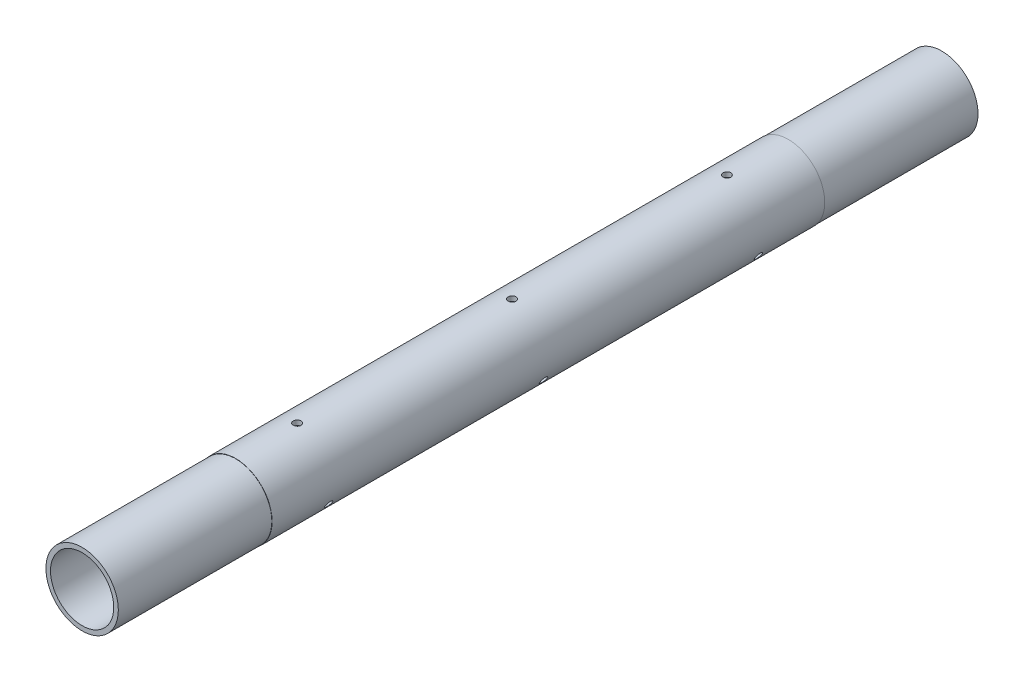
ISO-10303-21;
HEADER;
FILE_DESCRIPTION(('STEP AP214'),'2;1');
FILE_NAME('part.step','',(''),(''),'','','');
FILE_SCHEMA(('AUTOMOTIVE_DESIGN { 1 0 10303 214 1 1 1 1 }'));
ENDSEC;
DATA;
#1=APPLICATION_CONTEXT('core data for automotive mechanical design processes');
#2=APPLICATION_PROTOCOL_DEFINITION('international standard','automotive_design',2000,#1);
#3=PRODUCT_CONTEXT('',#1,'mechanical');
#4=PRODUCT('Part','Part','',(#3));
#5=PRODUCT_RELATED_PRODUCT_CATEGORY('part','',(#4));
#6=PRODUCT_DEFINITION_FORMATION('','',#4);
#7=PRODUCT_DEFINITION_CONTEXT('part definition',#1,'design');
#8=PRODUCT_DEFINITION('design','',#6,#7);
#9=PRODUCT_DEFINITION_SHAPE('','',#8);
#10=(LENGTH_UNIT() NAMED_UNIT(*) SI_UNIT(.MILLI.,.METRE.));
#11=(NAMED_UNIT(*) PLANE_ANGLE_UNIT() SI_UNIT($,.RADIAN.));
#12=(NAMED_UNIT(*) SI_UNIT($,.STERADIAN.) SOLID_ANGLE_UNIT());
#13=UNCERTAINTY_MEASURE_WITH_UNIT(LENGTH_MEASURE(1.E-05),#10,'distance_accuracy_value','');
#14=(GEOMETRIC_REPRESENTATION_CONTEXT(3) GLOBAL_UNCERTAINTY_ASSIGNED_CONTEXT((#13)) GLOBAL_UNIT_ASSIGNED_CONTEXT((#10,
#11,#12)) REPRESENTATION_CONTEXT('',''));
#15=CARTESIAN_POINT('',(0.,0.,0.));
#16=DIRECTION('',(0.,0.,1.));
#17=DIRECTION('',(1.,0.,0.));
#18=AXIS2_PLACEMENT_3D('',#15,#16,#17);
#19=CARTESIAN_POINT('',(0.,0.,228.6));
#20=DIRECTION('',(0.,0.,1.));
#21=DIRECTION('',(1.,0.,0.));
#22=AXIS2_PLACEMENT_3D('',#19,#20,#21);
#23=PLANE('',#22);
#24=CARTESIAN_POINT('',(0.,0.,228.6));
#25=DIRECTION('',(0.,0.,1.));
#26=DIRECTION('',(1.,0.,0.));
#27=AXIS2_PLACEMENT_3D('',#24,#25,#26);
#28=CIRCLE('',#27,30.1625);
#29=CARTESIAN_POINT('',(30.1625,0.,228.6));
#30=VERTEX_POINT('',#29);
#31=EDGE_CURVE('E39',#30,#30,#28,.T.);
#32=ORIENTED_EDGE('',*,*,#31,.T.);
#33=EDGE_LOOP('',(#32));
#34=FACE_BOUND('',#33,.T.);
#35=CARTESIAN_POINT('',(0.,0.,228.6));
#36=DIRECTION('',(0.,0.,1.));
#37=DIRECTION('',(1.,0.,0.));
#38=AXIS2_PLACEMENT_3D('',#35,#36,#37);
#39=CIRCLE('',#38,29.9466);
#40=CARTESIAN_POINT('',(29.9466,0.,228.6));
#41=VERTEX_POINT('',#40);
#42=EDGE_CURVE('E58',#41,#41,#39,.T.);
#43=ORIENTED_EDGE('',*,*,#42,.F.);
#44=EDGE_LOOP('',(#43));
#45=FACE_BOUND('',#44,.T.);
#46=ADVANCED_FACE('F32',(#34,#45),#23,.T.);
#47=CARTESIAN_POINT('',(0.,0.,-228.6));
#48=DIRECTION('',(0.,0.,1.));
#49=DIRECTION('',(1.,0.,0.));
#50=AXIS2_PLACEMENT_3D('',#47,#48,#49);
#51=PLANE('',#50);
#52=CARTESIAN_POINT('',(0.,0.,-228.6));
#53=DIRECTION('',(0.,0.,1.));
#54=DIRECTION('',(1.,0.,0.));
#55=AXIS2_PLACEMENT_3D('',#52,#53,#54);
#56=CIRCLE('',#55,30.1625);
#57=CARTESIAN_POINT('',(30.1625,0.,-228.6));
#58=VERTEX_POINT('',#57);
#59=EDGE_CURVE('E43',#58,#58,#56,.T.);
#60=ORIENTED_EDGE('',*,*,#59,.F.);
#61=EDGE_LOOP('',(#60));
#62=FACE_BOUND('',#61,.T.);
#63=CARTESIAN_POINT('',(0.,0.,-228.6));
#64=DIRECTION('',(0.,0.,1.));
#65=DIRECTION('',(1.,0.,0.));
#66=AXIS2_PLACEMENT_3D('',#63,#64,#65);
#67=CIRCLE('',#66,29.9466);
#68=CARTESIAN_POINT('',(29.9466,0.,-228.6));
#69=VERTEX_POINT('',#68);
#70=EDGE_CURVE('E10',#69,#69,#67,.F.);
#71=ORIENTED_EDGE('',*,*,#70,.F.);
#72=EDGE_LOOP('',(#71));
#73=FACE_BOUND('',#72,.T.);
#74=ADVANCED_FACE('F242',(#62,#73),#51,.F.);
#75=CARTESIAN_POINT('',(0.,0.,228.6));
#76=DIRECTION('',(0.,0.,-1.));
#77=DIRECTION('',(-1.,0.,0.));
#78=AXIS2_PLACEMENT_3D('',#75,#76,#77);
#79=CYLINDRICAL_SURFACE('',#78,30.1625);
#80=CARTESIAN_POINT('',(27.5742328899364,-12.2244871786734,-177.8));
#81=CARTESIAN_POINT('',(27.5742309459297,-12.2244949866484,-177.62077584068));
#82=CARTESIAN_POINT('',(27.5680862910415,-12.238381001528,-177.441434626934));
#83=CARTESIAN_POINT('',(27.5435516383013,-12.2934960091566,-177.087728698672));
#84=CARTESIAN_POINT('',(27.5251483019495,-12.3347547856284,-176.913369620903));
#85=CARTESIAN_POINT('',(27.4762944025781,-12.4431976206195,-176.574801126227));
#86=CARTESIAN_POINT('',(27.4458513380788,-12.5103655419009,-176.410585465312));
#87=CARTESIAN_POINT('',(27.3732709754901,-12.6683845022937,-176.096837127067));
#88=CARTESIAN_POINT('',(27.3311359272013,-12.7592309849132,-175.947301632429));
#89=CARTESIAN_POINT('',(27.235532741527,-12.9620499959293,-175.666514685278));
#90=CARTESIAN_POINT('',(27.1820240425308,-13.0740979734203,-175.535331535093));
#91=CARTESIAN_POINT('',(27.0645568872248,-13.3155606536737,-175.295561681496));
#92=CARTESIAN_POINT('',(27.0005979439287,-13.4449761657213,-175.186976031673));
#93=CARTESIAN_POINT('',(26.8631774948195,-13.7174854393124,-174.995245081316));
#94=CARTESIAN_POINT('',(26.7896938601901,-13.8606108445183,-174.912160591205));
#95=CARTESIAN_POINT('',(26.6348403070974,-14.1558981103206,-174.7741795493));
#96=CARTESIAN_POINT('',(26.5534706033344,-14.3080597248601,-174.719282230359));
#97=CARTESIAN_POINT('',(26.3850754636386,-14.6162547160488,-174.639435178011));
#98=CARTESIAN_POINT('',(26.2980726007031,-14.7722712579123,-174.614372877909));
#99=CARTESIAN_POINT('',(26.1204299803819,-15.0841553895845,-174.594558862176));
#100=CARTESIAN_POINT('',(26.0297903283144,-15.240022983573,-174.599806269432));
#101=CARTESIAN_POINT('',(25.8478782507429,-15.5465508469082,-174.640371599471));
#102=CARTESIAN_POINT('',(25.7566098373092,-15.6972295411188,-174.675568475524));
#103=CARTESIAN_POINT('',(25.5759269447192,-15.9899333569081,-174.774844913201));
#104=CARTESIAN_POINT('',(25.4865124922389,-16.1319583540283,-174.838924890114));
#105=CARTESIAN_POINT('',(25.3123341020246,-16.4039112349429,-174.994280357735));
#106=CARTESIAN_POINT('',(25.227579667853,-16.5338147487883,-175.085609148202));
#107=CARTESIAN_POINT('',(25.065880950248,-16.7779465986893,-175.292831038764));
#108=CARTESIAN_POINT('',(24.9889369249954,-16.8921744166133,-175.408724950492));
#109=CARTESIAN_POINT('',(24.8453312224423,-17.1026979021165,-175.662467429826));
#110=CARTESIAN_POINT('',(24.7787220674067,-17.198902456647,-175.800421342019));
#111=CARTESIAN_POINT('',(24.6588245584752,-17.3703701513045,-176.094003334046));
#112=CARTESIAN_POINT('',(24.6055362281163,-17.4456332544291,-176.249631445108));
#113=CARTESIAN_POINT('',(24.5144178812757,-17.5734434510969,-176.57422782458));
#114=CARTESIAN_POINT('',(24.4765917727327,-17.6259848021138,-176.743199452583));
#115=CARTESIAN_POINT('',(24.4180000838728,-17.7070664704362,-177.089644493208));
#116=CARTESIAN_POINT('',(24.397233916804,-17.7356076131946,-177.26711761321));
#117=CARTESIAN_POINT('',(24.373707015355,-17.7679266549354,-177.624603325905));
#118=CARTESIAN_POINT('',(24.3708591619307,-17.7718243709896,-177.804599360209));
#119=CARTESIAN_POINT('',(24.3830585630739,-17.7550827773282,-178.162832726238));
#120=CARTESIAN_POINT('',(24.3981055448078,-17.7344438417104,-178.341070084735));
#121=CARTESIAN_POINT('',(24.4453955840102,-17.6692003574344,-178.690294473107));
#122=CARTESIAN_POINT('',(24.4775976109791,-17.6246529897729,-178.861297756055));
#123=CARTESIAN_POINT('',(24.5578331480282,-17.5126797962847,-179.191705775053));
#124=CARTESIAN_POINT('',(24.6058670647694,-17.445253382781,-179.351110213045));
#125=CARTESIAN_POINT('',(24.7160435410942,-17.2888042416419,-179.654466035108));
#126=CARTESIAN_POINT('',(24.7782394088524,-17.1996998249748,-179.798355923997));
#127=CARTESIAN_POINT('',(24.9142100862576,-17.0021435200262,-180.065973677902));
#128=CARTESIAN_POINT('',(24.9879852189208,-16.8936910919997,-180.189700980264));
#129=CARTESIAN_POINT('',(25.1446755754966,-16.6595791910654,-180.413991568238));
#130=CARTESIAN_POINT('',(25.2276267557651,-16.5338515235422,-180.514458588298));
#131=CARTESIAN_POINT('',(25.399432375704,-16.2686866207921,-180.688713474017));
#132=CARTESIAN_POINT('',(25.4882867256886,-16.1292495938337,-180.762501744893));
#133=CARTESIAN_POINT('',(25.6686708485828,-15.8406005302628,-180.881142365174));
#134=CARTESIAN_POINT('',(25.760194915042,-15.691408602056,-180.926052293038));
#135=CARTESIAN_POINT('',(25.9431345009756,-15.3870622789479,-180.985849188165));
#136=CARTESIAN_POINT('',(26.0345500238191,-15.2319080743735,-181.000737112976));
#137=CARTESIAN_POINT('',(26.2140891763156,-14.9207920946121,-181.000052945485));
#138=CARTESIAN_POINT('',(26.3022267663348,-14.7648380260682,-180.984630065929));
#139=CARTESIAN_POINT('',(26.4732952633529,-14.4558720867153,-180.92407568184));
#140=CARTESIAN_POINT('',(26.5562261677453,-14.3028602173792,-180.878944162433));
#141=CARTESIAN_POINT('',(26.7148637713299,-14.0043226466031,-180.760296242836));
#142=CARTESIAN_POINT('',(26.7905717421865,-13.8587956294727,-180.686784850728));
#143=CARTESIAN_POINT('',(26.9331846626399,-13.5795647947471,-180.513479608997));
#144=CARTESIAN_POINT('',(27.0000896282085,-13.4458609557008,-180.41368580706));
#145=CARTESIAN_POINT('',(27.1241788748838,-13.1937558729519,-180.190090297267));
#146=CARTESIAN_POINT('',(27.1813157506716,-13.0754298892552,-180.066177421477));
#147=CARTESIAN_POINT('',(27.2846003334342,-12.8585171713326,-179.79808432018));
#148=CARTESIAN_POINT('',(27.3307454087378,-12.7599351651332,-179.653899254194));
#149=CARTESIAN_POINT('',(27.411521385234,-12.5854756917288,-179.348901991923));
#150=CARTESIAN_POINT('',(27.4461193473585,-12.509663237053,-179.188043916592));
#151=CARTESIAN_POINT('',(27.503180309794,-12.3837112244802,-178.854696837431));
#152=CARTESIAN_POINT('',(27.5256568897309,-12.3335429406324,-178.682221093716));
#153=CARTESIAN_POINT('',(27.552708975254,-12.2729494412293,-178.390655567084));
#154=CARTESIAN_POINT('',(27.5607754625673,-12.2548047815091,-178.273424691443));
#155=CARTESIAN_POINT('',(27.5715380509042,-12.2305710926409,-178.037479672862));
#156=CARTESIAN_POINT('',(27.5742341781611,-12.2244820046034,-177.91876553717));
#157=CARTESIAN_POINT('',(27.5742328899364,-12.2244871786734,-177.8));
#158=B_SPLINE_CURVE_WITH_KNOTS('',3,(#80,#81,#82,#83,#84,#85,#86,#87,#88,#89,#90,#91,#92,#93,
#94,#95,#96,#97,#98,#99,#100,#101,#102,#103,#104,#105,#106,#107,#108,#109,#110,#111,#112,#113,
#114,#115,#116,#117,#118,#119,#120,#121,#122,#123,#124,#125,#126,#127,#128,#129,#130,#131,#132,
#133,#134,#135,#136,#137,#138,#139,#140,#141,#142,#143,#144,#145,#146,#147,#148,#149,#150,#151,
#152,#153,#154,#155,#156,#157),.UNSPECIFIED.,.T.,.F.,(4,2,2,2,2,2,2,2,2,2,2,2,2,2,2,2,2,2,2,2,2,
2,2,2,2,2,2,2,2,2,2,2,2,2,2,2,2,2,4),(0.,0.537238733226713,1.07506298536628,1.6125527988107,
2.14993925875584,2.68927534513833,3.22863657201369,3.76927414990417,4.30989701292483,
4.84847358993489,5.38703458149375,5.9234291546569,6.45983144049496,6.99728990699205,
7.53476613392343,8.07489017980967,8.61501518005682,9.15527660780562,9.69551945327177,
10.2331335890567,10.7707395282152,11.3070653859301,11.8434050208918,12.3817979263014,
12.9202058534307,13.460803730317,14.0013933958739,14.540901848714,15.0803930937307,
15.6172352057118,16.1540775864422,16.6908252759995,17.2275719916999,17.7668538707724,
18.3062647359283,18.847201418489,19.3875308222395,19.7435417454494,20.099550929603),.UNSPECIFIED.);
#159=CARTESIAN_POINT('',(27.5742328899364,-12.2244871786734,-177.8));
#160=VERTEX_POINT('',#159);
#161=EDGE_CURVE('E225',#160,#160,#158,.T.);
#162=ORIENTED_EDGE('',*,*,#161,.F.);
#163=EDGE_LOOP('',(#162));
#164=FACE_BOUND('',#163,.T.);
#165=CARTESIAN_POINT('',(0.,30.1625,-174.5996));
#166=CARTESIAN_POINT('',(0.179227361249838,30.1624978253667,-174.599607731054));
#167=CARTESIAN_POINT('',(0.358571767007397,30.1608855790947,-174.614706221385));
#168=CARTESIAN_POINT('',(0.712284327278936,30.1546090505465,-174.67470680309));
#169=CARTESIAN_POINT('',(0.886646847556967,30.149941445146,-174.719641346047));
#170=CARTESIAN_POINT('',(1.22522262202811,30.1380808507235,-174.83798759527));
#171=CARTESIAN_POINT('',(1.38944209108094,30.1308894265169,-174.911381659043));
#172=CARTESIAN_POINT('',(1.70319681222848,30.1147843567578,-175.084528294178));
#173=CARTESIAN_POINT('',(1.8527348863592,30.1058710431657,-175.184275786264));
#174=CARTESIAN_POINT('',(2.13351892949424,30.0872797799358,-175.407728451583));
#175=CARTESIAN_POINT('',(2.26469741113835,30.0775992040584,-175.531518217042));
#176=CARTESIAN_POINT('',(2.50445825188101,30.0585860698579,-175.799360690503));
#177=CARTESIAN_POINT('',(2.61303954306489,30.0492535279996,-175.943414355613));
#178=CARTESIAN_POINT('',(2.80476592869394,30.0319665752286,-176.248121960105));
#179=CARTESIAN_POINT('',(2.88784941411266,30.0240155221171,-176.408814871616));
#180=CARTESIAN_POINT('',(3.02582836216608,30.0104249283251,-176.741969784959));
#181=CARTESIAN_POINT('',(3.08072460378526,30.0047853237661,-176.9144314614));
#182=CARTESIAN_POINT('',(3.16056941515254,29.9964802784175,-177.265536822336));
#183=CARTESIAN_POINT('',(3.18563045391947,29.9938036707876,-177.44415466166));
#184=CARTESIAN_POINT('',(3.20544121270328,29.9916931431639,-177.803079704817));
#185=CARTESIAN_POINT('',(3.20019182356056,29.9922591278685,-177.983386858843));
#186=CARTESIAN_POINT('',(3.15962334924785,29.9965596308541,-178.339795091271));
#187=CARTESIAN_POINT('',(3.12442730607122,30.0002811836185,-178.515910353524));
#188=CARTESIAN_POINT('',(3.02515617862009,30.0104532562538,-178.85972012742));
#189=CARTESIAN_POINT('',(2.96108066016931,30.0169038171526,-179.02741451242));
#190=CARTESIAN_POINT('',(2.80573443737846,30.0318219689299,-179.350009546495));
#191=CARTESIAN_POINT('',(2.71440939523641,30.0402935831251,-179.50488383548));
#192=CARTESIAN_POINT('',(2.50719551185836,30.058295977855,-179.79715382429));
#193=CARTESIAN_POINT('',(2.39130586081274,30.067826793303,-179.934548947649));
#194=CARTESIAN_POINT('',(2.13756641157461,30.0869314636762,-180.188675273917));
#195=CARTESIAN_POINT('',(1.99961039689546,30.096505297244,-180.305300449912));
#196=CARTESIAN_POINT('',(1.70602241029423,30.114572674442,-180.513753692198));
#197=CARTESIAN_POINT('',(1.55039041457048,30.1230662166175,-180.605581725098));
#198=CARTESIAN_POINT('',(1.22579296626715,30.1380193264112,-180.761830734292));
#199=CARTESIAN_POINT('',(1.0568247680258,30.1444784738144,-180.826246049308));
#200=CARTESIAN_POINT('',(0.710387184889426,30.1546308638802,-180.925761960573));
#201=CARTESIAN_POINT('',(0.532918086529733,30.1583241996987,-180.960863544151));
#202=CARTESIAN_POINT('',(0.175434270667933,30.1625168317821,-181.000620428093));
#203=CARTESIAN_POINT('',(-0.00456400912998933,30.1630314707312,-181.005421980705));
#204=CARTESIAN_POINT('',(-0.362802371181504,30.1608499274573,-180.984827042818));
#205=CARTESIAN_POINT('',(-0.541042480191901,30.158153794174,-180.959431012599));
#206=CARTESIAN_POINT('',(-0.890280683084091,30.1498634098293,-180.879283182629));
#207=CARTESIAN_POINT('',(-1.06129473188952,30.1442759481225,-180.824600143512));
#208=CARTESIAN_POINT('',(-1.39172301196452,30.130829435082,-180.68750139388));
#209=CARTESIAN_POINT('',(-1.55113695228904,30.1229703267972,-180.605084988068));
#210=CARTESIAN_POINT('',(-1.85449929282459,30.10582068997,-180.414498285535));
#211=CARTESIAN_POINT('',(-1.99838723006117,30.0965248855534,-180.306232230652));
#212=CARTESIAN_POINT('',(-2.26600037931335,30.0775610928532,-180.067156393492));
#213=CARTESIAN_POINT('',(-2.38972502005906,30.0678930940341,-179.936345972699));
#214=CARTESIAN_POINT('',(-2.61400979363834,30.0492281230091,-179.655255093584));
#215=CARTESIAN_POINT('',(-2.71447372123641,30.0402340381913,-179.504897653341));
#216=CARTESIAN_POINT('',(-2.88872318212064,30.0239800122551,-179.189359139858));
#217=CARTESIAN_POINT('',(-2.96250911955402,30.0167200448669,-179.024178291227));
#218=CARTESIAN_POINT('',(-3.08114821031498,30.0047746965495,-178.68400738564));
#219=CARTESIAN_POINT('',(-3.12605793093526,30.0000842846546,-178.509037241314));
#220=CARTESIAN_POINT('',(-3.18585301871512,29.9937937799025,-178.153987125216));
#221=CARTESIAN_POINT('',(-3.20073936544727,29.9921935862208,-177.973907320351));
#222=CARTESIAN_POINT('',(-3.20005056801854,29.9922670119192,-177.614706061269));
#223=CARTESIAN_POINT('',(-3.18462654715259,29.9939243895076,-177.435584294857));
#224=CARTESIAN_POINT('',(-3.12407241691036,30.0002915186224,-177.08249240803));
#225=CARTESIAN_POINT('',(-3.07894227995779,30.0050012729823,-176.908522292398));
#226=CARTESIAN_POINT('',(-2.96029998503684,30.0169378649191,-176.570677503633));
#227=CARTESIAN_POINT('',(-2.88679291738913,30.024164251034,-176.40680102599));
#228=CARTESIAN_POINT('',(-2.71349867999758,30.0403207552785,-176.0936869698));
#229=CARTESIAN_POINT('',(-2.6137115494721,30.0492508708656,-175.944449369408));
#230=CARTESIAN_POINT('',(-2.39012340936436,30.0678620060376,-175.664075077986));
#231=CARTESIAN_POINT('',(-2.26620970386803,30.0775464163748,-175.533028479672));
#232=CARTESIAN_POINT('',(-1.99811294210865,30.0965441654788,-175.293524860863));
#233=CARTESIAN_POINT('',(-1.85392505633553,30.1058574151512,-175.185073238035));
#234=CARTESIAN_POINT('',(-1.5489254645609,30.1230910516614,-174.993593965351));
#235=CARTESIAN_POINT('',(-1.38806838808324,30.1310074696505,-174.910638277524));
#236=CARTESIAN_POINT('',(-1.05472342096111,30.1445132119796,-174.773027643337));
#237=CARTESIAN_POINT('',(-0.882248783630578,30.1501051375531,-174.718341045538));
#238=CARTESIAN_POINT('',(-0.590679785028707,30.1569394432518,-174.65233585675));
#239=CARTESIAN_POINT('',(-0.473444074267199,30.1590148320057,-174.632587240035));
#240=CARTESIAN_POINT('',(-0.237489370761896,30.1617958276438,-174.606216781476));
#241=CARTESIAN_POINT('',(-0.118770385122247,30.1625014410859,-174.599594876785));
#242=CARTESIAN_POINT('',(0.,30.1625,-174.5996));
#243=B_SPLINE_CURVE_WITH_KNOTS('',3,(#165,#166,#167,#168,#169,#170,#171,#172,#173,#174,#175,
#176,#177,#178,#179,#180,#181,#182,#183,#184,#185,#186,#187,#188,#189,#190,#191,#192,#193,#194,
#195,#196,#197,#198,#199,#200,#201,#202,#203,#204,#205,#206,#207,#208,#209,#210,#211,#212,#213,
#214,#215,#216,#217,#218,#219,#220,#221,#222,#223,#224,#225,#226,#227,#228,#229,#230,#231,#232,
#233,#234,#235,#236,#237,#238,#239,#240,#241,#242),.UNSPECIFIED.,.T.,.F.,(4,2,2,2,2,2,2,2,2,2,2,
2,2,2,2,2,2,2,2,2,2,2,2,2,2,2,2,2,2,2,2,2,2,2,2,2,2,2,4),(0.,0.537248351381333,1.07508200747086,
1.6125827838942,2.14998003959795,2.68930353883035,3.22865252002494,3.76929462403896,
4.30992178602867,4.84850444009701,5.38707126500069,5.92343590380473,6.45980860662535,
6.99725811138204,7.53472533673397,8.07486215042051,8.61499969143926,9.15524872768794,
9.69547956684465,10.2331008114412,10.7707138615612,11.3070701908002,11.843439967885,
12.3818283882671,12.9202320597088,13.4608242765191,14.0014083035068,14.5409300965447,
15.080434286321,15.6172554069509,16.1540770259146,16.6908023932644,17.2275269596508,
17.7668214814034,18.3062446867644,18.8471767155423,19.3875017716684,19.7435272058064,
20.0995509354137),.UNSPECIFIED.);
#244=CARTESIAN_POINT('',(0.,30.1625,-174.5996));
#245=VERTEX_POINT('',#244);
#246=EDGE_CURVE('E206',#245,#245,#243,.T.);
#247=ORIENTED_EDGE('',*,*,#246,.F.);
#248=EDGE_LOOP('',(#247));
#249=FACE_BOUND('',#248,.T.);
#250=CARTESIAN_POINT('',(-24.3738328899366,-17.7677425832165,-177.8));
#251=CARTESIAN_POINT('',(-24.3738386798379,-17.7677369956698,-177.62077584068));
#252=CARTESIAN_POINT('',(-24.3827919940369,-17.7554725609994,-177.441434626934));
#253=CARTESIAN_POINT('',(-24.418255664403,-17.706667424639,-177.087728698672));
#254=CARTESIAN_POINT('',(-24.4447851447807,-17.670100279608,-176.913369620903));
#255=CARTESIAN_POINT('',(-24.5142724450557,-17.5735701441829,-176.574801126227));
#256=CARTESIAN_POINT('',(-24.5572200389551,-17.5136217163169,-176.410585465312));
#257=CARTESIAN_POINT('',(-24.6577782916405,-17.3717557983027,-176.096837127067));
#258=CARTESIAN_POINT('',(-24.7153861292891,-17.2898425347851,-175.947301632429));
#259=CARTESIAN_POINT('',(-24.8432309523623,-17.1056382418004,-175.666514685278));
#260=CARTESIAN_POINT('',(-24.9135129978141,-17.0032743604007,-175.535331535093));
#261=CARTESIAN_POINT('',(-25.0638922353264,-16.7808134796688,-175.295561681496));
#262=CARTESIAN_POINT('',(-25.1439898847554,-16.6607156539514,-175.186976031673));
#263=CARTESIAN_POINT('',(-25.3112796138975,-16.4054514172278,-174.995245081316));
#264=CARTESIAN_POINT('',(-25.3984880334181,-16.2702500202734,-174.912160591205));
#265=CARTESIAN_POINT('',(-25.5767875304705,-15.9884992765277,-174.7741795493));
#266=CARTESIAN_POINT('',(-25.6678785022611,-15.8419502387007,-174.719282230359));
#267=CARTESIAN_POINT('',(-25.8505856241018,-15.542018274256,-174.639435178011));
#268=CARTESIAN_POINT('',(-25.9421984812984,-15.3886633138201,-174.614372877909));
#269=CARTESIAN_POINT('',(-26.1234767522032,-15.078878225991,-174.594558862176));
#270=CARTESIAN_POINT('',(-26.2131422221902,-14.9224481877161,-174.599806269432));
#271=CARTESIAN_POINT('',(-26.3876471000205,-14.6116437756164,-174.640371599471));
#272=CARTESIAN_POINT('',(-26.4725044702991,-14.4572636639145,-174.675568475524));
#273=CARTESIAN_POINT('',(-26.6356519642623,-14.1544357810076,-174.774844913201));
#274=CARTESIAN_POINT('',(-26.7139419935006,-14.005988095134,-174.838924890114));
#275=CARTESIAN_POINT('',(-26.8623709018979,-13.7191687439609,-174.994280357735));
#276=CARTESIAN_POINT('',(-26.9324934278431,-13.5808174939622,-175.085609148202));
#277=CARTESIAN_POINT('',(-27.0630684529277,-13.3187163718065,-175.292831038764));
#278=CARTESIAN_POINT('',(-27.1235206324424,-13.1949669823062,-175.408724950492));
#279=CARTESIAN_POINT('',(-27.2340364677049,-12.9653390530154,-175.662467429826));
#280=CARTESIAN_POINT('',(-27.2840474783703,-12.8595515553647,-175.800421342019));
#281=CARTESIAN_POINT('',(-27.3725941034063,-12.6699834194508,-176.094003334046));
#282=CARTESIAN_POINT('',(-27.4111296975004,-12.5862028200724,-176.249631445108));
#283=CARTESIAN_POINT('',(-27.4762574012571,-12.4433869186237,-176.57422782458));
#284=CARTESIAN_POINT('',(-27.5028464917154,-12.3843578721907,-176.743199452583));
#285=CARTESIAN_POINT('',(-27.5437694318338,-12.2930751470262,-177.089644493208));
#286=CARTESIAN_POINT('',(-27.5581037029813,-12.2608205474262,-177.26711761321));
#287=CARTESIAN_POINT('',(-27.5743293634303,-12.2242861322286,-177.624603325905));
#288=CARTESIAN_POINT('',(-27.5762809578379,-12.2198709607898,-177.804599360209));
#289=CARTESIAN_POINT('',(-27.5678820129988,-12.2388067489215,-178.162832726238));
#290=CARTESIAN_POINT('',(-27.5575316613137,-12.2621572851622,-178.341070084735));
#291=CARTESIAN_POINT('',(-27.5246741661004,-12.3357334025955,-178.690294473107));
#292=CARTESIAN_POINT('',(-27.5021960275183,-12.3858948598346,-178.861297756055));
#293=CARTESIAN_POINT('',(-27.4453421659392,-12.5113674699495,-179.191705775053));
#294=CARTESIAN_POINT('',(-27.4109661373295,-12.5866792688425,-179.351110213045));
#295=CARTESIAN_POINT('',(-27.3305654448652,-12.7603194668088,-179.654466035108));
#296=CARTESIAN_POINT('',(-27.2844966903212,-12.8587348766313,-179.798355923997));
#297=CARTESIAN_POINT('',(-27.1813932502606,-13.0752670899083,-180.065973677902));
#298=CARTESIAN_POINT('',(-27.1243582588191,-13.1933844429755,-180.189700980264));
#299=CARTESIAN_POINT('',(-26.9999565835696,-13.4461382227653,-180.413991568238));
#300=CARTESIAN_POINT('',(-26.9325488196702,-13.5808398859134,-180.514458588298));
#301=CARTESIAN_POINT('',(-26.7888120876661,-13.8622103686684,-180.688713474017));
#302=CARTESIAN_POINT('',(-26.7124832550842,-14.0088790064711,-180.762501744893));
#303=CARTESIAN_POINT('',(-26.5526978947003,-14.3094207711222,-180.881142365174));
#304=CARTESIAN_POINT('',(-26.4692559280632,-14.4632789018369,-180.926052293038));
#305=CARTESIAN_POINT('',(-26.2971540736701,-14.7738823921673,-180.985849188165));
#306=CARTESIAN_POINT('',(-26.2084943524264,-14.9306276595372,-181.000737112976));
#307=CARTESIAN_POINT('',(-26.0288295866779,-15.2416711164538,-181.000052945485));
#308=CARTESIAN_POINT('',(-25.937838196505,-15.3959775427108,-180.984630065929));
#309=CARTESIAN_POINT('',(-25.7558000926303,-15.6986101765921,-180.92407568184));
#310=CARTESIAN_POINT('',(-25.6647533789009,-15.8469363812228,-180.878944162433));
#311=CARTESIAN_POINT('',(-25.4855310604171,-16.1335893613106,-180.760296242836));
#312=CARTESIAN_POINT('',(-25.3973549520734,-16.2719178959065,-180.686784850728));
#313=CARTESIAN_POINT('',(-25.2268404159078,-16.5350397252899,-180.513479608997));
#314=CARTESIAN_POINT('',(-25.1445019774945,-16.6598330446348,-180.41368580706));
#315=CARTESIAN_POINT('',(-24.9882171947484,-16.8933500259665,-180.190090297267));
#316=CARTESIAN_POINT('',(-24.9143123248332,-17.00199500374,-180.066177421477));
#317=CARTESIAN_POINT('',(-24.7781026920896,-17.1998984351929,-179.79808432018));
#318=CARTESIAN_POINT('',(-24.7158007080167,-17.2891522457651,-179.653899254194));
#319=CARTESIAN_POINT('',(-24.6051023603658,-17.4463360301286,-179.348901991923));
#320=CARTESIAN_POINT('',(-24.5567458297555,-17.5142049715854,-179.188043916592));
#321=CARTESIAN_POINT('',(-24.4761986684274,-17.6265972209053,-178.854696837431));
#322=CARTESIAN_POINT('',(-24.4439899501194,-17.6711466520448,-178.682221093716));
#323=CARTESIAN_POINT('',(-24.4050404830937,-17.7248711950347,-178.390655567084));
#324=CARTESIAN_POINT('',(-24.3933599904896,-17.7409293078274,-178.273424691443));
#325=CARTESIAN_POINT('',(-24.3777542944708,-17.7623668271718,-178.037479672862));
#326=CARTESIAN_POINT('',(-24.3738290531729,-17.7677462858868,-177.91876553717));
#327=CARTESIAN_POINT('',(-24.3738328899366,-17.7677425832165,-177.8));
#328=B_SPLINE_CURVE_WITH_KNOTS('',3,(#250,#251,#252,#253,#254,#255,#256,#257,#258,#259,#260,
#261,#262,#263,#264,#265,#266,#267,#268,#269,#270,#271,#272,#273,#274,#275,#276,#277,#278,#279,
#280,#281,#282,#283,#284,#285,#286,#287,#288,#289,#290,#291,#292,#293,#294,#295,#296,#297,#298,
#299,#300,#301,#302,#303,#304,#305,#306,#307,#308,#309,#310,#311,#312,#313,#314,#315,#316,#317,
#318,#319,#320,#321,#322,#323,#324,#325,#326,#327),.UNSPECIFIED.,.T.,.F.,(4,2,2,2,2,2,2,2,2,2,2,
2,2,2,2,2,2,2,2,2,2,2,2,2,2,2,2,2,2,2,2,2,2,2,2,2,2,2,4),(0.,0.537238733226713,1.07506298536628,
1.61255279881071,2.14993925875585,2.68927534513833,3.22863657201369,3.76927414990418,
4.30989701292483,4.84847358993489,5.38703458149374,5.92342915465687,6.45983144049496,
6.99728990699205,7.53476613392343,8.07489017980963,8.61501518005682,9.15527660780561,
9.69551945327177,10.2331335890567,10.7707395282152,11.3070653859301,11.8434050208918,
12.3817979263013,12.9202058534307,13.460803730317,14.0013933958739,14.540901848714,
15.0803930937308,15.6172352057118,16.1540775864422,16.6908252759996,17.2275719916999,
17.7668538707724,18.3062647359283,18.847201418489,19.3875308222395,19.7435417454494,
20.099550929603),.UNSPECIFIED.);
#329=CARTESIAN_POINT('',(-24.3738328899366,-17.7677425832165,-177.8));
#330=VERTEX_POINT('',#329);
#331=EDGE_CURVE('E187',#330,#330,#328,.T.);
#332=ORIENTED_EDGE('',*,*,#331,.F.);
#333=EDGE_LOOP('',(#332));
#334=FACE_BOUND('',#333,.T.);
#335=CARTESIAN_POINT('',(27.5742328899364,-12.2244871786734,177.8));
#336=CARTESIAN_POINT('',(27.5742309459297,-12.2244949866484,177.97922415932));
#337=CARTESIAN_POINT('',(27.5680862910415,-12.238381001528,178.158565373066));
#338=CARTESIAN_POINT('',(27.5435516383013,-12.2934960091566,178.512271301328));
#339=CARTESIAN_POINT('',(27.5251483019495,-12.3347547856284,178.686630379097));
#340=CARTESIAN_POINT('',(27.4762944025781,-12.4431976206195,179.025198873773));
#341=CARTESIAN_POINT('',(27.4458513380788,-12.5103655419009,179.189414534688));
#342=CARTESIAN_POINT('',(27.3732709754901,-12.6683845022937,179.503162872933));
#343=CARTESIAN_POINT('',(27.3311359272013,-12.7592309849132,179.652698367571));
#344=CARTESIAN_POINT('',(27.235532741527,-12.9620499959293,179.933485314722));
#345=CARTESIAN_POINT('',(27.1820240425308,-13.0740979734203,180.064668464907));
#346=CARTESIAN_POINT('',(27.0645568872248,-13.3155606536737,180.304438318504));
#347=CARTESIAN_POINT('',(27.0005979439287,-13.4449761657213,180.413023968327));
#348=CARTESIAN_POINT('',(26.8631774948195,-13.7174854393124,180.604754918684));
#349=CARTESIAN_POINT('',(26.7896938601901,-13.8606108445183,180.687839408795));
#350=CARTESIAN_POINT('',(26.6348403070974,-14.1558981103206,180.8258204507));
#351=CARTESIAN_POINT('',(26.5534706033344,-14.3080597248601,180.880717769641));
#352=CARTESIAN_POINT('',(26.3850754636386,-14.6162547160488,180.960564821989));
#353=CARTESIAN_POINT('',(26.2980726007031,-14.7722712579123,180.985627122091));
#354=CARTESIAN_POINT('',(26.1204299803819,-15.0841553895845,181.005441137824));
#355=CARTESIAN_POINT('',(26.0297903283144,-15.240022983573,181.000193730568));
#356=CARTESIAN_POINT('',(25.8478782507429,-15.5465508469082,180.959628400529));
#357=CARTESIAN_POINT('',(25.7566098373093,-15.6972295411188,180.924431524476));
#358=CARTESIAN_POINT('',(25.5759269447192,-15.9899333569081,180.825155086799));
#359=CARTESIAN_POINT('',(25.4865124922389,-16.1319583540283,180.761075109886));
#360=CARTESIAN_POINT('',(25.3123341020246,-16.4039112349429,180.605719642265));
#361=CARTESIAN_POINT('',(25.227579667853,-16.5338147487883,180.514390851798));
#362=CARTESIAN_POINT('',(25.065880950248,-16.7779465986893,180.307168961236));
#363=CARTESIAN_POINT('',(24.9889369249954,-16.8921744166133,180.191275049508));
#364=CARTESIAN_POINT('',(24.8453312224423,-17.1026979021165,179.937532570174));
#365=CARTESIAN_POINT('',(24.7787220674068,-17.198902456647,179.799578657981));
#366=CARTESIAN_POINT('',(24.6588245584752,-17.3703701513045,179.505996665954));
#367=CARTESIAN_POINT('',(24.6055362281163,-17.4456332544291,179.350368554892));
#368=CARTESIAN_POINT('',(24.5144178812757,-17.5734434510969,179.02577217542));
#369=CARTESIAN_POINT('',(24.4765917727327,-17.6259848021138,178.856800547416));
#370=CARTESIAN_POINT('',(24.4180000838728,-17.7070664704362,178.510355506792));
#371=CARTESIAN_POINT('',(24.397233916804,-17.7356076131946,178.33288238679));
#372=CARTESIAN_POINT('',(24.373707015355,-17.7679266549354,177.975396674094));
#373=CARTESIAN_POINT('',(24.3708591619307,-17.7718243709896,177.795400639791));
#374=CARTESIAN_POINT('',(24.3830585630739,-17.7550827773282,177.437167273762));
#375=CARTESIAN_POINT('',(24.3981055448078,-17.7344438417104,177.258929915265));
#376=CARTESIAN_POINT('',(24.4453955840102,-17.6692003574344,176.909705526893));
#377=CARTESIAN_POINT('',(24.4775976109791,-17.6246529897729,176.738702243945));
#378=CARTESIAN_POINT('',(24.5578331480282,-17.5126797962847,176.408294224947));
#379=CARTESIAN_POINT('',(24.6058670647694,-17.445253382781,176.248889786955));
#380=CARTESIAN_POINT('',(24.7160435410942,-17.2888042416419,175.945533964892));
#381=CARTESIAN_POINT('',(24.7782394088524,-17.1996998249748,175.801644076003));
#382=CARTESIAN_POINT('',(24.9142100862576,-17.0021435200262,175.534026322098));
#383=CARTESIAN_POINT('',(24.9879852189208,-16.8936910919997,175.410299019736));
#384=CARTESIAN_POINT('',(25.1446755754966,-16.6595791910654,175.186008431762));
#385=CARTESIAN_POINT('',(25.2276267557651,-16.5338515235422,175.085541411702));
#386=CARTESIAN_POINT('',(25.399432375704,-16.2686866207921,174.911286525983));
#387=CARTESIAN_POINT('',(25.4882867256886,-16.1292495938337,174.837498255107));
#388=CARTESIAN_POINT('',(25.6686708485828,-15.8406005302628,174.718857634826));
#389=CARTESIAN_POINT('',(25.760194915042,-15.691408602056,174.673947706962));
#390=CARTESIAN_POINT('',(25.9431345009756,-15.3870622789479,174.614150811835));
#391=CARTESIAN_POINT('',(26.0345500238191,-15.2319080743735,174.599262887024));
#392=CARTESIAN_POINT('',(26.2140891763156,-14.9207920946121,174.599947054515));
#393=CARTESIAN_POINT('',(26.3022267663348,-14.7648380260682,174.615369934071));
#394=CARTESIAN_POINT('',(26.4732952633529,-14.4558720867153,174.67592431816));
#395=CARTESIAN_POINT('',(26.5562261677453,-14.3028602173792,174.721055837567));
#396=CARTESIAN_POINT('',(26.7148637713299,-14.0043226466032,174.839703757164));
#397=CARTESIAN_POINT('',(26.7905717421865,-13.8587956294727,174.913215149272));
#398=CARTESIAN_POINT('',(26.9331846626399,-13.5795647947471,175.086520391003));
#399=CARTESIAN_POINT('',(27.0000896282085,-13.4458609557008,175.18631419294));
#400=CARTESIAN_POINT('',(27.1241788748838,-13.1937558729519,175.409909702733));
#401=CARTESIAN_POINT('',(27.1813157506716,-13.0754298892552,175.533822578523));
#402=CARTESIAN_POINT('',(27.2846003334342,-12.8585171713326,175.80191567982));
#403=CARTESIAN_POINT('',(27.3307454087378,-12.7599351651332,175.946100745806));
#404=CARTESIAN_POINT('',(27.411521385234,-12.5854756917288,176.251098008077));
#405=CARTESIAN_POINT('',(27.4461193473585,-12.509663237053,176.411956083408));
#406=CARTESIAN_POINT('',(27.503180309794,-12.3837112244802,176.745303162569));
#407=CARTESIAN_POINT('',(27.5256568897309,-12.3335429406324,176.917778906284));
#408=CARTESIAN_POINT('',(27.552708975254,-12.2729494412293,177.209344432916));
#409=CARTESIAN_POINT('',(27.5607754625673,-12.2548047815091,177.326575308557));
#410=CARTESIAN_POINT('',(27.5715380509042,-12.2305710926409,177.562520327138));
#411=CARTESIAN_POINT('',(27.5742341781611,-12.2244820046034,177.68123446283));
#412=CARTESIAN_POINT('',(27.5742328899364,-12.2244871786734,177.8));
#413=B_SPLINE_CURVE_WITH_KNOTS('',3,(#335,#336,#337,#338,#339,#340,#341,#342,#343,#344,#345,
#346,#347,#348,#349,#350,#351,#352,#353,#354,#355,#356,#357,#358,#359,#360,#361,#362,#363,#364,
#365,#366,#367,#368,#369,#370,#371,#372,#373,#374,#375,#376,#377,#378,#379,#380,#381,#382,#383,
#384,#385,#386,#387,#388,#389,#390,#391,#392,#393,#394,#395,#396,#397,#398,#399,#400,#401,#402,
#403,#404,#405,#406,#407,#408,#409,#410,#411,#412),.UNSPECIFIED.,.T.,.F.,(4,2,2,2,2,2,2,2,2,2,2,
2,2,2,2,2,2,2,2,2,2,2,2,2,2,2,2,2,2,2,2,2,2,2,2,2,2,2,4),(0.,0.537238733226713,1.07506298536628,
1.6125527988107,2.14993925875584,2.68927534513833,3.22863657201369,3.76927414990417,
4.30989701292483,4.84847358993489,5.38703458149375,5.92342915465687,6.45983144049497,
6.99728990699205,7.53476613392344,8.07489017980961,8.61501518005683,9.15527660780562,
9.69551945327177,10.2331335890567,10.7707395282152,11.3070653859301,11.8434050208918,
12.3817979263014,12.9202058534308,13.460803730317,14.0013933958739,14.540901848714,
15.0803930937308,15.6172352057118,16.1540775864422,16.6908252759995,17.2275719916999,
17.7668538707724,18.3062647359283,18.847201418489,19.3875308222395,19.7435417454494,
20.099550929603),.UNSPECIFIED.);
#414=CARTESIAN_POINT('',(27.5742328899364,-12.2244871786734,177.8));
#415=VERTEX_POINT('',#414);
#416=EDGE_CURVE('E168',#415,#415,#413,.T.);
#417=ORIENTED_EDGE('',*,*,#416,.F.);
#418=EDGE_LOOP('',(#417));
#419=FACE_BOUND('',#418,.T.);
#420=CARTESIAN_POINT('',(0.,30.1625,181.0004));
#421=CARTESIAN_POINT('',(0.179227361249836,30.1624978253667,181.000392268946));
#422=CARTESIAN_POINT('',(0.358571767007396,30.1608855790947,180.985293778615));
#423=CARTESIAN_POINT('',(0.712284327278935,30.1546090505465,180.92529319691));
#424=CARTESIAN_POINT('',(0.886646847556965,30.149941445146,180.880358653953));
#425=CARTESIAN_POINT('',(1.22522262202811,30.1380808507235,180.76201240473));
#426=CARTESIAN_POINT('',(1.38944209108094,30.1308894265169,180.688618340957));
#427=CARTESIAN_POINT('',(1.70319681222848,30.1147843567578,180.515471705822));
#428=CARTESIAN_POINT('',(1.8527348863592,30.1058710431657,180.415724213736));
#429=CARTESIAN_POINT('',(2.13351892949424,30.0872797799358,180.192271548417));
#430=CARTESIAN_POINT('',(2.26469741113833,30.0775992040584,180.068481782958));
#431=CARTESIAN_POINT('',(2.50445825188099,30.0585860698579,179.800639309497));
#432=CARTESIAN_POINT('',(2.61303954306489,30.0492535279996,179.656585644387));
#433=CARTESIAN_POINT('',(2.80476592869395,30.0319665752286,179.351878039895));
#434=CARTESIAN_POINT('',(2.88784941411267,30.0240155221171,179.191185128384));
#435=CARTESIAN_POINT('',(3.02582836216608,30.0104249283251,178.858030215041));
#436=CARTESIAN_POINT('',(3.08072460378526,30.0047853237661,178.685568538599));
#437=CARTESIAN_POINT('',(3.16056941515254,29.9964802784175,178.334463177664));
#438=CARTESIAN_POINT('',(3.18563045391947,29.9938036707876,178.15584533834));
#439=CARTESIAN_POINT('',(3.20544121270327,29.9916931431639,177.796920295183));
#440=CARTESIAN_POINT('',(3.20019182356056,29.9922591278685,177.616613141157));
#441=CARTESIAN_POINT('',(3.15962334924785,29.9965596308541,177.260204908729));
#442=CARTESIAN_POINT('',(3.12442730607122,30.0002811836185,177.084089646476));
#443=CARTESIAN_POINT('',(3.02515617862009,30.0104532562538,176.74027987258));
#444=CARTESIAN_POINT('',(2.96108066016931,30.0169038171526,176.57258548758));
#445=CARTESIAN_POINT('',(2.80573443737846,30.0318219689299,176.249990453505));
#446=CARTESIAN_POINT('',(2.71440939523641,30.0402935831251,176.09511616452));
#447=CARTESIAN_POINT('',(2.50719551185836,30.058295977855,175.80284617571));
#448=CARTESIAN_POINT('',(2.39130586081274,30.067826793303,175.665451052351));
#449=CARTESIAN_POINT('',(2.13756641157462,30.0869314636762,175.411324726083));
#450=CARTESIAN_POINT('',(1.99961039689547,30.096505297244,175.294699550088));
#451=CARTESIAN_POINT('',(1.70602241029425,30.114572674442,175.086246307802));
#452=CARTESIAN_POINT('',(1.55039041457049,30.1230662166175,174.994418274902));
#453=CARTESIAN_POINT('',(1.22579296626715,30.1380193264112,174.838169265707));
#454=CARTESIAN_POINT('',(1.0568247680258,30.1444784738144,174.773753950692));
#455=CARTESIAN_POINT('',(0.71038718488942,30.1546308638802,174.674238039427));
#456=CARTESIAN_POINT('',(0.532918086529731,30.1583241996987,174.639136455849));
#457=CARTESIAN_POINT('',(0.175434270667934,30.1625168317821,174.599379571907));
#458=CARTESIAN_POINT('',(-0.0045640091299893,30.1630314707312,174.594578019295));
#459=CARTESIAN_POINT('',(-0.362802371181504,30.1608499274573,174.615172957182));
#460=CARTESIAN_POINT('',(-0.541042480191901,30.158153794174,174.640568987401));
#461=CARTESIAN_POINT('',(-0.890280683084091,30.1498634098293,174.720716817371));
#462=CARTESIAN_POINT('',(-1.06129473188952,30.1442759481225,174.775399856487));
#463=CARTESIAN_POINT('',(-1.39172301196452,30.130829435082,174.91249860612));
#464=CARTESIAN_POINT('',(-1.55113695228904,30.1229703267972,174.994915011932));
#465=CARTESIAN_POINT('',(-1.8544992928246,30.10582068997,175.185501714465));
#466=CARTESIAN_POINT('',(-1.99838723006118,30.0965248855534,175.293767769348));
#467=CARTESIAN_POINT('',(-2.26600037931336,30.0775610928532,175.532843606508));
#468=CARTESIAN_POINT('',(-2.38972502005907,30.0678930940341,175.663654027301));
#469=CARTESIAN_POINT('',(-2.61400979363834,30.0492281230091,175.944744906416));
#470=CARTESIAN_POINT('',(-2.71447372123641,30.0402340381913,176.095102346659));
#471=CARTESIAN_POINT('',(-2.88872318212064,30.0239800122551,176.410640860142));
#472=CARTESIAN_POINT('',(-2.96250911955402,30.0167200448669,176.575821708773));
#473=CARTESIAN_POINT('',(-3.08114821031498,30.0047746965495,176.91599261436));
#474=CARTESIAN_POINT('',(-3.12605793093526,30.0000842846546,177.090962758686));
#475=CARTESIAN_POINT('',(-3.18585301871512,29.9937937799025,177.446012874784));
#476=CARTESIAN_POINT('',(-3.20073936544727,29.9921935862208,177.626092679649));
#477=CARTESIAN_POINT('',(-3.20005056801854,29.9922670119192,177.985293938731));
#478=CARTESIAN_POINT('',(-3.18462654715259,29.9939243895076,178.164415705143));
#479=CARTESIAN_POINT('',(-3.12407241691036,30.0002915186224,178.51750759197));
#480=CARTESIAN_POINT('',(-3.07894227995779,30.0050012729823,178.691477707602));
#481=CARTESIAN_POINT('',(-2.96029998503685,30.0169378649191,179.029322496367));
#482=CARTESIAN_POINT('',(-2.88679291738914,30.024164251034,179.19319897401));
#483=CARTESIAN_POINT('',(-2.7134986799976,30.0403207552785,179.5063130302));
#484=CARTESIAN_POINT('',(-2.61371154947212,30.0492508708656,179.655550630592));
#485=CARTESIAN_POINT('',(-2.39012340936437,30.0678620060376,179.935924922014));
#486=CARTESIAN_POINT('',(-2.26620970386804,30.0775464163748,180.066971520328));
#487=CARTESIAN_POINT('',(-1.99811294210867,30.0965441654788,180.306475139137));
#488=CARTESIAN_POINT('',(-1.85392505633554,30.1058574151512,180.414926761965));
#489=CARTESIAN_POINT('',(-1.5489254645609,30.1230910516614,180.606406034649));
#490=CARTESIAN_POINT('',(-1.38806838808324,30.1310074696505,180.689361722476));
#491=CARTESIAN_POINT('',(-1.05472342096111,30.1445132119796,180.826972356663));
#492=CARTESIAN_POINT('',(-0.882248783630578,30.1501051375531,180.881658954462));
#493=CARTESIAN_POINT('',(-0.590679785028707,30.1569394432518,180.94766414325));
#494=CARTESIAN_POINT('',(-0.473444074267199,30.1590148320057,180.967412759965));
#495=CARTESIAN_POINT('',(-0.237489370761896,30.1617958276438,180.993783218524));
#496=CARTESIAN_POINT('',(-0.118770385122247,30.1625014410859,181.000405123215));
#497=CARTESIAN_POINT('',(0.,30.1625,181.0004));
#498=B_SPLINE_CURVE_WITH_KNOTS('',3,(#420,#421,#422,#423,#424,#425,#426,#427,#428,#429,#430,
#431,#432,#433,#434,#435,#436,#437,#438,#439,#440,#441,#442,#443,#444,#445,#446,#447,#448,#449,
#450,#451,#452,#453,#454,#455,#456,#457,#458,#459,#460,#461,#462,#463,#464,#465,#466,#467,#468,
#469,#470,#471,#472,#473,#474,#475,#476,#477,#478,#479,#480,#481,#482,#483,#484,#485,#486,#487,
#488,#489,#490,#491,#492,#493,#494,#495,#496,#497),.UNSPECIFIED.,.T.,.F.,(4,2,2,2,2,2,2,2,2,2,2,
2,2,2,2,2,2,2,2,2,2,2,2,2,2,2,2,2,2,2,2,2,2,2,2,2,2,2,4),(0.,0.537248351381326,1.07508200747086,
1.6125827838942,2.14998003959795,2.68930353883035,3.22865252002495,3.76929462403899,
4.30992178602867,4.84850444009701,5.38707126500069,5.92343590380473,6.45980860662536,
6.99725811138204,7.53472533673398,8.07486215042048,8.61499969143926,9.15524872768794,
9.69547956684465,10.2331008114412,10.7707138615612,11.3070701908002,11.843439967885,
12.3818283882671,12.9202320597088,13.4608242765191,14.0014083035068,14.5409300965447,
15.080434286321,15.6172554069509,16.1540770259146,16.6908023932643,17.2275269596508,
17.7668214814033,18.3062446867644,18.8471767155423,19.3875017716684,19.7435272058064,
20.0995509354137),.UNSPECIFIED.);
#499=CARTESIAN_POINT('',(0.,30.1625,181.0004));
#500=VERTEX_POINT('',#499);
#501=EDGE_CURVE('E149',#500,#500,#498,.T.);
#502=ORIENTED_EDGE('',*,*,#501,.F.);
#503=EDGE_LOOP('',(#502));
#504=FACE_BOUND('',#503,.T.);
#505=CARTESIAN_POINT('',(-24.3738328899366,-17.7677425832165,177.8));
#506=CARTESIAN_POINT('',(-24.3738386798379,-17.7677369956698,177.97922415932));
#507=CARTESIAN_POINT('',(-24.3827919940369,-17.7554725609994,178.158565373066));
#508=CARTESIAN_POINT('',(-24.418255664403,-17.706667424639,178.512271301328));
#509=CARTESIAN_POINT('',(-24.4447851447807,-17.670100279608,178.686630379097));
#510=CARTESIAN_POINT('',(-24.5142724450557,-17.5735701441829,179.025198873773));
#511=CARTESIAN_POINT('',(-24.5572200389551,-17.5136217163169,179.189414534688));
#512=CARTESIAN_POINT('',(-24.6577782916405,-17.3717557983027,179.503162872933));
#513=CARTESIAN_POINT('',(-24.7153861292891,-17.2898425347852,179.652698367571));
#514=CARTESIAN_POINT('',(-24.8432309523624,-17.1056382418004,179.933485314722));
#515=CARTESIAN_POINT('',(-24.9135129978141,-17.0032743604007,180.064668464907));
#516=CARTESIAN_POINT('',(-25.0638922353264,-16.7808134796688,180.304438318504));
#517=CARTESIAN_POINT('',(-25.1439898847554,-16.6607156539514,180.413023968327));
#518=CARTESIAN_POINT('',(-25.3112796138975,-16.4054514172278,180.604754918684));
#519=CARTESIAN_POINT('',(-25.3984880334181,-16.2702500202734,180.687839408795));
#520=CARTESIAN_POINT('',(-25.5767875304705,-15.9884992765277,180.8258204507));
#521=CARTESIAN_POINT('',(-25.6678785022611,-15.8419502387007,180.880717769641));
#522=CARTESIAN_POINT('',(-25.8505856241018,-15.542018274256,180.960564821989));
#523=CARTESIAN_POINT('',(-25.9421984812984,-15.3886633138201,180.985627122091));
#524=CARTESIAN_POINT('',(-26.1234767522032,-15.078878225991,181.005441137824));
#525=CARTESIAN_POINT('',(-26.2131422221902,-14.9224481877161,181.000193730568));
#526=CARTESIAN_POINT('',(-26.3876471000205,-14.6116437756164,180.959628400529));
#527=CARTESIAN_POINT('',(-26.4725044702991,-14.4572636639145,180.924431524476));
#528=CARTESIAN_POINT('',(-26.6356519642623,-14.1544357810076,180.825155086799));
#529=CARTESIAN_POINT('',(-26.7139419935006,-14.005988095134,180.761075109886));
#530=CARTESIAN_POINT('',(-26.8623709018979,-13.7191687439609,180.605719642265));
#531=CARTESIAN_POINT('',(-26.9324934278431,-13.5808174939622,180.514390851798));
#532=CARTESIAN_POINT('',(-27.0630684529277,-13.3187163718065,180.307168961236));
#533=CARTESIAN_POINT('',(-27.1235206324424,-13.1949669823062,180.191275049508));
#534=CARTESIAN_POINT('',(-27.2340364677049,-12.9653390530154,179.937532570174));
#535=CARTESIAN_POINT('',(-27.2840474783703,-12.8595515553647,179.799578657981));
#536=CARTESIAN_POINT('',(-27.3725941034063,-12.6699834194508,179.505996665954));
#537=CARTESIAN_POINT('',(-27.4111296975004,-12.5862028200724,179.350368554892));
#538=CARTESIAN_POINT('',(-27.4762574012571,-12.4433869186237,179.02577217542));
#539=CARTESIAN_POINT('',(-27.5028464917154,-12.3843578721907,178.856800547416));
#540=CARTESIAN_POINT('',(-27.5437694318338,-12.2930751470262,178.510355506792));
#541=CARTESIAN_POINT('',(-27.5581037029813,-12.2608205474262,178.33288238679));
#542=CARTESIAN_POINT('',(-27.5743293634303,-12.2242861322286,177.975396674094));
#543=CARTESIAN_POINT('',(-27.5762809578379,-12.2198709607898,177.795400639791));
#544=CARTESIAN_POINT('',(-27.5678820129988,-12.2388067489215,177.437167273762));
#545=CARTESIAN_POINT('',(-27.5575316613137,-12.2621572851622,177.258929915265));
#546=CARTESIAN_POINT('',(-27.5246741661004,-12.3357334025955,176.909705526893));
#547=CARTESIAN_POINT('',(-27.5021960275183,-12.3858948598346,176.738702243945));
#548=CARTESIAN_POINT('',(-27.4453421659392,-12.5113674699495,176.408294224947));
#549=CARTESIAN_POINT('',(-27.4109661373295,-12.5866792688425,176.248889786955));
#550=CARTESIAN_POINT('',(-27.3305654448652,-12.7603194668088,175.945533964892));
#551=CARTESIAN_POINT('',(-27.2844966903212,-12.8587348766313,175.801644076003));
#552=CARTESIAN_POINT('',(-27.1813932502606,-13.0752670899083,175.534026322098));
#553=CARTESIAN_POINT('',(-27.1243582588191,-13.1933844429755,175.410299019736));
#554=CARTESIAN_POINT('',(-26.9999565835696,-13.4461382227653,175.186008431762));
#555=CARTESIAN_POINT('',(-26.9325488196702,-13.5808398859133,175.085541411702));
#556=CARTESIAN_POINT('',(-26.7888120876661,-13.8622103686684,174.911286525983));
#557=CARTESIAN_POINT('',(-26.7124832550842,-14.0088790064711,174.837498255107));
#558=CARTESIAN_POINT('',(-26.5526978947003,-14.3094207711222,174.718857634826));
#559=CARTESIAN_POINT('',(-26.4692559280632,-14.4632789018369,174.673947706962));
#560=CARTESIAN_POINT('',(-26.2971540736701,-14.7738823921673,174.614150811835));
#561=CARTESIAN_POINT('',(-26.2084943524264,-14.9306276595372,174.599262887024));
#562=CARTESIAN_POINT('',(-26.0288295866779,-15.2416711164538,174.599947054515));
#563=CARTESIAN_POINT('',(-25.937838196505,-15.3959775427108,174.615369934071));
#564=CARTESIAN_POINT('',(-25.7558000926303,-15.6986101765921,174.67592431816));
#565=CARTESIAN_POINT('',(-25.6647533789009,-15.8469363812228,174.721055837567));
#566=CARTESIAN_POINT('',(-25.4855310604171,-16.1335893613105,174.839703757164));
#567=CARTESIAN_POINT('',(-25.3973549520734,-16.2719178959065,174.913215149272));
#568=CARTESIAN_POINT('',(-25.2268404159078,-16.5350397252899,175.086520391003));
#569=CARTESIAN_POINT('',(-25.1445019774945,-16.6598330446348,175.18631419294));
#570=CARTESIAN_POINT('',(-24.9882171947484,-16.8933500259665,175.409909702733));
#571=CARTESIAN_POINT('',(-24.9143123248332,-17.00199500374,175.533822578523));
#572=CARTESIAN_POINT('',(-24.7781026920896,-17.1998984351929,175.80191567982));
#573=CARTESIAN_POINT('',(-24.7158007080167,-17.2891522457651,175.946100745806));
#574=CARTESIAN_POINT('',(-24.6051023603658,-17.4463360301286,176.251098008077));
#575=CARTESIAN_POINT('',(-24.5567458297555,-17.5142049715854,176.411956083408));
#576=CARTESIAN_POINT('',(-24.4761986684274,-17.6265972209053,176.745303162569));
#577=CARTESIAN_POINT('',(-24.4439899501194,-17.6711466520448,176.917778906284));
#578=CARTESIAN_POINT('',(-24.4050404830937,-17.7248711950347,177.209344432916));
#579=CARTESIAN_POINT('',(-24.3933599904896,-17.7409293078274,177.326575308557));
#580=CARTESIAN_POINT('',(-24.3777542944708,-17.7623668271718,177.562520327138));
#581=CARTESIAN_POINT('',(-24.3738290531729,-17.7677462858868,177.68123446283));
#582=CARTESIAN_POINT('',(-24.3738328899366,-17.7677425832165,177.8));
#583=B_SPLINE_CURVE_WITH_KNOTS('',3,(#505,#506,#507,#508,#509,#510,#511,#512,#513,#514,#515,
#516,#517,#518,#519,#520,#521,#522,#523,#524,#525,#526,#527,#528,#529,#530,#531,#532,#533,#534,
#535,#536,#537,#538,#539,#540,#541,#542,#543,#544,#545,#546,#547,#548,#549,#550,#551,#552,#553,
#554,#555,#556,#557,#558,#559,#560,#561,#562,#563,#564,#565,#566,#567,#568,#569,#570,#571,#572,
#573,#574,#575,#576,#577,#578,#579,#580,#581,#582),.UNSPECIFIED.,.T.,.F.,(4,2,2,2,2,2,2,2,2,2,2,
2,2,2,2,2,2,2,2,2,2,2,2,2,2,2,2,2,2,2,2,2,2,2,2,2,2,2,4),(0.,0.537238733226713,1.07506298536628,
1.61255279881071,2.14993925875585,2.68927534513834,3.22863657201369,3.76927414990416,
4.30989701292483,4.84847358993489,5.38703458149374,5.92342915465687,6.45983144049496,
6.99728990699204,7.53476613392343,8.07489017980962,8.61501518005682,9.15527660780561,
9.69551945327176,10.2331335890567,10.7707395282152,11.3070653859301,11.8434050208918,
12.3817979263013,12.9202058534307,13.460803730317,14.0013933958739,14.540901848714,
15.0803930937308,15.6172352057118,16.1540775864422,16.6908252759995,17.2275719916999,
17.7668538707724,18.3062647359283,18.847201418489,19.3875308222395,19.7435417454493,
20.099550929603),.UNSPECIFIED.);
#584=CARTESIAN_POINT('',(-24.3738328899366,-17.7677425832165,177.8));
#585=VERTEX_POINT('',#584);
#586=EDGE_CURVE('E112',#585,#585,#583,.T.);
#587=ORIENTED_EDGE('',*,*,#586,.F.);
#588=EDGE_LOOP('',(#587));
#589=FACE_BOUND('',#588,.T.);
#590=CARTESIAN_POINT('',(-24.3738328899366,-17.7677425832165,0.));
#591=CARTESIAN_POINT('',(-24.3738386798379,-17.7677369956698,0.179224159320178));
#592=CARTESIAN_POINT('',(-24.3827919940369,-17.7554725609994,0.358565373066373));
#593=CARTESIAN_POINT('',(-24.418255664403,-17.706667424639,0.712271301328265));
#594=CARTESIAN_POINT('',(-24.4447851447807,-17.670100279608,0.886630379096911));
#595=CARTESIAN_POINT('',(-24.5142724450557,-17.5735701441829,1.22519887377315));
#596=CARTESIAN_POINT('',(-24.5572200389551,-17.5136217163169,1.38941453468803));
#597=CARTESIAN_POINT('',(-24.6577782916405,-17.3717557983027,1.70316287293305));
#598=CARTESIAN_POINT('',(-24.7153861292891,-17.2898425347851,1.85269836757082));
#599=CARTESIAN_POINT('',(-24.8432309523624,-17.1056382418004,2.13348531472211));
#600=CARTESIAN_POINT('',(-24.9135129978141,-17.0032743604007,2.26466846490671));
#601=CARTESIAN_POINT('',(-25.0638922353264,-16.7808134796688,2.50443831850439));
#602=CARTESIAN_POINT('',(-25.1439898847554,-16.6607156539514,2.61302396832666));
#603=CARTESIAN_POINT('',(-25.3112796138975,-16.4054514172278,2.80475491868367));
#604=CARTESIAN_POINT('',(-25.3984880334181,-16.2702500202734,2.88783940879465));
#605=CARTESIAN_POINT('',(-25.5767875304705,-15.9884992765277,3.02582045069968));
#606=CARTESIAN_POINT('',(-25.6678785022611,-15.8419502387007,3.08071776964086));
#607=CARTESIAN_POINT('',(-25.8505856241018,-15.542018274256,3.160564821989));
#608=CARTESIAN_POINT('',(-25.9421984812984,-15.3886633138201,3.1856271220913));
#609=CARTESIAN_POINT('',(-26.1234767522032,-15.078878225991,3.20544113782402));
#610=CARTESIAN_POINT('',(-26.2131422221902,-14.9224481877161,3.20019373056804));
#611=CARTESIAN_POINT('',(-26.3876471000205,-14.6116437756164,3.15962840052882));
#612=CARTESIAN_POINT('',(-26.4725044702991,-14.4572636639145,3.12443152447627));
#613=CARTESIAN_POINT('',(-26.6356519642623,-14.1544357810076,3.02515508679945));
#614=CARTESIAN_POINT('',(-26.7139419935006,-14.005988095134,2.96107510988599));
#615=CARTESIAN_POINT('',(-26.8623709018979,-13.7191687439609,2.80571964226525));
#616=CARTESIAN_POINT('',(-26.9324934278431,-13.5808174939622,2.71439085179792));
#617=CARTESIAN_POINT('',(-27.0630684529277,-13.3187163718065,2.50716896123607));
#618=CARTESIAN_POINT('',(-27.1235206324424,-13.1949669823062,2.39127504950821));
#619=CARTESIAN_POINT('',(-27.2340364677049,-12.9653390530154,2.13753257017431));
#620=CARTESIAN_POINT('',(-27.2840474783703,-12.8595515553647,1.99957865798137));
#621=CARTESIAN_POINT('',(-27.3725941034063,-12.6699834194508,1.7059966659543));
#622=CARTESIAN_POINT('',(-27.4111296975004,-12.5862028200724,1.55036855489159));
#623=CARTESIAN_POINT('',(-27.4762574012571,-12.4433869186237,1.22577217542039));
#624=CARTESIAN_POINT('',(-27.5028464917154,-12.3843578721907,1.0568005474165));
#625=CARTESIAN_POINT('',(-27.5437694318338,-12.2930751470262,0.710355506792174));
#626=CARTESIAN_POINT('',(-27.5581037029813,-12.2608205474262,0.532882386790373));
#627=CARTESIAN_POINT('',(-27.5743293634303,-12.2242861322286,0.175396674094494));
#628=CARTESIAN_POINT('',(-27.5762809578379,-12.2198709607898,-0.00459936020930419));
#629=CARTESIAN_POINT('',(-27.5678820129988,-12.2388067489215,-0.362832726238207));
#630=CARTESIAN_POINT('',(-27.5575316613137,-12.2621572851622,-0.541070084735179));
#631=CARTESIAN_POINT('',(-27.5246741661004,-12.3357334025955,-0.890294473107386));
#632=CARTESIAN_POINT('',(-27.5021960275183,-12.3858948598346,-1.06129775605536));
#633=CARTESIAN_POINT('',(-27.4453421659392,-12.5113674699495,-1.39170577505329));
#634=CARTESIAN_POINT('',(-27.4109661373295,-12.5866792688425,-1.5511102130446));
#635=CARTESIAN_POINT('',(-27.3305654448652,-12.7603194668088,-1.85446603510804));
#636=CARTESIAN_POINT('',(-27.2844966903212,-12.8587348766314,-1.99835592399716));
#637=CARTESIAN_POINT('',(-27.1813932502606,-13.0752670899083,-2.26597367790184));
#638=CARTESIAN_POINT('',(-27.1243582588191,-13.1933844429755,-2.38970098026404));
#639=CARTESIAN_POINT('',(-26.9999565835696,-13.4461382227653,-2.61399156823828));
#640=CARTESIAN_POINT('',(-26.9325488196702,-13.5808398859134,-2.71445858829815));
#641=CARTESIAN_POINT('',(-26.7888120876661,-13.8622103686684,-2.88871347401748));
#642=CARTESIAN_POINT('',(-26.7124832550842,-14.0088790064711,-2.96250174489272));
#643=CARTESIAN_POINT('',(-26.5526978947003,-14.3094207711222,-3.08114236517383));
#644=CARTESIAN_POINT('',(-26.4692559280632,-14.4632789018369,-3.12605229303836));
#645=CARTESIAN_POINT('',(-26.2971540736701,-14.7738823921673,-3.18584918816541));
#646=CARTESIAN_POINT('',(-26.2084943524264,-14.9306276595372,-3.20073711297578));
#647=CARTESIAN_POINT('',(-26.0288295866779,-15.2416711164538,-3.20005294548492));
#648=CARTESIAN_POINT('',(-25.937838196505,-15.3959775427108,-3.1846300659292));
#649=CARTESIAN_POINT('',(-25.7558000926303,-15.6986101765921,-3.12407568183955));
#650=CARTESIAN_POINT('',(-25.6647533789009,-15.8469363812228,-3.07894416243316));
#651=CARTESIAN_POINT('',(-25.4855310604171,-16.1335893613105,-2.96029624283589));
#652=CARTESIAN_POINT('',(-25.3973549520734,-16.2719178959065,-2.88678485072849));
#653=CARTESIAN_POINT('',(-25.2268404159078,-16.5350397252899,-2.71347960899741));
#654=CARTESIAN_POINT('',(-25.1445019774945,-16.6598330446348,-2.61368580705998));
#655=CARTESIAN_POINT('',(-24.9882171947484,-16.8933500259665,-2.39009029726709));
#656=CARTESIAN_POINT('',(-24.9143123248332,-17.00199500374,-2.26617742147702));
#657=CARTESIAN_POINT('',(-24.7781026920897,-17.1998984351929,-1.99808432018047));
#658=CARTESIAN_POINT('',(-24.7158007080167,-17.2891522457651,-1.85389925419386));
#659=CARTESIAN_POINT('',(-24.6051023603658,-17.4463360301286,-1.54890199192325));
#660=CARTESIAN_POINT('',(-24.5567458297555,-17.5142049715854,-1.38804391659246));
#661=CARTESIAN_POINT('',(-24.4761986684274,-17.6265972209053,-1.05469683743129));
#662=CARTESIAN_POINT('',(-24.4439899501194,-17.6711466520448,-0.882221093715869));
#663=CARTESIAN_POINT('',(-24.4050404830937,-17.7248711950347,-0.590655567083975));
#664=CARTESIAN_POINT('',(-24.3933599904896,-17.7409293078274,-0.473424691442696));
#665=CARTESIAN_POINT('',(-24.3777542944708,-17.7623668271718,-0.237479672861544));
#666=CARTESIAN_POINT('',(-24.3738290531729,-17.7677462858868,-0.118765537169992));
#667=CARTESIAN_POINT('',(-24.3738328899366,-17.7677425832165,0.));
#668=B_SPLINE_CURVE_WITH_KNOTS('',3,(#590,#591,#592,#593,#594,#595,#596,#597,#598,#599,#600,
#601,#602,#603,#604,#605,#606,#607,#608,#609,#610,#611,#612,#613,#614,#615,#616,#617,#618,#619,
#620,#621,#622,#623,#624,#625,#626,#627,#628,#629,#630,#631,#632,#633,#634,#635,#636,#637,#638,
#639,#640,#641,#642,#643,#644,#645,#646,#647,#648,#649,#650,#651,#652,#653,#654,#655,#656,#657,
#658,#659,#660,#661,#662,#663,#664,#665,#666,#667),.UNSPECIFIED.,.T.,.F.,(4,2,2,2,2,2,2,2,2,2,2,
2,2,2,2,2,2,2,2,2,2,2,2,2,2,2,2,2,2,2,2,2,2,2,2,2,2,2,4),(0.,0.537238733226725,1.07506298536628,
1.61255279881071,2.14993925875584,2.68927534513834,3.22863657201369,3.76927414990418,
4.30989701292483,4.84847358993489,5.38703458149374,5.92342915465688,6.45983144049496,
6.99728990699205,7.53476613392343,8.07489017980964,8.61501518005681,9.15527660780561,
9.69551945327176,10.2331335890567,10.7707395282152,11.3070653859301,11.8434050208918,
12.3817979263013,12.9202058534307,13.460803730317,14.0013933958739,14.540901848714,
15.0803930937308,15.6172352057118,16.1540775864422,16.6908252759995,17.2275719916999,
17.7668538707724,18.3062647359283,18.847201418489,19.3875308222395,19.7435417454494,
20.099550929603),.UNSPECIFIED.);
#669=CARTESIAN_POINT('',(-24.3738328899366,-17.7677425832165,0.));
#670=VERTEX_POINT('',#669);
#671=EDGE_CURVE('E104',#670,#670,#668,.T.);
#672=ORIENTED_EDGE('',*,*,#671,.F.);
#673=EDGE_LOOP('',(#672));
#674=FACE_BOUND('',#673,.T.);
#675=CARTESIAN_POINT('',(27.5742328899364,-12.2244871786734,0.));
#676=CARTESIAN_POINT('',(27.5742309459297,-12.2244949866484,0.179224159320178));
#677=CARTESIAN_POINT('',(27.5680862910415,-12.238381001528,0.358565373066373));
#678=CARTESIAN_POINT('',(27.5435516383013,-12.2934960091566,0.712271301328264));
#679=CARTESIAN_POINT('',(27.5251483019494,-12.3347547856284,0.88663037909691));
#680=CARTESIAN_POINT('',(27.4762944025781,-12.4431976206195,1.22519887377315));
#681=CARTESIAN_POINT('',(27.4458513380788,-12.5103655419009,1.38941453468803));
#682=CARTESIAN_POINT('',(27.3732709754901,-12.6683845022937,1.70316287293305));
#683=CARTESIAN_POINT('',(27.3311359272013,-12.7592309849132,1.85269836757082));
#684=CARTESIAN_POINT('',(27.235532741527,-12.9620499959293,2.13348531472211));
#685=CARTESIAN_POINT('',(27.1820240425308,-13.0740979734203,2.26466846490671));
#686=CARTESIAN_POINT('',(27.0645568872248,-13.3155606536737,2.50443831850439));
#687=CARTESIAN_POINT('',(27.0005979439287,-13.4449761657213,2.61302396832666));
#688=CARTESIAN_POINT('',(26.8631774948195,-13.7174854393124,2.80475491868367));
#689=CARTESIAN_POINT('',(26.7896938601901,-13.8606108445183,2.88783940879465));
#690=CARTESIAN_POINT('',(26.6348403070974,-14.1558981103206,3.02582045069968));
#691=CARTESIAN_POINT('',(26.5534706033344,-14.3080597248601,3.08071776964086));
#692=CARTESIAN_POINT('',(26.3850754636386,-14.6162547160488,3.160564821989));
#693=CARTESIAN_POINT('',(26.2980726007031,-14.7722712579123,3.1856271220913));
#694=CARTESIAN_POINT('',(26.1204299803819,-15.0841553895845,3.20544113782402));
#695=CARTESIAN_POINT('',(26.0297903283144,-15.240022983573,3.20019373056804));
#696=CARTESIAN_POINT('',(25.8478782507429,-15.5465508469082,3.15962840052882));
#697=CARTESIAN_POINT('',(25.7566098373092,-15.6972295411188,3.12443152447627));
#698=CARTESIAN_POINT('',(25.5759269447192,-15.9899333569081,3.02515508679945));
#699=CARTESIAN_POINT('',(25.4865124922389,-16.1319583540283,2.96107510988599));
#700=CARTESIAN_POINT('',(25.3123341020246,-16.4039112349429,2.80571964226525));
#701=CARTESIAN_POINT('',(25.227579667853,-16.5338147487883,2.71439085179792));
#702=CARTESIAN_POINT('',(25.065880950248,-16.7779465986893,2.50716896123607));
#703=CARTESIAN_POINT('',(24.9889369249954,-16.8921744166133,2.39127504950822));
#704=CARTESIAN_POINT('',(24.8453312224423,-17.1026979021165,2.13753257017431));
#705=CARTESIAN_POINT('',(24.7787220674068,-17.198902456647,1.99957865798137));
#706=CARTESIAN_POINT('',(24.6588245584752,-17.3703701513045,1.7059966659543));
#707=CARTESIAN_POINT('',(24.6055362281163,-17.4456332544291,1.55036855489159));
#708=CARTESIAN_POINT('',(24.5144178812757,-17.5734434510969,1.22577217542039));
#709=CARTESIAN_POINT('',(24.4765917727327,-17.6259848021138,1.0568005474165));
#710=CARTESIAN_POINT('',(24.4180000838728,-17.7070664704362,0.710355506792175));
#711=CARTESIAN_POINT('',(24.397233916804,-17.7356076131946,0.532882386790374));
#712=CARTESIAN_POINT('',(24.373707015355,-17.7679266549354,0.175396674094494));
#713=CARTESIAN_POINT('',(24.3708591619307,-17.7718243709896,-0.00459936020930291));
#714=CARTESIAN_POINT('',(24.3830585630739,-17.7550827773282,-0.362832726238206));
#715=CARTESIAN_POINT('',(24.3981055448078,-17.7344438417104,-0.541070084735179));
#716=CARTESIAN_POINT('',(24.4453955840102,-17.6692003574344,-0.890294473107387));
#717=CARTESIAN_POINT('',(24.4775976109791,-17.6246529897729,-1.06129775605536));
#718=CARTESIAN_POINT('',(24.5578331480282,-17.5126797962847,-1.39170577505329));
#719=CARTESIAN_POINT('',(24.6058670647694,-17.445253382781,-1.5511102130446));
#720=CARTESIAN_POINT('',(24.7160435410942,-17.2888042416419,-1.85446603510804));
#721=CARTESIAN_POINT('',(24.7782394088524,-17.1996998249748,-1.99835592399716));
#722=CARTESIAN_POINT('',(24.9142100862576,-17.0021435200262,-2.26597367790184));
#723=CARTESIAN_POINT('',(24.9879852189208,-16.8936910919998,-2.38970098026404));
#724=CARTESIAN_POINT('',(25.1446755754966,-16.6595791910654,-2.61399156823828));
#725=CARTESIAN_POINT('',(25.2276267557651,-16.5338515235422,-2.71445858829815));
#726=CARTESIAN_POINT('',(25.399432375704,-16.2686866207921,-2.88871347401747));
#727=CARTESIAN_POINT('',(25.4882867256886,-16.1292495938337,-2.96250174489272));
#728=CARTESIAN_POINT('',(25.6686708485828,-15.8406005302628,-3.08114236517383));
#729=CARTESIAN_POINT('',(25.760194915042,-15.691408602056,-3.12605229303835));
#730=CARTESIAN_POINT('',(25.9431345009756,-15.3870622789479,-3.18584918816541));
#731=CARTESIAN_POINT('',(26.0345500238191,-15.2319080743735,-3.20073711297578));
#732=CARTESIAN_POINT('',(26.2140891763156,-14.9207920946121,-3.20005294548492));
#733=CARTESIAN_POINT('',(26.3022267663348,-14.7648380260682,-3.1846300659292));
#734=CARTESIAN_POINT('',(26.4732952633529,-14.4558720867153,-3.12407568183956));
#735=CARTESIAN_POINT('',(26.5562261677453,-14.3028602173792,-3.07894416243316));
#736=CARTESIAN_POINT('',(26.7148637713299,-14.0043226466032,-2.96029624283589));
#737=CARTESIAN_POINT('',(26.7905717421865,-13.8587956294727,-2.88678485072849));
#738=CARTESIAN_POINT('',(26.9331846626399,-13.5795647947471,-2.71347960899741));
#739=CARTESIAN_POINT('',(27.0000896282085,-13.4458609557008,-2.61368580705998));
#740=CARTESIAN_POINT('',(27.1241788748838,-13.1937558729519,-2.39009029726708));
#741=CARTESIAN_POINT('',(27.1813157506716,-13.0754298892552,-2.26617742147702));
#742=CARTESIAN_POINT('',(27.2846003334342,-12.8585171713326,-1.99808432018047));
#743=CARTESIAN_POINT('',(27.3307454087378,-12.7599351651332,-1.85389925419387));
#744=CARTESIAN_POINT('',(27.411521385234,-12.5854756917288,-1.54890199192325));
#745=CARTESIAN_POINT('',(27.4461193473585,-12.509663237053,-1.38804391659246));
#746=CARTESIAN_POINT('',(27.503180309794,-12.3837112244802,-1.05469683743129));
#747=CARTESIAN_POINT('',(27.5256568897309,-12.3335429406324,-0.882221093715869));
#748=CARTESIAN_POINT('',(27.552708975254,-12.2729494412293,-0.590655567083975));
#749=CARTESIAN_POINT('',(27.5607754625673,-12.2548047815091,-0.473424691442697));
#750=CARTESIAN_POINT('',(27.5715380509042,-12.2305710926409,-0.237479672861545));
#751=CARTESIAN_POINT('',(27.5742341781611,-12.2244820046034,-0.118765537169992));
#752=CARTESIAN_POINT('',(27.5742328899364,-12.2244871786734,0.));
#753=B_SPLINE_CURVE_WITH_KNOTS('',3,(#675,#676,#677,#678,#679,#680,#681,#682,#683,#684,#685,
#686,#687,#688,#689,#690,#691,#692,#693,#694,#695,#696,#697,#698,#699,#700,#701,#702,#703,#704,
#705,#706,#707,#708,#709,#710,#711,#712,#713,#714,#715,#716,#717,#718,#719,#720,#721,#722,#723,
#724,#725,#726,#727,#728,#729,#730,#731,#732,#733,#734,#735,#736,#737,#738,#739,#740,#741,#742,
#743,#744,#745,#746,#747,#748,#749,#750,#751,#752),.UNSPECIFIED.,.T.,.F.,(4,2,2,2,2,2,2,2,2,2,2,
2,2,2,2,2,2,2,2,2,2,2,2,2,2,2,2,2,2,2,2,2,2,2,2,2,2,2,4),(0.,0.537238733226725,1.07506298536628,
1.61255279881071,2.14993925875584,2.68927534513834,3.22863657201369,3.76927414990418,
4.30989701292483,4.8484735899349,5.38703458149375,5.92342915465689,6.45983144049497,
6.99728990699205,7.53476613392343,8.07489017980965,8.61501518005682,9.15527660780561,
9.69551945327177,10.2331335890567,10.7707395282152,11.3070653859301,11.8434050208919,
12.3817979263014,12.9202058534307,13.460803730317,14.0013933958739,14.540901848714,
15.0803930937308,15.6172352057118,16.1540775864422,16.6908252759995,17.2275719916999,
17.7668538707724,18.3062647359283,18.847201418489,19.3875308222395,19.7435417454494,
20.099550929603),.UNSPECIFIED.);
#754=CARTESIAN_POINT('',(27.5742328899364,-12.2244871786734,0.));
#755=VERTEX_POINT('',#754);
#756=EDGE_CURVE('E96',#755,#755,#753,.T.);
#757=ORIENTED_EDGE('',*,*,#756,.F.);
#758=EDGE_LOOP('',(#757));
#759=FACE_BOUND('',#758,.T.);
#760=CARTESIAN_POINT('',(0.,30.1625,3.2004));
#761=CARTESIAN_POINT('',(0.179227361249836,30.1624978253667,3.20039226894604));
#762=CARTESIAN_POINT('',(0.358571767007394,30.1608855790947,3.18529377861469));
#763=CARTESIAN_POINT('',(0.712284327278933,30.1546090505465,3.12529319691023));
#764=CARTESIAN_POINT('',(0.886646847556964,30.149941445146,3.08035865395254));
#765=CARTESIAN_POINT('',(1.22522262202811,30.1380808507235,2.96201240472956));
#766=CARTESIAN_POINT('',(1.38944209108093,30.1308894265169,2.88861834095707));
#767=CARTESIAN_POINT('',(1.70319681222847,30.1147843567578,2.71547170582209));
#768=CARTESIAN_POINT('',(1.8527348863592,30.1058710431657,2.61572421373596));
#769=CARTESIAN_POINT('',(2.13351892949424,30.0872797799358,2.3922715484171));
#770=CARTESIAN_POINT('',(2.26469741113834,30.0775992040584,2.26848178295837));
#771=CARTESIAN_POINT('',(2.504458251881,30.0585860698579,2.00063930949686));
#772=CARTESIAN_POINT('',(2.61303954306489,30.0492535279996,1.85658564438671));
#773=CARTESIAN_POINT('',(2.80476592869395,30.0319665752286,1.55187803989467));
#774=CARTESIAN_POINT('',(2.88784941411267,30.0240155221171,1.39118512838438));
#775=CARTESIAN_POINT('',(3.02582836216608,30.0104249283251,1.05803021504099));
#776=CARTESIAN_POINT('',(3.08072460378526,30.0047853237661,0.885568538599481));
#777=CARTESIAN_POINT('',(3.16056941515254,29.9964802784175,0.534463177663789));
#778=CARTESIAN_POINT('',(3.18563045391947,29.9938036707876,0.355845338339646));
#779=CARTESIAN_POINT('',(3.20544121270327,29.9916931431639,-0.00307970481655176));
#780=CARTESIAN_POINT('',(3.20019182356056,29.9922591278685,-0.183386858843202));
#781=CARTESIAN_POINT('',(3.15962334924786,29.9965596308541,-0.539795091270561));
#782=CARTESIAN_POINT('',(3.12442730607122,30.0002811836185,-0.715910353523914));
#783=CARTESIAN_POINT('',(3.02515617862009,30.0104532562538,-1.05972012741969));
#784=CARTESIAN_POINT('',(2.96108066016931,30.0169038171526,-1.22741451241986));
#785=CARTESIAN_POINT('',(2.80573443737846,30.0318219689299,-1.55000954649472));
#786=CARTESIAN_POINT('',(2.71440939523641,30.0402935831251,-1.70488383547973));
#787=CARTESIAN_POINT('',(2.50719551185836,30.058295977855,-1.9971538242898));
#788=CARTESIAN_POINT('',(2.39130586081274,30.067826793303,-2.13454894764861));
#789=CARTESIAN_POINT('',(2.13756641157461,30.0869314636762,-2.3886752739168));
#790=CARTESIAN_POINT('',(1.99961039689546,30.096505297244,-2.50530044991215));
#791=CARTESIAN_POINT('',(1.70602241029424,30.114572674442,-2.71375369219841));
#792=CARTESIAN_POINT('',(1.55039041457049,30.1230662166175,-2.80558172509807));
#793=CARTESIAN_POINT('',(1.22579296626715,30.1380193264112,-2.96183073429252));
#794=CARTESIAN_POINT('',(1.05682476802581,30.1444784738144,-3.02624604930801));
#795=CARTESIAN_POINT('',(0.710387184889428,30.1546308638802,-3.12576196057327));
#796=CARTESIAN_POINT('',(0.532918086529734,30.1583241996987,-3.16086354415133));
#797=CARTESIAN_POINT('',(0.175434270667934,30.1625168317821,-3.20062042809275));
#798=CARTESIAN_POINT('',(-0.00456400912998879,30.1630314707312,-3.20542198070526));
#799=CARTESIAN_POINT('',(-0.362802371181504,30.1608499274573,-3.18482704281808));
#800=CARTESIAN_POINT('',(-0.541042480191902,30.158153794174,-3.15943101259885));
#801=CARTESIAN_POINT('',(-0.890280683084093,30.1498634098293,-3.07928318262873));
#802=CARTESIAN_POINT('',(-1.06129473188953,30.1442759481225,-3.02460014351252));
#803=CARTESIAN_POINT('',(-1.39172301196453,30.130829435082,-2.88750139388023));
#804=CARTESIAN_POINT('',(-1.55113695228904,30.1229703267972,-2.80508498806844));
#805=CARTESIAN_POINT('',(-1.8544992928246,30.10582068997,-2.61449828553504));
#806=CARTESIAN_POINT('',(-1.99838723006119,30.0965248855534,-2.50623223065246));
#807=CARTESIAN_POINT('',(-2.26600037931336,30.0775610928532,-2.26715639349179));
#808=CARTESIAN_POINT('',(-2.38972502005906,30.0678930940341,-2.13634597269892));
#809=CARTESIAN_POINT('',(-2.61400979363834,30.0492281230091,-1.85525509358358));
#810=CARTESIAN_POINT('',(-2.71447372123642,30.0402340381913,-1.70489765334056));
#811=CARTESIAN_POINT('',(-2.88872318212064,30.0239800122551,-1.38935913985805));
#812=CARTESIAN_POINT('',(-2.96250911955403,30.0167200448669,-1.22417829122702));
#813=CARTESIAN_POINT('',(-3.08114821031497,30.0047746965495,-0.884007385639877));
#814=CARTESIAN_POINT('',(-3.12605793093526,30.0000842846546,-0.709037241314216));
#815=CARTESIAN_POINT('',(-3.18585301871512,29.9937937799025,-0.353987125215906));
#816=CARTESIAN_POINT('',(-3.20073936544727,29.9921935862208,-0.173907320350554));
#817=CARTESIAN_POINT('',(-3.20005056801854,29.9922670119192,0.185293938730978));
#818=CARTESIAN_POINT('',(-3.18462654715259,29.9939243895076,0.364415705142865));
#819=CARTESIAN_POINT('',(-3.12407241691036,30.0002915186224,0.717507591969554));
#820=CARTESIAN_POINT('',(-3.07894227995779,30.0050012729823,0.891477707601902));
#821=CARTESIAN_POINT('',(-2.96029998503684,30.0169378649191,1.22932249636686));
#822=CARTESIAN_POINT('',(-2.88679291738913,30.024164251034,1.39319897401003));
#823=CARTESIAN_POINT('',(-2.71349867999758,30.0403207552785,1.70631303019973));
#824=CARTESIAN_POINT('',(-2.61371154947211,30.0492508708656,1.85555063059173));
#825=CARTESIAN_POINT('',(-2.39012340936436,30.0678620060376,2.13592492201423));
#826=CARTESIAN_POINT('',(-2.26620970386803,30.0775464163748,2.26697152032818));
#827=CARTESIAN_POINT('',(-1.99811294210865,30.0965441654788,2.50647513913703));
#828=CARTESIAN_POINT('',(-1.85392505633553,30.1058574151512,2.61492676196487));
#829=CARTESIAN_POINT('',(-1.54892546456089,30.1230910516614,2.80640603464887));
#830=CARTESIAN_POINT('',(-1.38806838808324,30.1310074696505,2.88936172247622));
#831=CARTESIAN_POINT('',(-1.05472342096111,30.1445132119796,3.02697235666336));
#832=CARTESIAN_POINT('',(-0.882248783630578,30.1501051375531,3.0816589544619));
#833=CARTESIAN_POINT('',(-0.590679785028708,30.1569394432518,3.14766414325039));
#834=CARTESIAN_POINT('',(-0.473444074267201,30.1590148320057,3.16741275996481));
#835=CARTESIAN_POINT('',(-0.237489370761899,30.1617958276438,3.1937832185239));
#836=CARTESIAN_POINT('',(-0.118770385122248,30.1625014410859,3.20040512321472));
#837=CARTESIAN_POINT('',(0.,30.1625,3.2004));
#838=B_SPLINE_CURVE_WITH_KNOTS('',3,(#760,#761,#762,#763,#764,#765,#766,#767,#768,#769,#770,
#771,#772,#773,#774,#775,#776,#777,#778,#779,#780,#781,#782,#783,#784,#785,#786,#787,#788,#789,
#790,#791,#792,#793,#794,#795,#796,#797,#798,#799,#800,#801,#802,#803,#804,#805,#806,#807,#808,
#809,#810,#811,#812,#813,#814,#815,#816,#817,#818,#819,#820,#821,#822,#823,#824,#825,#826,#827,
#828,#829,#830,#831,#832,#833,#834,#835,#836,#837),.UNSPECIFIED.,.T.,.F.,(4,2,2,2,2,2,2,2,2,2,2,
2,2,2,2,2,2,2,2,2,2,2,2,2,2,2,2,2,2,2,2,2,2,2,2,2,2,2,4),(0.,0.537248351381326,1.07508200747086,
1.61258278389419,2.14998003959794,2.68930353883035,3.22865252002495,3.76929462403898,
4.30992178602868,4.84850444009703,5.38707126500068,5.92343590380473,6.45980860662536,
6.99725811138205,7.53472533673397,8.0748621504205,8.61499969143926,9.15524872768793,
9.69547956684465,10.2331008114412,10.7707138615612,11.3070701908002,11.843439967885,
12.3818283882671,12.9202320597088,13.4608242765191,14.0014083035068,14.5409300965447,
15.080434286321,15.6172554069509,16.1540770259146,16.6908023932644,17.2275269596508,
17.7668214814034,18.3062446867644,18.8471767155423,19.3875017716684,19.7435272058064,
20.0995509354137),.UNSPECIFIED.);
#839=CARTESIAN_POINT('',(0.,30.1625,3.2004));
#840=VERTEX_POINT('',#839);
#841=EDGE_CURVE('E64',#840,#840,#838,.T.);
#842=ORIENTED_EDGE('',*,*,#841,.F.);
#843=EDGE_LOOP('',(#842));
#844=FACE_BOUND('',#843,.T.);
#845=ORIENTED_EDGE('',*,*,#31,.F.);
#846=EDGE_LOOP('',(#845));
#847=FACE_BOUND('',#846,.T.);
#848=ORIENTED_EDGE('',*,*,#59,.T.);
#849=EDGE_LOOP('',(#848));
#850=FACE_BOUND('',#849,.T.);
#851=ADVANCED_FACE('F34',(#164,#249,#334,#419,#504,#589,#674,#759,#844,#847,#850),#79,.T.);
#852=CARTESIAN_POINT('',(0.,0.,228.6));
#853=DIRECTION('',(0.,0.,-1.));
#854=DIRECTION('',(-1.,0.,0.));
#855=AXIS2_PLACEMENT_3D('',#852,#853,#854);
#856=CYLINDRICAL_SURFACE('',#855,26.162);
#857=CARTESIAN_POINT('',(24.0869908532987,-10.2111270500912,-177.8));
#858=CARTESIAN_POINT('',(24.0869892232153,-10.211134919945,-177.620955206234));
#859=CARTESIAN_POINT('',(24.0810741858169,-10.2251188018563,-177.441797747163));
#860=CARTESIAN_POINT('',(24.0574367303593,-10.2806058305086,-177.088466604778));
#861=CARTESIAN_POINT('',(24.0397018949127,-10.3221379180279,-176.914298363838));
#862=CARTESIAN_POINT('',(23.9925564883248,-10.4312504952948,-176.576112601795));
#863=CARTESIAN_POINT('',(23.9631537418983,-10.4988135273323,-176.412088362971));
#864=CARTESIAN_POINT('',(23.8929180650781,-10.6576835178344,-176.098685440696));
#865=CARTESIAN_POINT('',(23.8520871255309,-10.7489863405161,-175.949304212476));
#866=CARTESIAN_POINT('',(23.7591704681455,-10.9528367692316,-175.668594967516));
#867=CARTESIAN_POINT('',(23.7070317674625,-11.0654840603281,-175.53735686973));
#868=CARTESIAN_POINT('',(23.5922547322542,-11.308127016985,-175.297435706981));
#869=CARTESIAN_POINT('',(23.5296158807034,-11.438123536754,-175.188753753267));
#870=CARTESIAN_POINT('',(23.3945849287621,-11.7118301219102,-174.996708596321));
#871=CARTESIAN_POINT('',(23.3221625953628,-11.855582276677,-174.913426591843));
#872=CARTESIAN_POINT('',(23.1690922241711,-12.1520040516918,-174.775065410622));
#873=CARTESIAN_POINT('',(23.0884444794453,-12.3046733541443,-174.719985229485));
#874=CARTESIAN_POINT('',(22.9211738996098,-12.6135126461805,-174.639859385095));
#875=CARTESIAN_POINT('',(22.8345830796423,-12.7696612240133,-174.614664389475));
#876=CARTESIAN_POINT('',(22.6573257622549,-13.0815903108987,-174.59456139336));
#877=CARTESIAN_POINT('',(22.5666594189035,-13.237370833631,-174.599652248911));
#878=CARTESIAN_POINT('',(22.3843904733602,-13.5432955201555,-174.639856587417));
#879=CARTESIAN_POINT('',(22.2927954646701,-13.6934653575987,-174.674809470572));
#880=CARTESIAN_POINT('',(22.1110843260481,-13.9849817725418,-174.773494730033));
#881=CARTESIAN_POINT('',(22.0209682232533,-14.12632818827,-174.837227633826));
#882=CARTESIAN_POINT('',(21.8450308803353,-14.3969096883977,-174.991835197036));
#883=CARTESIAN_POINT('',(21.7592213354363,-14.5261125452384,-175.082779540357));
#884=CARTESIAN_POINT('',(21.5952196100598,-14.7688260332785,-175.289177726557));
#885=CARTESIAN_POINT('',(21.5170277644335,-14.8823359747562,-175.404632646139));
#886=CARTESIAN_POINT('',(21.3707293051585,-15.0916739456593,-175.657674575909));
#887=CARTESIAN_POINT('',(21.3026920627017,-15.1873813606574,-175.795401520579));
#888=CARTESIAN_POINT('',(21.1800442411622,-15.3579634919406,-176.08859671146));
#889=CARTESIAN_POINT('',(21.1254337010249,-15.4328381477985,-176.24406500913));
#890=CARTESIAN_POINT('',(21.0319102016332,-15.5600534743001,-176.568451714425));
#891=CARTESIAN_POINT('',(20.993003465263,-15.6123852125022,-176.737375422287));
#892=CARTESIAN_POINT('',(20.9326217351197,-15.6932521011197,-177.083814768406));
#893=CARTESIAN_POINT('',(20.9111459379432,-15.7217883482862,-177.261330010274));
#894=CARTESIAN_POINT('',(20.886668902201,-15.7542922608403,-177.618685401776));
#895=CARTESIAN_POINT('',(20.8835491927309,-15.7584174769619,-177.79850311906));
#896=CARTESIAN_POINT('',(20.8956072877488,-15.7424247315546,-178.156435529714));
#897=CARTESIAN_POINT('',(20.9107847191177,-15.7223072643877,-178.334550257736));
#898=CARTESIAN_POINT('',(20.9586799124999,-15.6584018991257,-178.683436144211));
#899=CARTESIAN_POINT('',(20.9913410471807,-15.6146904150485,-178.854229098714));
#900=CARTESIAN_POINT('',(21.0727509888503,-15.5046466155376,-179.184304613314));
#901=CARTESIAN_POINT('',(21.1215003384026,-15.4383135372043,-179.343586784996));
#902=CARTESIAN_POINT('',(21.2333327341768,-15.2841390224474,-179.647005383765));
#903=CARTESIAN_POINT('',(21.2964870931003,-15.1961904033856,-179.791061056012));
#904=CARTESIAN_POINT('',(21.4344410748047,-15.0009742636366,-180.05911407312));
#905=CARTESIAN_POINT('',(21.5092411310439,-14.8937060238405,-180.183110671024));
#906=CARTESIAN_POINT('',(21.6680400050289,-14.6617227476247,-180.408211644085));
#907=CARTESIAN_POINT('',(21.7520867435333,-14.5369157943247,-180.509187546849));
#908=CARTESIAN_POINT('',(21.9259254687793,-14.273364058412,-180.684492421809));
#909=CARTESIAN_POINT('',(22.0157173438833,-14.1346195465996,-180.758821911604));
#910=CARTESIAN_POINT('',(22.197653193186,-13.8471395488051,-180.878511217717));
#911=CARTESIAN_POINT('',(22.2897904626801,-13.6984309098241,-180.923945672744));
#912=CARTESIAN_POINT('',(22.4736083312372,-13.3947251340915,-180.984798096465));
#913=CARTESIAN_POINT('',(22.5652889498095,-13.2397282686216,-181.000217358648));
#914=CARTESIAN_POINT('',(22.744824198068,-12.9288525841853,-181.000578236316));
#915=CARTESIAN_POINT('',(22.8326998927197,-12.7729861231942,-180.985718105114));
#916=CARTESIAN_POINT('',(23.0028898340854,-12.463885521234,-180.926361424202));
#917=CARTESIAN_POINT('',(23.0852040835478,-12.3106513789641,-180.881864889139));
#918=CARTESIAN_POINT('',(23.2423084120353,-12.0114077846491,-180.764559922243));
#919=CARTESIAN_POINT('',(23.31710089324,-11.865396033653,-180.691760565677));
#920=CARTESIAN_POINT('',(23.4577057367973,-11.5849438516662,-180.519937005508));
#921=CARTESIAN_POINT('',(23.5235180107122,-11.4505035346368,-180.420912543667));
#922=CARTESIAN_POINT('',(23.6454692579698,-11.1965187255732,-180.198714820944));
#923=CARTESIAN_POINT('',(23.7015449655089,-11.0770729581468,-180.075393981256));
#924=CARTESIAN_POINT('',(23.8027778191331,-10.8578374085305,-179.808409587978));
#925=CARTESIAN_POINT('',(23.8479323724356,-10.7580522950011,-179.664741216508));
#926=CARTESIAN_POINT('',(23.9269681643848,-10.5811101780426,-179.360532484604));
#927=CARTESIAN_POINT('',(23.9608070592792,-10.5040382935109,-179.199931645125));
#928=CARTESIAN_POINT('',(24.0166554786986,-10.3757142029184,-178.866937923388));
#929=CARTESIAN_POINT('',(24.0386779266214,-10.3244337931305,-178.694558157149));
#930=CARTESIAN_POINT('',(24.065471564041,-10.2617751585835,-178.401063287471));
#931=CARTESIAN_POINT('',(24.0735374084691,-10.2428136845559,-178.281802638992));
#932=CARTESIAN_POINT('',(24.0842975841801,-10.2174870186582,-178.04171177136));
#933=CARTESIAN_POINT('',(24.0869919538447,-10.2111217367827,-177.920881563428));
#934=CARTESIAN_POINT('',(24.0869908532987,-10.2111270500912,-177.8));
#935=B_SPLINE_CURVE_WITH_KNOTS('',3,(#857,#858,#859,#860,#861,#862,#863,#864,#865,#866,#867,
#868,#869,#870,#871,#872,#873,#874,#875,#876,#877,#878,#879,#880,#881,#882,#883,#884,#885,#886,
#887,#888,#889,#890,#891,#892,#893,#894,#895,#896,#897,#898,#899,#900,#901,#902,#903,#904,#905,
#906,#907,#908,#909,#910,#911,#912,#913,#914,#915,#916,#917,#918,#919,#920,#921,#922,#923,#924,
#925,#926,#927,#928,#929,#930,#931,#932,#933,#934),.UNSPECIFIED.,.T.,.F.,(4,2,2,2,2,2,2,2,2,2,2,
2,2,2,2,2,2,2,2,2,2,2,2,2,2,2,2,2,2,2,2,2,2,2,2,2,2,2,4),(0.,0.536692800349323,1.07395031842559,
1.61084814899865,2.14765250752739,2.68702861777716,3.22643129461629,3.76754068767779,
4.30863080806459,4.84700562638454,5.38536010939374,5.92083738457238,6.45632447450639,
6.99319476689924,7.53008864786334,8.0704971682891,8.61090725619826,9.15153128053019,
9.69213038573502,10.2292365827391,10.7663318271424,11.301697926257,11.8370820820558,
12.3751765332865,12.9132910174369,13.4543388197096,13.99537611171,14.5350101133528,
15.0746208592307,15.6107098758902,16.1467986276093,16.6827156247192,17.2186378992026,
17.7579217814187,18.2973335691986,18.838741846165,19.3795567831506,19.7419059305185,
20.1042524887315),.UNSPECIFIED.);
#936=CARTESIAN_POINT('',(24.0869908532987,-10.2111270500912,-177.8));
#937=VERTEX_POINT('',#936);
#938=EDGE_CURVE('E230',#937,#937,#935,.T.);
#939=ORIENTED_EDGE('',*,*,#938,.T.);
#940=EDGE_LOOP('',(#939));
#941=FACE_BOUND('',#940,.T.);
#942=CARTESIAN_POINT('',(0.,26.162,-174.5996));
#943=CARTESIAN_POINT('',(0.179050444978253,26.1619975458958,-174.599607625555));
#944=CARTESIAN_POINT('',(0.358213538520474,26.1601424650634,-174.614676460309));
#945=CARTESIAN_POINT('',(0.7115563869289,26.1529206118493,-174.674552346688));
#946=CARTESIAN_POINT('',(0.885730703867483,26.1475501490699,-174.719390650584));
#947=CARTESIAN_POINT('',(1.22392931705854,26.133902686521,-174.83746651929));
#948=CARTESIAN_POINT('',(1.38796027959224,26.1256276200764,-174.910685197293));
#949=CARTESIAN_POINT('',(1.70137448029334,26.1070918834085,-175.083402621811));
#950=CARTESIAN_POINT('',(1.85076027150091,26.0968315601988,-175.182896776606));
#951=CARTESIAN_POINT('',(2.13146441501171,26.0754107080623,-175.405902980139));
#952=CARTESIAN_POINT('',(2.26269428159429,26.0642461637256,-175.529526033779));
#953=CARTESIAN_POINT('',(2.50259954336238,26.0423076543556,-175.797042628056));
#954=CARTESIAN_POINT('',(2.61127380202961,26.031533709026,-175.940937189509));
#955=CARTESIAN_POINT('',(2.80331087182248,26.0115566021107,-176.245484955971));
#956=CARTESIAN_POINT('',(2.8865910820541,26.0023586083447,-176.40619061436));
#957=CARTESIAN_POINT('',(3.02494854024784,25.9866274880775,-176.739437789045));
#958=CARTESIAN_POINT('',(3.08002681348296,25.9800942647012,-176.91197887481));
#959=CARTESIAN_POINT('',(3.16014873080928,25.9704705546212,-177.263082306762));
#960=CARTESIAN_POINT('',(3.18534152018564,25.9673629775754,-177.441610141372));
#961=CARTESIAN_POINT('',(3.20543879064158,25.9648900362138,-177.800384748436));
#962=CARTESIAN_POINT('',(3.20034444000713,25.9655245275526,-177.980631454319));
#963=CARTESIAN_POINT('',(3.16013452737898,25.9704483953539,-178.336689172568));
#964=CARTESIAN_POINT('',(3.12518308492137,25.9747177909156,-178.512519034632));
#965=CARTESIAN_POINT('',(3.0265071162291,25.9863992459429,-178.855798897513));
#966=CARTESIAN_POINT('',(2.96278202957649,25.9938113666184,-179.023248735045));
#967=CARTESIAN_POINT('',(2.80819073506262,26.0109658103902,-179.345526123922));
#968=CARTESIAN_POINT('',(2.71725303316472,26.0207142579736,-179.500319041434));
#969=CARTESIAN_POINT('',(2.51086906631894,26.0414381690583,-179.792509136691));
#970=CARTESIAN_POINT('',(2.3954217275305,26.0524136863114,-179.929905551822));
#971=CARTESIAN_POINT('',(2.1423852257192,26.0744439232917,-180.184355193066));
#972=CARTESIAN_POINT('',(2.00465456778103,26.0854986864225,-180.301267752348));
#973=CARTESIAN_POINT('',(1.71144876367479,26.1063737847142,-180.510336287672));
#974=CARTESIAN_POINT('',(1.55597357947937,26.1161941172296,-180.602492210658));
#975=CARTESIAN_POINT('',(1.23158490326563,26.1334996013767,-180.759430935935));
#976=CARTESIAN_POINT('',(1.06266720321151,26.1409840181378,-180.824205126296));
#977=CARTESIAN_POINT('',(0.716240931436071,26.1527676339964,-180.924431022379));
#978=CARTESIAN_POINT('',(0.538732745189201,26.1570669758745,-180.959884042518));
#979=CARTESIAN_POINT('',(0.181380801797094,26.1619774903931,-181.000279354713));
#980=CARTESIAN_POINT('',(0.00155926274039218,26.1626120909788,-181.005415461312));
#981=CARTESIAN_POINT('',(-0.356381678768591,26.1601848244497,-180.985542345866));
#982=CARTESIAN_POINT('',(-0.534501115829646,26.1571230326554,-180.960533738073));
#983=CARTESIAN_POINT('',(-0.883411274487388,26.1476616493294,-180.881242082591));
#984=CARTESIAN_POINT('',(-1.0542232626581,26.1412725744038,-180.827051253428));
#985=CARTESIAN_POINT('',(-1.38433463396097,26.1258720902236,-180.691029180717));
#986=CARTESIAN_POINT('',(-1.5436336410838,26.1168605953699,-180.60919703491));
#987=CARTESIAN_POINT('',(-1.8470639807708,26.0971619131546,-180.419744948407));
#988=CARTESIAN_POINT('',(-1.99111635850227,26.0864666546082,-180.311999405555));
#989=CARTESIAN_POINT('',(-2.25916150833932,26.0646226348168,-180.073956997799));
#990=CARTESIAN_POINT('',(-2.38315351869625,26.0534738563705,-179.943659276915));
#991=CARTESIAN_POINT('',(-2.60824419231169,26.0319072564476,-179.663358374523));
#992=CARTESIAN_POINT('',(-2.70921452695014,26.0214937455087,-179.513251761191));
#993=CARTESIAN_POINT('',(-2.88450963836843,26.0026470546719,-179.198096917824));
#994=CARTESIAN_POINT('',(-2.95883493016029,25.9942138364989,-179.033048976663));
#995=CARTESIAN_POINT('',(-3.07852154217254,25.9803116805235,-178.693113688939));
#996=CARTESIAN_POINT('',(-3.12395568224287,25.9748352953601,-178.518252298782));
#997=CARTESIAN_POINT('',(-3.18480500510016,25.9674453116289,-178.163311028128));
#998=CARTESIAN_POINT('',(-3.20022152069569,25.9655315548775,-177.983231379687));
#999=CARTESIAN_POINT('',(-3.20057422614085,25.9654879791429,-177.624241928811));
#1000=CARTESIAN_POINT('',(-3.18571201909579,25.9673331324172,-177.445332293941));
#1001=CARTESIAN_POINT('',(-3.12635558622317,25.9745457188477,-177.092573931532));
#1002=CARTESIAN_POINT('',(-3.08186135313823,25.9799131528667,-176.918725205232));
#1003=CARTESIAN_POINT('',(-2.96456609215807,25.9935578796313,-176.581047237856));
#1004=CARTESIAN_POINT('',(-2.89177434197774,26.0018342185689,-176.417214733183));
#1005=CARTESIAN_POINT('',(-2.71997022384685,26.0203658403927,-176.1040576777));
#1006=CARTESIAN_POINT('',(-2.6209575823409,26.0306211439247,-175.954733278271));
#1007=CARTESIAN_POINT('',(-2.39877305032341,26.0520370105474,-175.673800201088));
#1008=CARTESIAN_POINT('',(-2.27545086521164,26.063202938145,-175.542310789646));
#1009=CARTESIAN_POINT('',(-2.00846026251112,26.0851343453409,-175.301814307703));
#1010=CARTESIAN_POINT('',(-1.86478704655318,26.0958997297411,-175.192812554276));
#1011=CARTESIAN_POINT('',(-1.56057418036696,26.1158602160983,-175.000049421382));
#1012=CARTESIAN_POINT('',(-1.39997492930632,26.1250494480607,-174.916381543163));
#1013=CARTESIAN_POINT('',(-1.0669845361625,26.1407623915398,-174.777320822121));
#1014=CARTESIAN_POINT('',(-0.894606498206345,26.1472890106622,-174.72189711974));
#1015=CARTESIAN_POINT('',(-0.601105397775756,26.15536019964,-174.654229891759));
#1016=CARTESIAN_POINT('',(-0.481836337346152,26.1578380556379,-174.633772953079));
#1017=CARTESIAN_POINT('',(-0.241728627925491,26.1611587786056,-174.606455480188));
#1018=CARTESIAN_POINT('',(-0.120889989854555,26.1620016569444,-174.599594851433));
#1019=CARTESIAN_POINT('',(0.,26.162,-174.5996));
#1020=B_SPLINE_CURVE_WITH_KNOTS('',3,(#942,#943,#944,#945,#946,#947,#948,#949,#950,#951,#952,
#953,#954,#955,#956,#957,#958,#959,#960,#961,#962,#963,#964,#965,#966,#967,#968,#969,#970,#971,
#972,#973,#974,#975,#976,#977,#978,#979,#980,#981,#982,#983,#984,#985,#986,#987,#988,#989,#990,
#991,#992,#993,#994,#995,#996,#997,#998,#999,#1000,#1001,#1002,#1003,#1004,#1005,#1006,#1007,
#1008,#1009,#1010,#1011,#1012,#1013,#1014,#1015,#1016,#1017,#1018,#1019),.UNSPECIFIED.,.T.,.F.,
(4,2,2,2,2,2,2,2,2,2,2,2,2,2,2,2,2,2,2,2,2,2,2,2,2,2,2,2,2,2,2,2,2,2,2,2,2,2,4),(0.,
0.536709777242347,1.07398389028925,1.6109010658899,2.14772447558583,2.68707836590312,
3.22645942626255,3.76757669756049,4.3086742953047,4.84705999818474,5.38542493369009,
5.92084946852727,6.45628443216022,6.99313864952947,7.53001639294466,8.07044762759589,
8.61088002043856,9.15148226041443,9.69206026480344,10.2291786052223,10.7662860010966,
11.3017059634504,11.8371434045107,12.3752303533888,12.9133377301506,13.4543750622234,
13.995401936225,14.5350596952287,15.0746934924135,15.6107460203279,16.1467986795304,
16.682675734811,17.2185583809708,17.7578643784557,18.2972977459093,18.8386984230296,
19.3795062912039,19.7418806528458,20.104252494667),.UNSPECIFIED.);
#1021=CARTESIAN_POINT('',(0.,26.162,-174.5996));
#1022=VERTEX_POINT('',#1021);
#1023=EDGE_CURVE('E211',#1022,#1022,#1020,.T.);
#1024=ORIENTED_EDGE('',*,*,#1023,.T.);
#1025=EDGE_LOOP('',(#1024));
#1026=FACE_BOUND('',#1025,.T.);
#1027=CARTESIAN_POINT('',(-20.8865908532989,-15.7543824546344,-177.8));
#1028=CARTESIAN_POINT('',(-20.8865968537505,-15.7543771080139,-177.620955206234));
#1029=CARTESIAN_POINT('',(-20.89574973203,-15.7422625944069,-177.441797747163));
#1030=CARTESIAN_POINT('',(-20.9319841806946,-15.6940484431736,-177.088466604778));
#1031=CARTESIAN_POINT('',(-20.9590846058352,-15.6579235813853,-176.914298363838));
#1032=CARTESIAN_POINT('',(-21.0300061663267,-15.5625381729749,-176.576112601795));
#1033=CARTESIAN_POINT('',(-21.0738160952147,-15.5032931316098,-176.412088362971));
#1034=CARTESIAN_POINT('',(-21.1762837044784,-15.3630322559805,-176.098685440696));
#1035=CARTESIAN_POINT('',(-21.2349387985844,-15.2820202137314,-175.949304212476));
#1036=CARTESIAN_POINT('',(-21.3650201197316,-15.0996268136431,-175.668594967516));
#1037=CARTESIAN_POINT('',(-21.4365061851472,-14.9981497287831,-175.53735686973));
#1038=CARTESIAN_POINT('',(-21.5892526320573,-14.7774284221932,-175.297435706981));
#1039=CARTESIAN_POINT('',(-21.6705134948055,-14.6581833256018,-175.188753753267));
#1040=CARTESIAN_POINT('',(-21.8400348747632,-14.4043897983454,-174.996708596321));
#1041=CARTESIAN_POINT('',(-21.9283167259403,-14.2697941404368,-174.913426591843));
#1042=CARTESIAN_POINT('',(-22.1084903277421,-13.9890204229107,-174.775065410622));
#1043=CARTESIAN_POINT('',(-22.2003819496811,-13.842842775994,-174.719985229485));
#1044=CARTESIAN_POINT('',(-22.3842093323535,-13.5435625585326,-174.639859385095));
#1045=CARTESIAN_POINT('',(-22.4761425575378,-13.3904984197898,-174.614664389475));
#1046=CARTESIAN_POINT('',(-22.6576524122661,-13.0810245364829,-174.59456139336));
#1047=CARTESIAN_POINT('',(-22.7472291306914,-12.9246149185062,-174.599652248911));
#1048=CARTESIAN_POINT('',(-22.9210332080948,-12.6138030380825,-174.639856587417));
#1049=CARTESIAN_POINT('',(-23.0052865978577,-12.4593945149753,-174.674809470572));
#1050=CARTESIAN_POINT('',(-23.1668916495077,-12.1562698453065,-174.773494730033));
#1051=CARTESIAN_POINT('',(-23.2442431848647,-12.0075538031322,-174.837227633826));
#1052=CARTESIAN_POINT('',(-23.3906049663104,-11.7198968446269,-174.991835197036));
#1053=CARTESIAN_POINT('',(-23.4595931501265,-11.5809821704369,-175.082779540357));
#1054=CARTESIAN_POINT('',(-23.5877883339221,-11.3175957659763,-175.289177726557));
#1055=CARTESIAN_POINT('',(-23.6469949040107,-11.1931246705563,-175.404632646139));
#1056=CARTESIAN_POINT('',(-23.755137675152,-10.9617575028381,-175.657674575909));
#1057=CARTESIAN_POINT('',(-23.8040041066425,-10.854981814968,-175.795401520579));
#1058=CARTESIAN_POINT('',(-23.8904086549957,-10.6634746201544,-176.08859671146));
#1059=CARTESIAN_POINT('',(-23.9279467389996,-10.5787431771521,-176.24406500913));
#1060=CARTESIAN_POINT('',(-23.9913566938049,-10.4341417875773,-176.568451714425));
#1061=CARTESIAN_POINT('',(-24.017223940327,-10.3742816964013,-176.737375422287));
#1062=CARTESIAN_POINT('',(-24.057065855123,-10.281556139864,-177.083814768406));
#1063=CARTESIAN_POINT('',(-24.0710410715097,-10.2486894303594,-177.261330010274));
#1064=CARTESIAN_POINT('',(-24.0869517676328,-10.2112397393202,-177.618685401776));
#1065=CARTESIAN_POINT('',(-24.0889644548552,-10.2064753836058,-177.79850311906));
#1066=CARTESIAN_POINT('',(-24.0811433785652,-10.2249143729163,-178.156435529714));
#1067=CARTESIAN_POINT('',(-24.0713098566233,-10.2481171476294,-178.334550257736));
#1068=CARTESIAN_POINT('',(-24.0399137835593,-10.3215482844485,-178.683436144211));
#1069=CARTESIAN_POINT('',(-24.0183890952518,-10.3716893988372,-178.854229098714));
#1070=CARTESIAN_POINT('',(-23.9637933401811,-10.4972143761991,-179.184304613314));
#1071=CARTESIAN_POINT('',(-23.9307218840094,-10.572599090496,-179.343586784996));
#1072=CARTESIAN_POINT('',(-23.8531190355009,-10.746536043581,-179.647005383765));
#1073=CARTESIAN_POINT('',(-23.8085304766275,-10.8452036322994,-179.791061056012));
#1074=CARTESIAN_POINT('',(-23.7084453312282,-11.0622833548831,-180.05911407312));
#1075=CARTESIAN_POINT('',(-23.6529483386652,-11.1806962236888,-180.183110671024));
#1076=CARTESIAN_POINT('',(-23.5314443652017,-11.4342117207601,-180.408211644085));
#1077=CARTESIAN_POINT('',(-23.4653817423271,-11.5694018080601,-180.509187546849));
#1078=CARTESIAN_POINT('',(-23.3240586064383,-11.8517264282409,-180.684492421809));
#1079=CARTESIAN_POINT('',(-23.248798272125,-11.9988607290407,-180.758821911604));
#1080=CARTESIAN_POINT('',(-23.0908012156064,-12.3001617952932,-180.878511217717));
#1081=CARTESIAN_POINT('',(-23.0080843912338,-12.4543093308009,-180.923945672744));
#1082=CARTESIAN_POINT('',(-22.8369764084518,-12.7653531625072,-180.984798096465));
#1083=CARTESIAN_POINT('',(-22.7485854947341,-12.9222493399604,-181.000217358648));
#1084=CARTESIAN_POINT('',(-22.5691268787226,-13.2331692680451,-181.000578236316));
#1085=CARTESIAN_POINT('',(-22.4780804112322,-13.3872050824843,-180.985718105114));
#1086=CARTESIAN_POINT('',(-22.2954864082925,-13.6891441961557,-180.926361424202));
#1087=CARTESIAN_POINT('',(-22.2039388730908,-13.8370474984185,-180.881864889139));
#1088=CARTESIAN_POINT('',(-22.023338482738,-14.1227256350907,-180.764559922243));
#1089=CARTESIAN_POINT('',(-21.9342848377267,-14.260503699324,-180.691760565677));
#1090=CARTESIAN_POINT('',(-21.761708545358,-14.5224971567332,-180.519937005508));
#1091=CARTESIAN_POINT('',(-21.6781859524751,-14.6467124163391,-180.420912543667));
#1092=CARTESIAN_POINT('',(-21.5192042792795,-14.8793176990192,-180.198714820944));
#1093=CARTESIAN_POINT('',(-21.4437990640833,-14.9876035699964,-180.075393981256));
#1094=CARTESIAN_POINT('',(-21.304551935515,-15.1848915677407,-179.808409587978));
#1095=CARTESIAN_POINT('',(-21.2407127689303,-15.2738891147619,-179.664741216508));
#1096=CARTESIAN_POINT('',(-21.1269942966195,-15.4308071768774,-179.360532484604));
#1097=CARTESIAN_POINT('',(-21.0771675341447,-15.4986484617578,-179.199931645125));
#1098=CARTESIAN_POINT('',(-20.9939598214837,-15.6111766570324,-178.866937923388));
#1099=CARTESIAN_POINT('',(-20.9605609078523,-15.655888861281,-178.694558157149));
#1100=CARTESIAN_POINT('',(-20.919693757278,-15.7104221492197,-178.401063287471));
#1101=CARTESIAN_POINT('',(-20.9073055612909,-15.7268881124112,-178.281802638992));
#1102=CARTESIAN_POINT('',(-20.8907521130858,-15.748870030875,-178.04171177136));
#1103=CARTESIAN_POINT('',(-20.8865868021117,-15.7543860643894,-177.920881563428));
#1104=CARTESIAN_POINT('',(-20.8865908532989,-15.7543824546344,-177.8));
#1105=B_SPLINE_CURVE_WITH_KNOTS('',3,(#1027,#1028,#1029,#1030,#1031,#1032,#1033,#1034,#1035,
#1036,#1037,#1038,#1039,#1040,#1041,#1042,#1043,#1044,#1045,#1046,#1047,#1048,#1049,#1050,#1051,
#1052,#1053,#1054,#1055,#1056,#1057,#1058,#1059,#1060,#1061,#1062,#1063,#1064,#1065,#1066,#1067,
#1068,#1069,#1070,#1071,#1072,#1073,#1074,#1075,#1076,#1077,#1078,#1079,#1080,#1081,#1082,#1083,
#1084,#1085,#1086,#1087,#1088,#1089,#1090,#1091,#1092,#1093,#1094,#1095,#1096,#1097,#1098,#1099,
#1100,#1101,#1102,#1103,#1104),.UNSPECIFIED.,.T.,.F.,(4,2,2,2,2,2,2,2,2,2,2,2,2,2,2,2,2,2,2,2,2,
2,2,2,2,2,2,2,2,2,2,2,2,2,2,2,2,2,4),(0.,0.536692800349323,1.07395031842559,1.61084814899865,
2.14765250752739,2.68702861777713,3.22643129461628,3.76754068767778,4.30863080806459,
4.84700562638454,5.38536010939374,5.9208373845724,6.45632447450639,6.99319476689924,
7.53008864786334,8.0704971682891,8.61090725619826,9.15153128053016,9.69213038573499,
10.2292365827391,10.7663318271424,11.301697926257,11.8370820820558,12.3751765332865,
12.9132910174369,13.4543388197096,13.99537611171,14.5350101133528,15.0746208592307,
15.6107098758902,16.1467986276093,16.6827156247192,17.2186378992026,17.7579217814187,
18.2973335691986,18.838741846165,19.3795567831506,19.7419059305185,20.1042524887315),.UNSPECIFIED.);
#1106=CARTESIAN_POINT('',(-20.8865908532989,-15.7543824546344,-177.8));
#1107=VERTEX_POINT('',#1106);
#1108=EDGE_CURVE('E192',#1107,#1107,#1105,.T.);
#1109=ORIENTED_EDGE('',*,*,#1108,.T.);
#1110=EDGE_LOOP('',(#1109));
#1111=FACE_BOUND('',#1110,.T.);
#1112=CARTESIAN_POINT('',(24.0869908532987,-10.2111270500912,177.8));
#1113=CARTESIAN_POINT('',(24.0869892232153,-10.211134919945,177.979044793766));
#1114=CARTESIAN_POINT('',(24.0810741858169,-10.2251188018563,178.158202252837));
#1115=CARTESIAN_POINT('',(24.0574367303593,-10.2806058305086,178.511533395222));
#1116=CARTESIAN_POINT('',(24.0397018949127,-10.3221379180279,178.685701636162));
#1117=CARTESIAN_POINT('',(23.9925564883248,-10.4312504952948,179.023887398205));
#1118=CARTESIAN_POINT('',(23.9631537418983,-10.4988135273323,179.187911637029));
#1119=CARTESIAN_POINT('',(23.8929180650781,-10.6576835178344,179.501314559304));
#1120=CARTESIAN_POINT('',(23.8520871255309,-10.7489863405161,179.650695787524));
#1121=CARTESIAN_POINT('',(23.7591704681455,-10.9528367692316,179.931405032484));
#1122=CARTESIAN_POINT('',(23.7070317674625,-11.0654840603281,180.06264313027));
#1123=CARTESIAN_POINT('',(23.5922547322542,-11.308127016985,180.302564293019));
#1124=CARTESIAN_POINT('',(23.5296158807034,-11.438123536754,180.411246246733));
#1125=CARTESIAN_POINT('',(23.3945849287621,-11.7118301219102,180.603291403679));
#1126=CARTESIAN_POINT('',(23.3221625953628,-11.855582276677,180.686573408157));
#1127=CARTESIAN_POINT('',(23.1690922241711,-12.1520040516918,180.824934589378));
#1128=CARTESIAN_POINT('',(23.0884444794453,-12.3046733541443,180.880014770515));
#1129=CARTESIAN_POINT('',(22.9211738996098,-12.6135126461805,180.960140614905));
#1130=CARTESIAN_POINT('',(22.8345830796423,-12.7696612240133,180.985335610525));
#1131=CARTESIAN_POINT('',(22.6573257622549,-13.0815903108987,181.00543860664));
#1132=CARTESIAN_POINT('',(22.5666594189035,-13.237370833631,181.000347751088));
#1133=CARTESIAN_POINT('',(22.3843904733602,-13.5432955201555,180.960143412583));
#1134=CARTESIAN_POINT('',(22.2927954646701,-13.6934653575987,180.925190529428));
#1135=CARTESIAN_POINT('',(22.1110843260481,-13.9849817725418,180.826505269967));
#1136=CARTESIAN_POINT('',(22.0209682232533,-14.12632818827,180.762772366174));
#1137=CARTESIAN_POINT('',(21.8450308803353,-14.3969096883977,180.608164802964));
#1138=CARTESIAN_POINT('',(21.7592213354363,-14.5261125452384,180.517220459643));
#1139=CARTESIAN_POINT('',(21.5952196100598,-14.7688260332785,180.310822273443));
#1140=CARTESIAN_POINT('',(21.5170277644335,-14.8823359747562,180.195367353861));
#1141=CARTESIAN_POINT('',(21.3707293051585,-15.0916739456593,179.942325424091));
#1142=CARTESIAN_POINT('',(21.3026920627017,-15.1873813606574,179.804598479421));
#1143=CARTESIAN_POINT('',(21.1800442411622,-15.3579634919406,179.51140328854));
#1144=CARTESIAN_POINT('',(21.1254337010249,-15.4328381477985,179.35593499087));
#1145=CARTESIAN_POINT('',(21.0319102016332,-15.5600534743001,179.031548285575));
#1146=CARTESIAN_POINT('',(20.993003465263,-15.6123852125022,178.862624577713));
#1147=CARTESIAN_POINT('',(20.9326217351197,-15.6932521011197,178.516185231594));
#1148=CARTESIAN_POINT('',(20.9111459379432,-15.7217883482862,178.338669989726));
#1149=CARTESIAN_POINT('',(20.886668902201,-15.7542922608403,177.981314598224));
#1150=CARTESIAN_POINT('',(20.8835491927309,-15.7584174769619,177.80149688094));
#1151=CARTESIAN_POINT('',(20.8956072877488,-15.7424247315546,177.443564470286));
#1152=CARTESIAN_POINT('',(20.9107847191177,-15.7223072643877,177.265449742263));
#1153=CARTESIAN_POINT('',(20.9586799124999,-15.6584018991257,176.916563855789));
#1154=CARTESIAN_POINT('',(20.9913410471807,-15.6146904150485,176.745770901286));
#1155=CARTESIAN_POINT('',(21.0727509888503,-15.5046466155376,176.415695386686));
#1156=CARTESIAN_POINT('',(21.1215003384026,-15.4383135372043,176.256413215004));
#1157=CARTESIAN_POINT('',(21.2333327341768,-15.2841390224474,175.952994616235));
#1158=CARTESIAN_POINT('',(21.2964870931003,-15.1961904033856,175.808938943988));
#1159=CARTESIAN_POINT('',(21.4344410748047,-15.0009742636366,175.54088592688));
#1160=CARTESIAN_POINT('',(21.5092411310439,-14.8937060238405,175.416889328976));
#1161=CARTESIAN_POINT('',(21.668040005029,-14.6617227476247,175.191788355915));
#1162=CARTESIAN_POINT('',(21.7520867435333,-14.5369157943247,175.090812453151));
#1163=CARTESIAN_POINT('',(21.9259254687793,-14.273364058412,174.915507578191));
#1164=CARTESIAN_POINT('',(22.0157173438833,-14.1346195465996,174.841178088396));
#1165=CARTESIAN_POINT('',(22.197653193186,-13.8471395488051,174.721488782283));
#1166=CARTESIAN_POINT('',(22.2897904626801,-13.6984309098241,174.676054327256));
#1167=CARTESIAN_POINT('',(22.4736083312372,-13.3947251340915,174.615201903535));
#1168=CARTESIAN_POINT('',(22.5652889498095,-13.2397282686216,174.599782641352));
#1169=CARTESIAN_POINT('',(22.744824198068,-12.9288525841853,174.599421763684));
#1170=CARTESIAN_POINT('',(22.8326998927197,-12.7729861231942,174.614281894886));
#1171=CARTESIAN_POINT('',(23.0028898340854,-12.463885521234,174.673638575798));
#1172=CARTESIAN_POINT('',(23.0852040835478,-12.3106513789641,174.718135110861));
#1173=CARTESIAN_POINT('',(23.2423084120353,-12.0114077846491,174.835440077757));
#1174=CARTESIAN_POINT('',(23.31710089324,-11.865396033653,174.908239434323));
#1175=CARTESIAN_POINT('',(23.4577057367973,-11.5849438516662,175.080062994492));
#1176=CARTESIAN_POINT('',(23.5235180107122,-11.4505035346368,175.179087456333));
#1177=CARTESIAN_POINT('',(23.6454692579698,-11.1965187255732,175.401285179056));
#1178=CARTESIAN_POINT('',(23.7015449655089,-11.0770729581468,175.524606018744));
#1179=CARTESIAN_POINT('',(23.8027778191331,-10.8578374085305,175.791590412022));
#1180=CARTESIAN_POINT('',(23.8479323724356,-10.7580522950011,175.935258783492));
#1181=CARTESIAN_POINT('',(23.9269681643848,-10.5811101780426,176.239467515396));
#1182=CARTESIAN_POINT('',(23.9608070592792,-10.5040382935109,176.400068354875));
#1183=CARTESIAN_POINT('',(24.0166554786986,-10.3757142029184,176.733062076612));
#1184=CARTESIAN_POINT('',(24.0386779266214,-10.3244337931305,176.905441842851));
#1185=CARTESIAN_POINT('',(24.065471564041,-10.2617751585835,177.198936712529));
#1186=CARTESIAN_POINT('',(24.0735374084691,-10.2428136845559,177.318197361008));
#1187=CARTESIAN_POINT('',(24.0842975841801,-10.2174870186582,177.55828822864));
#1188=CARTESIAN_POINT('',(24.0869919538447,-10.2111217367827,177.679118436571));
#1189=CARTESIAN_POINT('',(24.0869908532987,-10.2111270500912,177.8));
#1190=B_SPLINE_CURVE_WITH_KNOTS('',3,(#1112,#1113,#1114,#1115,#1116,#1117,#1118,#1119,#1120,
#1121,#1122,#1123,#1124,#1125,#1126,#1127,#1128,#1129,#1130,#1131,#1132,#1133,#1134,#1135,#1136,
#1137,#1138,#1139,#1140,#1141,#1142,#1143,#1144,#1145,#1146,#1147,#1148,#1149,#1150,#1151,#1152,
#1153,#1154,#1155,#1156,#1157,#1158,#1159,#1160,#1161,#1162,#1163,#1164,#1165,#1166,#1167,#1168,
#1169,#1170,#1171,#1172,#1173,#1174,#1175,#1176,#1177,#1178,#1179,#1180,#1181,#1182,#1183,#1184,
#1185,#1186,#1187,#1188,#1189),.UNSPECIFIED.,.T.,.F.,(4,2,2,2,2,2,2,2,2,2,2,2,2,2,2,2,2,2,2,2,2,
2,2,2,2,2,2,2,2,2,2,2,2,2,2,2,2,2,4),(0.,0.536692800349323,1.07395031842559,1.61084814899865,
2.14765250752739,2.68702861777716,3.22643129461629,3.76754068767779,4.30863080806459,
4.84700562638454,5.38536010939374,5.92083738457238,6.45632447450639,6.99319476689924,
7.53008864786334,8.07049716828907,8.61090725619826,9.15153128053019,9.69213038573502,
10.2292365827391,10.7663318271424,11.301697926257,11.8370820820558,12.3751765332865,
12.9132910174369,13.4543388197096,13.99537611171,14.5350101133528,15.0746208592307,
15.6107098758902,16.1467986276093,16.6827156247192,17.2186378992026,17.7579217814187,
18.2973335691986,18.838741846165,19.3795567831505,19.7419059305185,20.1042524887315),.UNSPECIFIED.);
#1191=CARTESIAN_POINT('',(24.0869908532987,-10.2111270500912,177.8));
#1192=VERTEX_POINT('',#1191);
#1193=EDGE_CURVE('E173',#1192,#1192,#1190,.T.);
#1194=ORIENTED_EDGE('',*,*,#1193,.T.);
#1195=EDGE_LOOP('',(#1194));
#1196=FACE_BOUND('',#1195,.T.);
#1197=CARTESIAN_POINT('',(0.,26.162,181.0004));
#1198=CARTESIAN_POINT('',(0.179050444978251,26.1619975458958,181.000392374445));
#1199=CARTESIAN_POINT('',(0.358213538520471,26.1601424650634,180.985323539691));
#1200=CARTESIAN_POINT('',(0.711556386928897,26.1529206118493,180.925447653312));
#1201=CARTESIAN_POINT('',(0.885730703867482,26.1475501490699,180.880609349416));
#1202=CARTESIAN_POINT('',(1.22392931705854,26.133902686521,180.76253348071));
#1203=CARTESIAN_POINT('',(1.38796027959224,26.1256276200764,180.689314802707));
#1204=CARTESIAN_POINT('',(1.70137448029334,26.1070918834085,180.516597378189));
#1205=CARTESIAN_POINT('',(1.8507602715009,26.0968315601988,180.417103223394));
#1206=CARTESIAN_POINT('',(2.13146441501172,26.0754107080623,180.194097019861));
#1207=CARTESIAN_POINT('',(2.2626942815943,26.0642461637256,180.070473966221));
#1208=CARTESIAN_POINT('',(2.50259954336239,26.0423076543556,179.802957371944));
#1209=CARTESIAN_POINT('',(2.61127380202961,26.031533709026,179.659062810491));
#1210=CARTESIAN_POINT('',(2.80331087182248,26.0115566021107,179.354515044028));
#1211=CARTESIAN_POINT('',(2.8865910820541,26.0023586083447,179.19380938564));
#1212=CARTESIAN_POINT('',(3.02494854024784,25.9866274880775,178.860562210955));
#1213=CARTESIAN_POINT('',(3.08002681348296,25.9800942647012,178.68802112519));
#1214=CARTESIAN_POINT('',(3.16014873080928,25.9704705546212,178.336917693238));
#1215=CARTESIAN_POINT('',(3.18534152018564,25.9673629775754,178.158389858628));
#1216=CARTESIAN_POINT('',(3.20543879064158,25.9648900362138,177.799615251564));
#1217=CARTESIAN_POINT('',(3.20034444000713,25.9655245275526,177.619368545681));
#1218=CARTESIAN_POINT('',(3.16013452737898,25.9704483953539,177.263310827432));
#1219=CARTESIAN_POINT('',(3.12518308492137,25.9747177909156,177.087480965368));
#1220=CARTESIAN_POINT('',(3.0265071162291,25.9863992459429,176.744201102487));
#1221=CARTESIAN_POINT('',(2.96278202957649,25.9938113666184,176.576751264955));
#1222=CARTESIAN_POINT('',(2.80819073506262,26.0109658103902,176.254473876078));
#1223=CARTESIAN_POINT('',(2.71725303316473,26.0207142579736,176.099680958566));
#1224=CARTESIAN_POINT('',(2.51086906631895,26.0414381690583,175.807490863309));
#1225=CARTESIAN_POINT('',(2.39542172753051,26.0524136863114,175.670094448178));
#1226=CARTESIAN_POINT('',(2.14238522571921,26.0744439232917,175.415644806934));
#1227=CARTESIAN_POINT('',(2.00465456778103,26.0854986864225,175.298732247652));
#1228=CARTESIAN_POINT('',(1.71144876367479,26.1063737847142,175.089663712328));
#1229=CARTESIAN_POINT('',(1.55597357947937,26.1161941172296,174.997507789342));
#1230=CARTESIAN_POINT('',(1.23158490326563,26.1334996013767,174.840569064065));
#1231=CARTESIAN_POINT('',(1.06266720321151,26.1409840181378,174.775794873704));
#1232=CARTESIAN_POINT('',(0.716240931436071,26.1527676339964,174.675568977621));
#1233=CARTESIAN_POINT('',(0.538732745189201,26.1570669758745,174.640115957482));
#1234=CARTESIAN_POINT('',(0.181380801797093,26.1619774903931,174.599720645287));
#1235=CARTESIAN_POINT('',(0.00155926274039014,26.1626120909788,174.594584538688));
#1236=CARTESIAN_POINT('',(-0.356381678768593,26.1601848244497,174.614457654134));
#1237=CARTESIAN_POINT('',(-0.534501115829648,26.1571230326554,174.639466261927));
#1238=CARTESIAN_POINT('',(-0.883411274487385,26.1476616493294,174.718757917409));
#1239=CARTESIAN_POINT('',(-1.05422326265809,26.1412725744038,174.772948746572));
#1240=CARTESIAN_POINT('',(-1.38433463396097,26.1258720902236,174.908970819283));
#1241=CARTESIAN_POINT('',(-1.54363364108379,26.1168605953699,174.99080296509));
#1242=CARTESIAN_POINT('',(-1.84706398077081,26.0971619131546,175.180255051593));
#1243=CARTESIAN_POINT('',(-1.99111635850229,26.0864666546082,175.288000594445));
#1244=CARTESIAN_POINT('',(-2.25916150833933,26.0646226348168,175.526043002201));
#1245=CARTESIAN_POINT('',(-2.38315351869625,26.0534738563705,175.656340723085));
#1246=CARTESIAN_POINT('',(-2.60824419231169,26.0319072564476,175.936641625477));
#1247=CARTESIAN_POINT('',(-2.70921452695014,26.0214937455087,176.086748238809));
#1248=CARTESIAN_POINT('',(-2.88450963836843,26.0026470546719,176.401903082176));
#1249=CARTESIAN_POINT('',(-2.95883493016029,25.9942138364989,176.566951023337));
#1250=CARTESIAN_POINT('',(-3.07852154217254,25.9803116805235,176.906886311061));
#1251=CARTESIAN_POINT('',(-3.12395568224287,25.9748352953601,177.081747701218));
#1252=CARTESIAN_POINT('',(-3.18480500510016,25.9674453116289,177.436688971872));
#1253=CARTESIAN_POINT('',(-3.20022152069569,25.9655315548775,177.616768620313));
#1254=CARTESIAN_POINT('',(-3.20057422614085,25.9654879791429,177.975758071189));
#1255=CARTESIAN_POINT('',(-3.18571201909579,25.9673331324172,178.154667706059));
#1256=CARTESIAN_POINT('',(-3.12635558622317,25.9745457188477,178.507426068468));
#1257=CARTESIAN_POINT('',(-3.08186135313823,25.9799131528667,178.681274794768));
#1258=CARTESIAN_POINT('',(-2.96456609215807,25.9935578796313,179.018952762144));
#1259=CARTESIAN_POINT('',(-2.89177434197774,26.0018342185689,179.182785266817));
#1260=CARTESIAN_POINT('',(-2.71997022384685,26.0203658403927,179.4959423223));
#1261=CARTESIAN_POINT('',(-2.6209575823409,26.0306211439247,179.645266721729));
#1262=CARTESIAN_POINT('',(-2.39877305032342,26.0520370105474,179.926199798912));
#1263=CARTESIAN_POINT('',(-2.27545086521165,26.063202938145,180.057689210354));
#1264=CARTESIAN_POINT('',(-2.00846026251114,26.0851343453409,180.298185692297));
#1265=CARTESIAN_POINT('',(-1.86478704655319,26.0958997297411,180.407187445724));
#1266=CARTESIAN_POINT('',(-1.56057418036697,26.1158602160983,180.599950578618));
#1267=CARTESIAN_POINT('',(-1.39997492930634,26.1250494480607,180.683618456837));
#1268=CARTESIAN_POINT('',(-1.06698453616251,26.1407623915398,180.822679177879));
#1269=CARTESIAN_POINT('',(-0.894606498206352,26.1472890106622,180.87810288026));
#1270=CARTESIAN_POINT('',(-0.601105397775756,26.15536019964,180.945770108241));
#1271=CARTESIAN_POINT('',(-0.481836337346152,26.1578380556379,180.966227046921));
#1272=CARTESIAN_POINT('',(-0.241728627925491,26.1611587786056,180.993544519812));
#1273=CARTESIAN_POINT('',(-0.120889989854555,26.1620016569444,181.000405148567));
#1274=CARTESIAN_POINT('',(0.,26.162,181.0004));
#1275=B_SPLINE_CURVE_WITH_KNOTS('',3,(#1197,#1198,#1199,#1200,#1201,#1202,#1203,#1204,#1205,
#1206,#1207,#1208,#1209,#1210,#1211,#1212,#1213,#1214,#1215,#1216,#1217,#1218,#1219,#1220,#1221,
#1222,#1223,#1224,#1225,#1226,#1227,#1228,#1229,#1230,#1231,#1232,#1233,#1234,#1235,#1236,#1237,
#1238,#1239,#1240,#1241,#1242,#1243,#1244,#1245,#1246,#1247,#1248,#1249,#1250,#1251,#1252,#1253,
#1254,#1255,#1256,#1257,#1258,#1259,#1260,#1261,#1262,#1263,#1264,#1265,#1266,#1267,#1268,#1269,
#1270,#1271,#1272,#1273,#1274),.UNSPECIFIED.,.T.,.F.,(4,2,2,2,2,2,2,2,2,2,2,2,2,2,2,2,2,2,2,2,2,
2,2,2,2,2,2,2,2,2,2,2,2,2,2,2,2,2,4),(0.,0.536709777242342,1.07398389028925,1.6109010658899,
2.14772447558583,2.68707836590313,3.22645942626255,3.76757669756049,4.3086742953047,
4.84705999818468,5.38542493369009,5.92084946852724,6.45628443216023,6.99313864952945,
7.53001639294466,8.07044762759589,8.61088002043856,9.15148226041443,9.69206026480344,
10.2291786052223,10.7662860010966,11.3017059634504,11.8371434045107,12.3752303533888,
12.9133377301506,13.4543750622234,13.995401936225,14.5350596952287,15.0746934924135,
15.6107460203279,16.1467986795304,16.682675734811,17.2185583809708,17.7578643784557,
18.2972977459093,18.8386984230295,19.3795062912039,19.7418806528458,20.104252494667),.UNSPECIFIED.);
#1276=CARTESIAN_POINT('',(0.,26.162,181.0004));
#1277=VERTEX_POINT('',#1276);
#1278=EDGE_CURVE('E154',#1277,#1277,#1275,.T.);
#1279=ORIENTED_EDGE('',*,*,#1278,.T.);
#1280=EDGE_LOOP('',(#1279));
#1281=FACE_BOUND('',#1280,.T.);
#1282=CARTESIAN_POINT('',(-20.8865908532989,-15.7543824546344,177.8));
#1283=CARTESIAN_POINT('',(-20.8865968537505,-15.7543771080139,177.979044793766));
#1284=CARTESIAN_POINT('',(-20.89574973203,-15.7422625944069,178.158202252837));
#1285=CARTESIAN_POINT('',(-20.9319841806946,-15.6940484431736,178.511533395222));
#1286=CARTESIAN_POINT('',(-20.9590846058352,-15.6579235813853,178.685701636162));
#1287=CARTESIAN_POINT('',(-21.0300061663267,-15.5625381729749,179.023887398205));
#1288=CARTESIAN_POINT('',(-21.0738160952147,-15.5032931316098,179.187911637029));
#1289=CARTESIAN_POINT('',(-21.1762837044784,-15.3630322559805,179.501314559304));
#1290=CARTESIAN_POINT('',(-21.2349387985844,-15.2820202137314,179.650695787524));
#1291=CARTESIAN_POINT('',(-21.3650201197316,-15.0996268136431,179.931405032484));
#1292=CARTESIAN_POINT('',(-21.4365061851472,-14.9981497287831,180.06264313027));
#1293=CARTESIAN_POINT('',(-21.5892526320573,-14.7774284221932,180.302564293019));
#1294=CARTESIAN_POINT('',(-21.6705134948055,-14.6581833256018,180.411246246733));
#1295=CARTESIAN_POINT('',(-21.8400348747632,-14.4043897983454,180.603291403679));
#1296=CARTESIAN_POINT('',(-21.9283167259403,-14.2697941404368,180.686573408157));
#1297=CARTESIAN_POINT('',(-22.1084903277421,-13.9890204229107,180.824934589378));
#1298=CARTESIAN_POINT('',(-22.2003819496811,-13.842842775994,180.880014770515));
#1299=CARTESIAN_POINT('',(-22.3842093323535,-13.5435625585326,180.960140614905));
#1300=CARTESIAN_POINT('',(-22.4761425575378,-13.3904984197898,180.985335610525));
#1301=CARTESIAN_POINT('',(-22.6576524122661,-13.0810245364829,181.00543860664));
#1302=CARTESIAN_POINT('',(-22.7472291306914,-12.9246149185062,181.000347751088));
#1303=CARTESIAN_POINT('',(-22.9210332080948,-12.6138030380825,180.960143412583));
#1304=CARTESIAN_POINT('',(-23.0052865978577,-12.4593945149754,180.925190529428));
#1305=CARTESIAN_POINT('',(-23.1668916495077,-12.1562698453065,180.826505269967));
#1306=CARTESIAN_POINT('',(-23.2442431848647,-12.0075538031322,180.762772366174));
#1307=CARTESIAN_POINT('',(-23.3906049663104,-11.7198968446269,180.608164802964));
#1308=CARTESIAN_POINT('',(-23.4595931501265,-11.5809821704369,180.517220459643));
#1309=CARTESIAN_POINT('',(-23.5877883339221,-11.3175957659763,180.310822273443));
#1310=CARTESIAN_POINT('',(-23.6469949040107,-11.1931246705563,180.195367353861));
#1311=CARTESIAN_POINT('',(-23.755137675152,-10.9617575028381,179.942325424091));
#1312=CARTESIAN_POINT('',(-23.8040041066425,-10.854981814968,179.804598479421));
#1313=CARTESIAN_POINT('',(-23.8904086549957,-10.6634746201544,179.51140328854));
#1314=CARTESIAN_POINT('',(-23.9279467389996,-10.5787431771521,179.35593499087));
#1315=CARTESIAN_POINT('',(-23.9913566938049,-10.4341417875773,179.031548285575));
#1316=CARTESIAN_POINT('',(-24.017223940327,-10.3742816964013,178.862624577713));
#1317=CARTESIAN_POINT('',(-24.057065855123,-10.281556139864,178.516185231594));
#1318=CARTESIAN_POINT('',(-24.0710410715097,-10.2486894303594,178.338669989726));
#1319=CARTESIAN_POINT('',(-24.0869517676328,-10.2112397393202,177.981314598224));
#1320=CARTESIAN_POINT('',(-24.0889644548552,-10.2064753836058,177.80149688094));
#1321=CARTESIAN_POINT('',(-24.0811433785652,-10.2249143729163,177.443564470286));
#1322=CARTESIAN_POINT('',(-24.0713098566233,-10.2481171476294,177.265449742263));
#1323=CARTESIAN_POINT('',(-24.0399137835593,-10.3215482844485,176.916563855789));
#1324=CARTESIAN_POINT('',(-24.0183890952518,-10.3716893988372,176.745770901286));
#1325=CARTESIAN_POINT('',(-23.9637933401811,-10.4972143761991,176.415695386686));
#1326=CARTESIAN_POINT('',(-23.9307218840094,-10.572599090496,176.256413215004));
#1327=CARTESIAN_POINT('',(-23.8531190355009,-10.746536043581,175.952994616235));
#1328=CARTESIAN_POINT('',(-23.8085304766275,-10.8452036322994,175.808938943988));
#1329=CARTESIAN_POINT('',(-23.7084453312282,-11.0622833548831,175.54088592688));
#1330=CARTESIAN_POINT('',(-23.6529483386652,-11.1806962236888,175.416889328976));
#1331=CARTESIAN_POINT('',(-23.5314443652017,-11.4342117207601,175.191788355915));
#1332=CARTESIAN_POINT('',(-23.4653817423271,-11.5694018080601,175.090812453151));
#1333=CARTESIAN_POINT('',(-23.3240586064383,-11.8517264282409,174.915507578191));
#1334=CARTESIAN_POINT('',(-23.248798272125,-11.9988607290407,174.841178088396));
#1335=CARTESIAN_POINT('',(-23.0908012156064,-12.3001617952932,174.721488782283));
#1336=CARTESIAN_POINT('',(-23.0080843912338,-12.4543093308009,174.676054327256));
#1337=CARTESIAN_POINT('',(-22.8369764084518,-12.7653531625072,174.615201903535));
#1338=CARTESIAN_POINT('',(-22.7485854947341,-12.9222493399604,174.599782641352));
#1339=CARTESIAN_POINT('',(-22.5691268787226,-13.2331692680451,174.599421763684));
#1340=CARTESIAN_POINT('',(-22.4780804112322,-13.3872050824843,174.614281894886));
#1341=CARTESIAN_POINT('',(-22.2954864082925,-13.6891441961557,174.673638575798));
#1342=CARTESIAN_POINT('',(-22.2039388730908,-13.8370474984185,174.718135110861));
#1343=CARTESIAN_POINT('',(-22.023338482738,-14.1227256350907,174.835440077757));
#1344=CARTESIAN_POINT('',(-21.9342848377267,-14.260503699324,174.908239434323));
#1345=CARTESIAN_POINT('',(-21.761708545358,-14.5224971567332,175.080062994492));
#1346=CARTESIAN_POINT('',(-21.6781859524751,-14.6467124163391,175.179087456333));
#1347=CARTESIAN_POINT('',(-21.5192042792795,-14.8793176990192,175.401285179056));
#1348=CARTESIAN_POINT('',(-21.4437990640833,-14.9876035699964,175.524606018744));
#1349=CARTESIAN_POINT('',(-21.304551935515,-15.1848915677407,175.791590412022));
#1350=CARTESIAN_POINT('',(-21.2407127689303,-15.2738891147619,175.935258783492));
#1351=CARTESIAN_POINT('',(-21.1269942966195,-15.4308071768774,176.239467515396));
#1352=CARTESIAN_POINT('',(-21.0771675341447,-15.4986484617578,176.400068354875));
#1353=CARTESIAN_POINT('',(-20.9939598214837,-15.6111766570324,176.733062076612));
#1354=CARTESIAN_POINT('',(-20.9605609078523,-15.655888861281,176.905441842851));
#1355=CARTESIAN_POINT('',(-20.919693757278,-15.7104221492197,177.198936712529));
#1356=CARTESIAN_POINT('',(-20.9073055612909,-15.7268881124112,177.318197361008));
#1357=CARTESIAN_POINT('',(-20.8907521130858,-15.748870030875,177.55828822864));
#1358=CARTESIAN_POINT('',(-20.8865868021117,-15.7543860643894,177.679118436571));
#1359=CARTESIAN_POINT('',(-20.8865908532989,-15.7543824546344,177.8));
#1360=B_SPLINE_CURVE_WITH_KNOTS('',3,(#1282,#1283,#1284,#1285,#1286,#1287,#1288,#1289,#1290,
#1291,#1292,#1293,#1294,#1295,#1296,#1297,#1298,#1299,#1300,#1301,#1302,#1303,#1304,#1305,#1306,
#1307,#1308,#1309,#1310,#1311,#1312,#1313,#1314,#1315,#1316,#1317,#1318,#1319,#1320,#1321,#1322,
#1323,#1324,#1325,#1326,#1327,#1328,#1329,#1330,#1331,#1332,#1333,#1334,#1335,#1336,#1337,#1338,
#1339,#1340,#1341,#1342,#1343,#1344,#1345,#1346,#1347,#1348,#1349,#1350,#1351,#1352,#1353,#1354,
#1355,#1356,#1357,#1358,#1359),.UNSPECIFIED.,.T.,.F.,(4,2,2,2,2,2,2,2,2,2,2,2,2,2,2,2,2,2,2,2,2,
2,2,2,2,2,2,2,2,2,2,2,2,2,2,2,2,2,4),(0.,0.536692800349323,1.07395031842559,1.61084814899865,
2.14765250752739,2.68702861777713,3.22643129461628,3.76754068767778,4.30863080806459,
4.84700562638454,5.38536010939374,5.92083738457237,6.45632447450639,6.99319476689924,
7.53008864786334,8.07049716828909,8.61090725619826,9.15153128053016,9.69213038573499,
10.2292365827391,10.7663318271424,11.301697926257,11.8370820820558,12.3751765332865,
12.9132910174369,13.4543388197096,13.99537611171,14.5350101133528,15.0746208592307,
15.6107098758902,16.1467986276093,16.6827156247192,17.2186378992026,17.7579217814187,
18.2973335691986,18.838741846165,19.3795567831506,19.7419059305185,20.1042524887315),.UNSPECIFIED.);
#1361=CARTESIAN_POINT('',(-20.8865908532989,-15.7543824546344,177.8));
#1362=VERTEX_POINT('',#1361);
#1363=EDGE_CURVE('E134',#1362,#1362,#1360,.T.);
#1364=ORIENTED_EDGE('',*,*,#1363,.T.);
#1365=EDGE_LOOP('',(#1364));
#1366=FACE_BOUND('',#1365,.T.);
#1367=CARTESIAN_POINT('',(-20.8865908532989,-15.7543824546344,0.));
#1368=CARTESIAN_POINT('',(-20.8865968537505,-15.7543771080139,0.179044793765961));
#1369=CARTESIAN_POINT('',(-20.89574973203,-15.7422625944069,0.358202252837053));
#1370=CARTESIAN_POINT('',(-20.9319841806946,-15.6940484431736,0.711533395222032));
#1371=CARTESIAN_POINT('',(-20.9590846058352,-15.6579235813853,0.885701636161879));
#1372=CARTESIAN_POINT('',(-21.0300061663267,-15.5625381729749,1.22388739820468));
#1373=CARTESIAN_POINT('',(-21.0738160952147,-15.5032931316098,1.38791163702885));
#1374=CARTESIAN_POINT('',(-21.1762837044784,-15.3630322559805,1.70131455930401));
#1375=CARTESIAN_POINT('',(-21.2349387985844,-15.2820202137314,1.85069578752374));
#1376=CARTESIAN_POINT('',(-21.3650201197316,-15.0996268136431,2.13140503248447));
#1377=CARTESIAN_POINT('',(-21.4365061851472,-14.9981497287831,2.26264313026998));
#1378=CARTESIAN_POINT('',(-21.5892526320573,-14.7774284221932,2.50256429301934));
#1379=CARTESIAN_POINT('',(-21.6705134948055,-14.6581833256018,2.61124624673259));
#1380=CARTESIAN_POINT('',(-21.8400348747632,-14.4043897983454,2.80329140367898));
#1381=CARTESIAN_POINT('',(-21.9283167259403,-14.2697941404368,2.88657340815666));
#1382=CARTESIAN_POINT('',(-22.1084903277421,-13.9890204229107,3.02493458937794));
#1383=CARTESIAN_POINT('',(-22.2003819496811,-13.842842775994,3.08001477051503));
#1384=CARTESIAN_POINT('',(-22.3842093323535,-13.5435625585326,3.16014061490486));
#1385=CARTESIAN_POINT('',(-22.4761425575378,-13.3904984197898,3.18533561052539));
#1386=CARTESIAN_POINT('',(-22.6576524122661,-13.0810245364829,3.20543860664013));
#1387=CARTESIAN_POINT('',(-22.7472291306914,-12.9246149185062,3.20034775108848));
#1388=CARTESIAN_POINT('',(-22.9210332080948,-12.6138030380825,3.16014341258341));
#1389=CARTESIAN_POINT('',(-23.0052865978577,-12.4593945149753,3.12519052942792));
#1390=CARTESIAN_POINT('',(-23.1668916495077,-12.1562698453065,3.02650526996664));
#1391=CARTESIAN_POINT('',(-23.2442431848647,-12.0075538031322,2.96277236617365));
#1392=CARTESIAN_POINT('',(-23.3906049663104,-11.7198968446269,2.80816480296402));
#1393=CARTESIAN_POINT('',(-23.4595931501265,-11.5809821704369,2.71722045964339));
#1394=CARTESIAN_POINT('',(-23.5877883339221,-11.3175957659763,2.51082227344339));
#1395=CARTESIAN_POINT('',(-23.6469949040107,-11.1931246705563,2.3953673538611));
#1396=CARTESIAN_POINT('',(-23.755137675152,-10.9617575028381,2.14232542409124));
#1397=CARTESIAN_POINT('',(-23.8040041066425,-10.854981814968,2.00459847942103));
#1398=CARTESIAN_POINT('',(-23.8904086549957,-10.6634746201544,1.71140328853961));
#1399=CARTESIAN_POINT('',(-23.9279467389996,-10.5787431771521,1.55593499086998));
#1400=CARTESIAN_POINT('',(-23.9913566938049,-10.4341417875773,1.23154828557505));
#1401=CARTESIAN_POINT('',(-24.017223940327,-10.3742816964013,1.06262457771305));
#1402=CARTESIAN_POINT('',(-24.057065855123,-10.281556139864,0.716185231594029));
#1403=CARTESIAN_POINT('',(-24.0710410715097,-10.2486894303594,0.538669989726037));
#1404=CARTESIAN_POINT('',(-24.0869517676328,-10.2112397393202,0.181314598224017));
#1405=CARTESIAN_POINT('',(-24.0889644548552,-10.2064753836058,0.00149688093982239));
#1406=CARTESIAN_POINT('',(-24.0811433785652,-10.2249143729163,-0.356435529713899));
#1407=CARTESIAN_POINT('',(-24.0713098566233,-10.2481171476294,-0.534550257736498));
#1408=CARTESIAN_POINT('',(-24.0399137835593,-10.3215482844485,-0.883436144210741));
#1409=CARTESIAN_POINT('',(-24.0183890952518,-10.3716893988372,-1.05422909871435));
#1410=CARTESIAN_POINT('',(-23.9637933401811,-10.4972143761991,-1.38430461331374));
#1411=CARTESIAN_POINT('',(-23.9307218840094,-10.572599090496,-1.54358678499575));
#1412=CARTESIAN_POINT('',(-23.8531190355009,-10.746536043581,-1.84700538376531));
#1413=CARTESIAN_POINT('',(-23.8085304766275,-10.8452036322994,-1.99106105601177));
#1414=CARTESIAN_POINT('',(-23.7084453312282,-11.0622833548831,-2.2591140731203));
#1415=CARTESIAN_POINT('',(-23.6529483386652,-11.1806962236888,-2.38311067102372));
#1416=CARTESIAN_POINT('',(-23.5314443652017,-11.4342117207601,-2.60821164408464));
#1417=CARTESIAN_POINT('',(-23.4653817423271,-11.5694018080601,-2.70918754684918));
#1418=CARTESIAN_POINT('',(-23.3240586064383,-11.8517264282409,-2.88449242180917));
#1419=CARTESIAN_POINT('',(-23.248798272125,-11.9988607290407,-2.95882191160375));
#1420=CARTESIAN_POINT('',(-23.0908012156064,-12.3001617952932,-3.07851121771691));
#1421=CARTESIAN_POINT('',(-23.0080843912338,-12.4543093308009,-3.12394567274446));
#1422=CARTESIAN_POINT('',(-22.8369764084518,-12.7653531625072,-3.18479809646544));
#1423=CARTESIAN_POINT('',(-22.7485854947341,-12.9222493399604,-3.20021735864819));
#1424=CARTESIAN_POINT('',(-22.5691268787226,-13.2331692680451,-3.2005782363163));
#1425=CARTESIAN_POINT('',(-22.4780804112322,-13.3872050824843,-3.1857181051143));
#1426=CARTESIAN_POINT('',(-22.2954864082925,-13.6891441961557,-3.12636142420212));
#1427=CARTESIAN_POINT('',(-22.2039388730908,-13.8370474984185,-3.08186488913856));
#1428=CARTESIAN_POINT('',(-22.023338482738,-14.1227256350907,-2.96455992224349));
#1429=CARTESIAN_POINT('',(-21.9342848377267,-14.260503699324,-2.89176056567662));
#1430=CARTESIAN_POINT('',(-21.761708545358,-14.5224971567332,-2.71993700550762));
#1431=CARTESIAN_POINT('',(-21.6781859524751,-14.6467124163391,-2.62091254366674));
#1432=CARTESIAN_POINT('',(-21.5192042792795,-14.8793176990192,-2.39871482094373));
#1433=CARTESIAN_POINT('',(-21.4437990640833,-14.9876035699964,-2.27539398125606));
#1434=CARTESIAN_POINT('',(-21.304551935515,-15.1848915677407,-2.00840958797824));
#1435=CARTESIAN_POINT('',(-21.2407127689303,-15.2738891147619,-1.86474121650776));
#1436=CARTESIAN_POINT('',(-21.1269942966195,-15.4308071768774,-1.56053248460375));
#1437=CARTESIAN_POINT('',(-21.0771675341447,-15.4986484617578,-1.399931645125));
#1438=CARTESIAN_POINT('',(-20.9939598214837,-15.6111766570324,-1.06693792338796));
#1439=CARTESIAN_POINT('',(-20.9605609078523,-15.655888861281,-0.894558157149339));
#1440=CARTESIAN_POINT('',(-20.919693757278,-15.7104221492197,-0.601063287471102));
#1441=CARTESIAN_POINT('',(-20.9073055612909,-15.7268881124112,-0.481802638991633));
#1442=CARTESIAN_POINT('',(-20.8907521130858,-15.748870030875,-0.241711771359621));
#1443=CARTESIAN_POINT('',(-20.8865868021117,-15.7543860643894,-0.120881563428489));
#1444=CARTESIAN_POINT('',(-20.8865908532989,-15.7543824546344,0.));
#1445=B_SPLINE_CURVE_WITH_KNOTS('',3,(#1367,#1368,#1369,#1370,#1371,#1372,#1373,#1374,#1375,
#1376,#1377,#1378,#1379,#1380,#1381,#1382,#1383,#1384,#1385,#1386,#1387,#1388,#1389,#1390,#1391,
#1392,#1393,#1394,#1395,#1396,#1397,#1398,#1399,#1400,#1401,#1402,#1403,#1404,#1405,#1406,#1407,
#1408,#1409,#1410,#1411,#1412,#1413,#1414,#1415,#1416,#1417,#1418,#1419,#1420,#1421,#1422,#1423,
#1424,#1425,#1426,#1427,#1428,#1429,#1430,#1431,#1432,#1433,#1434,#1435,#1436,#1437,#1438,#1439,
#1440,#1441,#1442,#1443,#1444),.UNSPECIFIED.,.T.,.F.,(4,2,2,2,2,2,2,2,2,2,2,2,2,2,2,2,2,2,2,2,2,
2,2,2,2,2,2,2,2,2,2,2,2,2,2,2,2,2,4),(0.,0.536692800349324,1.07395031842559,1.61084814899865,
2.14765250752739,2.68702861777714,3.22643129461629,3.76754068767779,4.30863080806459,
4.84700562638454,5.38536010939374,5.92083738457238,6.45632447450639,6.99319476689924,
7.53008864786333,8.07049716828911,8.61090725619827,9.15153128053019,9.692130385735,
10.2292365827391,10.7663318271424,11.301697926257,11.8370820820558,12.3751765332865,
12.9132910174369,13.4543388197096,13.99537611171,14.5350101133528,15.0746208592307,
15.6107098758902,16.1467986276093,16.6827156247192,17.2186378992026,17.7579217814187,
18.2973335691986,18.838741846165,19.3795567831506,19.7419059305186,20.1042524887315),.UNSPECIFIED.);
#1446=CARTESIAN_POINT('',(-20.8865908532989,-15.7543824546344,0.));
#1447=VERTEX_POINT('',#1446);
#1448=EDGE_CURVE('E108',#1447,#1447,#1445,.T.);
#1449=ORIENTED_EDGE('',*,*,#1448,.T.);
#1450=EDGE_LOOP('',(#1449));
#1451=FACE_BOUND('',#1450,.T.);
#1452=CARTESIAN_POINT('',(24.0869908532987,-10.2111270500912,0.));
#1453=CARTESIAN_POINT('',(24.0869892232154,-10.211134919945,0.179044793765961));
#1454=CARTESIAN_POINT('',(24.0810741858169,-10.2251188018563,0.358202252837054));
#1455=CARTESIAN_POINT('',(24.0574367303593,-10.2806058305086,0.711533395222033));
#1456=CARTESIAN_POINT('',(24.0397018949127,-10.3221379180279,0.88570163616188));
#1457=CARTESIAN_POINT('',(23.9925564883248,-10.4312504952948,1.22388739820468));
#1458=CARTESIAN_POINT('',(23.9631537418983,-10.4988135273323,1.38791163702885));
#1459=CARTESIAN_POINT('',(23.8929180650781,-10.6576835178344,1.70131455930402));
#1460=CARTESIAN_POINT('',(23.8520871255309,-10.7489863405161,1.85069578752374));
#1461=CARTESIAN_POINT('',(23.7591704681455,-10.9528367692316,2.13140503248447));
#1462=CARTESIAN_POINT('',(23.7070317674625,-11.0654840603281,2.26264313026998));
#1463=CARTESIAN_POINT('',(23.5922547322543,-11.308127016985,2.50256429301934));
#1464=CARTESIAN_POINT('',(23.5296158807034,-11.438123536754,2.6112462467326));
#1465=CARTESIAN_POINT('',(23.3945849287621,-11.7118301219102,2.80329140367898));
#1466=CARTESIAN_POINT('',(23.3221625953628,-11.855582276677,2.88657340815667));
#1467=CARTESIAN_POINT('',(23.1690922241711,-12.1520040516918,3.02493458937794));
#1468=CARTESIAN_POINT('',(23.0884444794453,-12.3046733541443,3.08001477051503));
#1469=CARTESIAN_POINT('',(22.9211738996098,-12.6135126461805,3.16014061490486));
#1470=CARTESIAN_POINT('',(22.8345830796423,-12.7696612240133,3.18533561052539));
#1471=CARTESIAN_POINT('',(22.6573257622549,-13.0815903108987,3.20543860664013));
#1472=CARTESIAN_POINT('',(22.5666594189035,-13.237370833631,3.20034775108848));
#1473=CARTESIAN_POINT('',(22.3843904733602,-13.5432955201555,3.16014341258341));
#1474=CARTESIAN_POINT('',(22.2927954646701,-13.6934653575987,3.12519052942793));
#1475=CARTESIAN_POINT('',(22.1110843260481,-13.9849817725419,3.02650526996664));
#1476=CARTESIAN_POINT('',(22.0209682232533,-14.12632818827,2.96277236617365));
#1477=CARTESIAN_POINT('',(21.8450308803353,-14.3969096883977,2.80816480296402));
#1478=CARTESIAN_POINT('',(21.7592213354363,-14.5261125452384,2.71722045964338));
#1479=CARTESIAN_POINT('',(21.5952196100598,-14.7688260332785,2.51082227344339));
#1480=CARTESIAN_POINT('',(21.5170277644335,-14.8823359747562,2.3953673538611));
#1481=CARTESIAN_POINT('',(21.3707293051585,-15.0916739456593,2.14232542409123));
#1482=CARTESIAN_POINT('',(21.3026920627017,-15.1873813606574,2.00459847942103));
#1483=CARTESIAN_POINT('',(21.1800442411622,-15.3579634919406,1.71140328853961));
#1484=CARTESIAN_POINT('',(21.1254337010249,-15.4328381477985,1.55593499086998));
#1485=CARTESIAN_POINT('',(21.0319102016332,-15.5600534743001,1.23154828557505));
#1486=CARTESIAN_POINT('',(20.993003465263,-15.6123852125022,1.06262457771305));
#1487=CARTESIAN_POINT('',(20.9326217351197,-15.6932521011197,0.716185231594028));
#1488=CARTESIAN_POINT('',(20.9111459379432,-15.7217883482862,0.538669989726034));
#1489=CARTESIAN_POINT('',(20.8866689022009,-15.7542922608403,0.181314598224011));
#1490=CARTESIAN_POINT('',(20.8835491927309,-15.7584174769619,0.00149688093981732));
#1491=CARTESIAN_POINT('',(20.8956072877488,-15.7424247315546,-0.356435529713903));
#1492=CARTESIAN_POINT('',(20.9107847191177,-15.7223072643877,-0.534550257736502));
#1493=CARTESIAN_POINT('',(20.9586799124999,-15.6584018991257,-0.883436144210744));
#1494=CARTESIAN_POINT('',(20.9913410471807,-15.6146904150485,-1.05422909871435));
#1495=CARTESIAN_POINT('',(21.0727509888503,-15.5046466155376,-1.38430461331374));
#1496=CARTESIAN_POINT('',(21.1215003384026,-15.4383135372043,-1.54358678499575));
#1497=CARTESIAN_POINT('',(21.2333327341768,-15.2841390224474,-1.84700538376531));
#1498=CARTESIAN_POINT('',(21.2964870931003,-15.1961904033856,-1.99106105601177));
#1499=CARTESIAN_POINT('',(21.4344410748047,-15.0009742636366,-2.2591140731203));
#1500=CARTESIAN_POINT('',(21.5092411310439,-14.8937060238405,-2.38311067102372));
#1501=CARTESIAN_POINT('',(21.668040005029,-14.6617227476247,-2.60821164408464));
#1502=CARTESIAN_POINT('',(21.7520867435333,-14.5369157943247,-2.70918754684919));
#1503=CARTESIAN_POINT('',(21.9259254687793,-14.273364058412,-2.88449242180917));
#1504=CARTESIAN_POINT('',(22.0157173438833,-14.1346195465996,-2.95882191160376));
#1505=CARTESIAN_POINT('',(22.197653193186,-13.8471395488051,-3.07851121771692));
#1506=CARTESIAN_POINT('',(22.2897904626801,-13.6984309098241,-3.12394567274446));
#1507=CARTESIAN_POINT('',(22.4736083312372,-13.3947251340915,-3.18479809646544));
#1508=CARTESIAN_POINT('',(22.5652889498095,-13.2397282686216,-3.20021735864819));
#1509=CARTESIAN_POINT('',(22.744824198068,-12.9288525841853,-3.2005782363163));
#1510=CARTESIAN_POINT('',(22.8326998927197,-12.7729861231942,-3.18571810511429));
#1511=CARTESIAN_POINT('',(23.0028898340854,-12.463885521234,-3.12636142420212));
#1512=CARTESIAN_POINT('',(23.0852040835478,-12.3106513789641,-3.08186488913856));
#1513=CARTESIAN_POINT('',(23.2423084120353,-12.0114077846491,-2.96455992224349));
#1514=CARTESIAN_POINT('',(23.31710089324,-11.865396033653,-2.89176056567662));
#1515=CARTESIAN_POINT('',(23.4577057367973,-11.5849438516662,-2.71993700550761));
#1516=CARTESIAN_POINT('',(23.5235180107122,-11.4505035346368,-2.62091254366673));
#1517=CARTESIAN_POINT('',(23.6454692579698,-11.1965187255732,-2.39871482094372));
#1518=CARTESIAN_POINT('',(23.7015449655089,-11.0770729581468,-2.27539398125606));
#1519=CARTESIAN_POINT('',(23.8027778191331,-10.8578374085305,-2.00840958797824));
#1520=CARTESIAN_POINT('',(23.8479323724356,-10.7580522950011,-1.86474121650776));
#1521=CARTESIAN_POINT('',(23.9269681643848,-10.5811101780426,-1.56053248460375));
#1522=CARTESIAN_POINT('',(23.9608070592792,-10.5040382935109,-1.399931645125));
#1523=CARTESIAN_POINT('',(24.0166554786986,-10.3757142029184,-1.06693792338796));
#1524=CARTESIAN_POINT('',(24.0386779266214,-10.3244337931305,-0.894558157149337));
#1525=CARTESIAN_POINT('',(24.065471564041,-10.2617751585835,-0.601063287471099));
#1526=CARTESIAN_POINT('',(24.0735374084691,-10.2428136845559,-0.48180263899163));
#1527=CARTESIAN_POINT('',(24.0842975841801,-10.2174870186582,-0.24171177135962));
#1528=CARTESIAN_POINT('',(24.0869919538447,-10.2111217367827,-0.120881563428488));
#1529=CARTESIAN_POINT('',(24.0869908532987,-10.2111270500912,0.));
#1530=B_SPLINE_CURVE_WITH_KNOTS('',3,(#1452,#1453,#1454,#1455,#1456,#1457,#1458,#1459,#1460,
#1461,#1462,#1463,#1464,#1465,#1466,#1467,#1468,#1469,#1470,#1471,#1472,#1473,#1474,#1475,#1476,
#1477,#1478,#1479,#1480,#1481,#1482,#1483,#1484,#1485,#1486,#1487,#1488,#1489,#1490,#1491,#1492,
#1493,#1494,#1495,#1496,#1497,#1498,#1499,#1500,#1501,#1502,#1503,#1504,#1505,#1506,#1507,#1508,
#1509,#1510,#1511,#1512,#1513,#1514,#1515,#1516,#1517,#1518,#1519,#1520,#1521,#1522,#1523,#1524,
#1525,#1526,#1527,#1528,#1529),.UNSPECIFIED.,.T.,.F.,(4,2,2,2,2,2,2,2,2,2,2,2,2,2,2,2,2,2,2,2,2,
2,2,2,2,2,2,2,2,2,2,2,2,2,2,2,2,2,4),(0.,0.536692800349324,1.07395031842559,1.61084814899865,
2.14765250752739,2.68702861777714,3.22643129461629,3.76754068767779,4.30863080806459,
4.84700562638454,5.38536010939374,5.92083738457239,6.45632447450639,6.99319476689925,
7.53008864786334,8.07049716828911,8.61090725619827,9.1515312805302,9.69213038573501,
10.2292365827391,10.7663318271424,11.301697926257,11.8370820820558,12.3751765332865,
12.9132910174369,13.4543388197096,13.99537611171,14.5350101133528,15.0746208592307,
15.6107098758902,16.1467986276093,16.6827156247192,17.2186378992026,17.7579217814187,
18.2973335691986,18.838741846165,19.3795567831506,19.7419059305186,20.1042524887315),.UNSPECIFIED.);
#1531=CARTESIAN_POINT('',(24.0869908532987,-10.2111270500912,0.));
#1532=VERTEX_POINT('',#1531);
#1533=EDGE_CURVE('E92',#1532,#1532,#1530,.T.);
#1534=ORIENTED_EDGE('',*,*,#1533,.T.);
#1535=EDGE_LOOP('',(#1534));
#1536=FACE_BOUND('',#1535,.T.);
#1537=CARTESIAN_POINT('',(0.,26.162,3.2004));
#1538=CARTESIAN_POINT('',(0.179050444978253,26.1619975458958,3.20039237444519));
#1539=CARTESIAN_POINT('',(0.358213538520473,26.1601424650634,3.18532353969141));
#1540=CARTESIAN_POINT('',(0.711556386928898,26.1529206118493,3.12544765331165));
#1541=CARTESIAN_POINT('',(0.885730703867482,26.1475501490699,3.08060934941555));
#1542=CARTESIAN_POINT('',(1.22392931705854,26.133902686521,2.96253348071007));
#1543=CARTESIAN_POINT('',(1.38796027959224,26.1256276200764,2.8893148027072));
#1544=CARTESIAN_POINT('',(1.70137448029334,26.1070918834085,2.71659737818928));
#1545=CARTESIAN_POINT('',(1.85076027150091,26.0968315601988,2.61710322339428));
#1546=CARTESIAN_POINT('',(2.13146441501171,26.0754107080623,2.3940970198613));
#1547=CARTESIAN_POINT('',(2.26269428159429,26.0642461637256,2.27047396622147));
#1548=CARTESIAN_POINT('',(2.50259954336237,26.0423076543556,2.00295737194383));
#1549=CARTESIAN_POINT('',(2.61127380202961,26.031533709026,1.85906281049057));
#1550=CARTESIAN_POINT('',(2.80331087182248,26.0115566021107,1.55451504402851));
#1551=CARTESIAN_POINT('',(2.8865910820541,26.0023586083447,1.39380938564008));
#1552=CARTESIAN_POINT('',(3.02494854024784,25.9866274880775,1.06056221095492));
#1553=CARTESIAN_POINT('',(3.08002681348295,25.9800942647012,0.888021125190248));
#1554=CARTESIAN_POINT('',(3.16014873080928,25.9704705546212,0.536917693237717));
#1555=CARTESIAN_POINT('',(3.18534152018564,25.9673629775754,0.358389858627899));
#1556=CARTESIAN_POINT('',(3.20543879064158,25.9648900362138,-0.000384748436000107));
#1557=CARTESIAN_POINT('',(3.20034444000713,25.9655245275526,-0.180631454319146));
#1558=CARTESIAN_POINT('',(3.16013452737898,25.9704483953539,-0.53668917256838));
#1559=CARTESIAN_POINT('',(3.12518308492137,25.9747177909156,-0.71251903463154));
#1560=CARTESIAN_POINT('',(3.0265071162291,25.9863992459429,-1.05579889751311));
#1561=CARTESIAN_POINT('',(2.96278202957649,25.9938113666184,-1.22324873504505));
#1562=CARTESIAN_POINT('',(2.80819073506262,26.0109658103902,-1.545526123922));
#1563=CARTESIAN_POINT('',(2.71725303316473,26.0207142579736,-1.70031904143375));
#1564=CARTESIAN_POINT('',(2.51086906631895,26.0414381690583,-1.99250913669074));
#1565=CARTESIAN_POINT('',(2.3954217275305,26.0524136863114,-2.12990555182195));
#1566=CARTESIAN_POINT('',(2.1423852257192,26.0744439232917,-2.38435519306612));
#1567=CARTESIAN_POINT('',(2.00465456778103,26.0854986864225,-2.50126775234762));
#1568=CARTESIAN_POINT('',(1.71144876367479,26.1063737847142,-2.71033628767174));
#1569=CARTESIAN_POINT('',(1.55597357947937,26.1161941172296,-2.80249221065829));
#1570=CARTESIAN_POINT('',(1.23158490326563,26.1334996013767,-2.95943093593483));
#1571=CARTESIAN_POINT('',(1.06266720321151,26.1409840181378,-3.02420512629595));
#1572=CARTESIAN_POINT('',(0.71624093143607,26.1527676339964,-3.12443102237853));
#1573=CARTESIAN_POINT('',(0.5387327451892,26.1570669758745,-3.15988404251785));
#1574=CARTESIAN_POINT('',(0.181380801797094,26.1619774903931,-3.20027935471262));
#1575=CARTESIAN_POINT('',(0.00155926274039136,26.1626120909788,-3.20541546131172));
#1576=CARTESIAN_POINT('',(-0.356381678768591,26.1601848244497,-3.18554234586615));
#1577=CARTESIAN_POINT('',(-0.534501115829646,26.1571230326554,-3.160533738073));
#1578=CARTESIAN_POINT('',(-0.883411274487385,26.1476616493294,-3.08124208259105));
#1579=CARTESIAN_POINT('',(-1.05422326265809,26.1412725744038,-3.02705125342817));
#1580=CARTESIAN_POINT('',(-1.38433463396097,26.1258720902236,-2.8910291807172));
#1581=CARTESIAN_POINT('',(-1.54363364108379,26.1168605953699,-2.80919703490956));
#1582=CARTESIAN_POINT('',(-1.84706398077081,26.0971619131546,-2.61974494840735));
#1583=CARTESIAN_POINT('',(-1.99111635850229,26.0864666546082,-2.51199940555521));
#1584=CARTESIAN_POINT('',(-2.25916150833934,26.0646226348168,-2.27395699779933));
#1585=CARTESIAN_POINT('',(-2.38315351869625,26.0534738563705,-2.14365927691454));
#1586=CARTESIAN_POINT('',(-2.60824419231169,26.0319072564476,-1.86335837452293));
#1587=CARTESIAN_POINT('',(-2.70921452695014,26.0214937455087,-1.71325176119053));
#1588=CARTESIAN_POINT('',(-2.88450963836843,26.0026470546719,-1.39809691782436));
#1589=CARTESIAN_POINT('',(-2.95883493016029,25.9942138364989,-1.23304897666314));
#1590=CARTESIAN_POINT('',(-3.07852154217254,25.9803116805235,-0.893113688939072));
#1591=CARTESIAN_POINT('',(-3.12395568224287,25.9748352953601,-0.718252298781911));
#1592=CARTESIAN_POINT('',(-3.18480500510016,25.9674453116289,-0.363311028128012));
#1593=CARTESIAN_POINT('',(-3.20022152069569,25.9655315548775,-0.183231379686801));
#1594=CARTESIAN_POINT('',(-3.20057422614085,25.9654879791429,0.175758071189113));
#1595=CARTESIAN_POINT('',(-3.18571201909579,25.9673331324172,0.354667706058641));
#1596=CARTESIAN_POINT('',(-3.12635558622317,25.9745457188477,0.707426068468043));
#1597=CARTESIAN_POINT('',(-3.08186135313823,25.9799131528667,0.881274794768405));
#1598=CARTESIAN_POINT('',(-2.96456609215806,25.9935578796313,1.21895276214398));
#1599=CARTESIAN_POINT('',(-2.89177434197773,26.0018342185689,1.38278526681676));
#1600=CARTESIAN_POINT('',(-2.71997022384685,26.0203658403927,1.69594232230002));
#1601=CARTESIAN_POINT('',(-2.6209575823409,26.0306211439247,1.84526672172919));
#1602=CARTESIAN_POINT('',(-2.39877305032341,26.0520370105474,2.12619979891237));
#1603=CARTESIAN_POINT('',(-2.27545086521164,26.063202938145,2.25768921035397));
#1604=CARTESIAN_POINT('',(-2.00846026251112,26.0851343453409,2.49818569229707));
#1605=CARTESIAN_POINT('',(-1.86478704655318,26.0958997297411,2.60718744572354));
#1606=CARTESIAN_POINT('',(-1.56057418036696,26.1158602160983,2.799950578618));
#1607=CARTESIAN_POINT('',(-1.39997492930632,26.1250494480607,2.88361845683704));
#1608=CARTESIAN_POINT('',(-1.0669845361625,26.1407623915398,3.0226791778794));
#1609=CARTESIAN_POINT('',(-0.894606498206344,26.1472890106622,3.07810288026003));
#1610=CARTESIAN_POINT('',(-0.601105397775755,26.15536019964,3.14577010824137));
#1611=CARTESIAN_POINT('',(-0.481836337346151,26.1578380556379,3.16622704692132));
#1612=CARTESIAN_POINT('',(-0.241728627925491,26.1611587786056,3.19354451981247));
#1613=CARTESIAN_POINT('',(-0.120889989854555,26.1620016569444,3.20040514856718));
#1614=CARTESIAN_POINT('',(0.,26.162,3.2004));
#1615=B_SPLINE_CURVE_WITH_KNOTS('',3,(#1537,#1538,#1539,#1540,#1541,#1542,#1543,#1544,#1545,
#1546,#1547,#1548,#1549,#1550,#1551,#1552,#1553,#1554,#1555,#1556,#1557,#1558,#1559,#1560,#1561,
#1562,#1563,#1564,#1565,#1566,#1567,#1568,#1569,#1570,#1571,#1572,#1573,#1574,#1575,#1576,#1577,
#1578,#1579,#1580,#1581,#1582,#1583,#1584,#1585,#1586,#1587,#1588,#1589,#1590,#1591,#1592,#1593,
#1594,#1595,#1596,#1597,#1598,#1599,#1600,#1601,#1602,#1603,#1604,#1605,#1606,#1607,#1608,#1609,
#1610,#1611,#1612,#1613,#1614),.UNSPECIFIED.,.T.,.F.,(4,2,2,2,2,2,2,2,2,2,2,2,2,2,2,2,2,2,2,2,2,
2,2,2,2,2,2,2,2,2,2,2,2,2,2,2,2,2,4),(0.,0.536709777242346,1.07398389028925,1.6109010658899,
2.14772447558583,2.68707836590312,3.22645942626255,3.76757669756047,4.3086742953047,
4.84705999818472,5.3854249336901,5.92084946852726,6.45628443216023,6.99313864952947,
7.53001639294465,8.0704476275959,8.61088002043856,9.15148226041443,9.69206026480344,
10.2291786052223,10.7662860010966,11.3017059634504,11.8371434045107,12.3752303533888,
12.9133377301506,13.4543750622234,13.995401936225,14.5350596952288,15.0746934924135,
15.6107460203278,16.1467986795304,16.6826757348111,17.2185583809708,17.7578643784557,
18.2972977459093,18.8386984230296,19.3795062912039,19.7418806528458,20.104252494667),.UNSPECIFIED.);
#1616=CARTESIAN_POINT('',(0.,26.162,3.2004));
#1617=VERTEX_POINT('',#1616);
#1618=EDGE_CURVE('E71',#1617,#1617,#1615,.T.);
#1619=ORIENTED_EDGE('',*,*,#1618,.T.);
#1620=EDGE_LOOP('',(#1619));
#1621=FACE_BOUND('',#1620,.T.);
#1622=CARTESIAN_POINT('',(0.,0.,-355.6));
#1623=DIRECTION('',(0.,0.,-1.));
#1624=DIRECTION('',(-1.,0.,0.));
#1625=AXIS2_PLACEMENT_3D('',#1622,#1623,#1624);
#1626=CIRCLE('',#1625,26.162);
#1627=CARTESIAN_POINT('',(-26.162,0.,-355.6));
#1628=VERTEX_POINT('',#1627);
#1629=EDGE_CURVE('E52',#1628,#1628,#1626,.T.);
#1630=ORIENTED_EDGE('',*,*,#1629,.T.);
#1631=EDGE_LOOP('',(#1630));
#1632=FACE_BOUND('',#1631,.T.);
#1633=CARTESIAN_POINT('',(0.,0.,355.6));
#1634=DIRECTION('',(0.,0.,1.));
#1635=DIRECTION('',(1.,0.,0.));
#1636=AXIS2_PLACEMENT_3D('',#1633,#1634,#1635);
#1637=CIRCLE('',#1636,26.162);
#1638=CARTESIAN_POINT('',(26.162,0.,355.6));
#1639=VERTEX_POINT('',#1638);
#1640=EDGE_CURVE('E61',#1639,#1639,#1637,.T.);
#1641=ORIENTED_EDGE('',*,*,#1640,.T.);
#1642=EDGE_LOOP('',(#1641));
#1643=FACE_BOUND('',#1642,.T.);
#1644=ADVANCED_FACE('F250',(#941,#1026,#1111,#1196,#1281,#1366,#1451,#1536,#1621,#1632,#1643),
#856,.F.);
#1645=CARTESIAN_POINT('',(0.,0.,-355.6));
#1646=DIRECTION('',(0.,0.,-1.));
#1647=DIRECTION('',(-1.,0.,0.));
#1648=AXIS2_PLACEMENT_3D('',#1645,#1646,#1647);
#1649=PLANE('',#1648);
#1650=CARTESIAN_POINT('',(0.,0.,-355.6));
#1651=DIRECTION('',(0.,0.,-1.));
#1652=DIRECTION('',(-1.,0.,0.));
#1653=AXIS2_PLACEMENT_3D('',#1650,#1651,#1652);
#1654=CIRCLE('',#1653,29.9466);
#1655=CARTESIAN_POINT('',(-29.9466,0.,-355.6));
#1656=VERTEX_POINT('',#1655);
#1657=EDGE_CURVE('E47',#1656,#1656,#1654,.T.);
#1658=ORIENTED_EDGE('',*,*,#1657,.T.);
#1659=EDGE_LOOP('',(#1658));
#1660=FACE_BOUND('',#1659,.T.);
#1661=ORIENTED_EDGE('',*,*,#1629,.F.);
#1662=EDGE_LOOP('',(#1661));
#1663=FACE_BOUND('',#1662,.T.);
#1664=ADVANCED_FACE('F253',(#1660,#1663),#1649,.T.);
#1665=CARTESIAN_POINT('',(0.,0.,-355.6));
#1666=DIRECTION('',(0.,0.,1.));
#1667=DIRECTION('',(1.,0.,0.));
#1668=AXIS2_PLACEMENT_3D('',#1665,#1666,#1667);
#1669=CYLINDRICAL_SURFACE('',#1668,29.9466);
#1670=ORIENTED_EDGE('',*,*,#1657,.F.);
#1671=EDGE_LOOP('',(#1670));
#1672=FACE_BOUND('',#1671,.T.);
#1673=ORIENTED_EDGE('',*,*,#70,.T.);
#1674=EDGE_LOOP('',(#1673));
#1675=FACE_BOUND('',#1674,.T.);
#1676=ADVANCED_FACE('F255',(#1672,#1675),#1669,.T.);
#1677=CARTESIAN_POINT('',(0.,0.,355.6));
#1678=DIRECTION('',(0.,0.,1.));
#1679=DIRECTION('',(1.,0.,0.));
#1680=AXIS2_PLACEMENT_3D('',#1677,#1678,#1679);
#1681=PLANE('',#1680);
#1682=CARTESIAN_POINT('',(0.,0.,355.6));
#1683=DIRECTION('',(0.,0.,1.));
#1684=DIRECTION('',(1.,0.,0.));
#1685=AXIS2_PLACEMENT_3D('',#1682,#1683,#1684);
#1686=CIRCLE('',#1685,29.9466);
#1687=CARTESIAN_POINT('',(29.9466,0.,355.6));
#1688=VERTEX_POINT('',#1687);
#1689=EDGE_CURVE('E55',#1688,#1688,#1686,.T.);
#1690=ORIENTED_EDGE('',*,*,#1689,.T.);
#1691=EDGE_LOOP('',(#1690));
#1692=FACE_BOUND('',#1691,.T.);
#1693=ORIENTED_EDGE('',*,*,#1640,.F.);
#1694=EDGE_LOOP('',(#1693));
#1695=FACE_BOUND('',#1694,.T.);
#1696=ADVANCED_FACE('F258',(#1692,#1695),#1681,.T.);
#1697=CARTESIAN_POINT('',(0.,0.,355.6));
#1698=DIRECTION('',(0.,0.,-1.));
#1699=DIRECTION('',(-1.,0.,0.));
#1700=AXIS2_PLACEMENT_3D('',#1697,#1698,#1699);
#1701=CYLINDRICAL_SURFACE('',#1700,29.9466);
#1702=ORIENTED_EDGE('',*,*,#1689,.F.);
#1703=EDGE_LOOP('',(#1702));
#1704=FACE_BOUND('',#1703,.T.);
#1705=ORIENTED_EDGE('',*,*,#42,.T.);
#1706=EDGE_LOOP('',(#1705));
#1707=FACE_BOUND('',#1706,.T.);
#1708=ADVANCED_FACE('F263',(#1704,#1707),#1701,.T.);
#1709=CARTESIAN_POINT('',(0.,-30.1635,0.));
#1710=DIRECTION('',(0.,1.,0.));
#1711=DIRECTION('',(0.,0.,1.));
#1712=AXIS2_PLACEMENT_3D('',#1709,#1710,#1711);
#1713=CYLINDRICAL_SURFACE('',#1712,3.2004);
#1714=ORIENTED_EDGE('',*,*,#1618,.F.);
#1715=EDGE_LOOP('',(#1714));
#1716=FACE_BOUND('',#1715,.T.);
#1717=ORIENTED_EDGE('',*,*,#841,.T.);
#1718=EDGE_LOOP('',(#1717));
#1719=FACE_BOUND('',#1718,.T.);
#1720=ADVANCED_FACE('F76',(#1716,#1719),#1713,.F.);
#1721=CARTESIAN_POINT('',(-35.6838036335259,20.6020536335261,0.));
#1722=DIRECTION('',(0.866025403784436,-0.500000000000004,0.));
#1723=DIRECTION('',(0.500000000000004,0.866025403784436,0.));
#1724=AXIS2_PLACEMENT_3D('',#1721,#1722,#1723);
#1725=CYLINDRICAL_SURFACE('',#1724,3.2004);
#1726=ORIENTED_EDGE('',*,*,#1533,.F.);
#1727=EDGE_LOOP('',(#1726));
#1728=FACE_BOUND('',#1727,.T.);
#1729=ORIENTED_EDGE('',*,*,#756,.T.);
#1730=EDGE_LOOP('',(#1729));
#1731=FACE_BOUND('',#1730,.T.);
#1732=ADVANCED_FACE('F82',(#1728,#1731),#1725,.F.);
#1733=CARTESIAN_POINT('',(35.6838036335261,20.6020536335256,0.));
#1734=DIRECTION('',(-0.866025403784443,-0.499999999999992,0.));
#1735=DIRECTION('',(0.499999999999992,-0.866025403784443,0.));
#1736=AXIS2_PLACEMENT_3D('',#1733,#1734,#1735);
#1737=CYLINDRICAL_SURFACE('',#1736,3.2004);
#1738=ORIENTED_EDGE('',*,*,#1448,.F.);
#1739=EDGE_LOOP('',(#1738));
#1740=FACE_BOUND('',#1739,.T.);
#1741=ORIENTED_EDGE('',*,*,#671,.T.);
#1742=EDGE_LOOP('',(#1741));
#1743=FACE_BOUND('',#1742,.T.);
#1744=ADVANCED_FACE('F86',(#1740,#1743),#1737,.F.);
#1745=CARTESIAN_POINT('',(35.6838036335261,20.6020536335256,177.8));
#1746=DIRECTION('',(-0.866025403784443,-0.499999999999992,0.));
#1747=DIRECTION('',(0.499999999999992,-0.866025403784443,0.));
#1748=AXIS2_PLACEMENT_3D('',#1745,#1746,#1747);
#1749=CYLINDRICAL_SURFACE('',#1748,3.2004);
#1750=ORIENTED_EDGE('',*,*,#1363,.F.);
#1751=EDGE_LOOP('',(#1750));
#1752=FACE_BOUND('',#1751,.T.);
#1753=ORIENTED_EDGE('',*,*,#586,.T.);
#1754=EDGE_LOOP('',(#1753));
#1755=FACE_BOUND('',#1754,.T.);
#1756=ADVANCED_FACE('F138',(#1752,#1755),#1749,.F.);
#1757=CARTESIAN_POINT('',(0.,-30.1635,177.8));
#1758=DIRECTION('',(0.,1.,0.));
#1759=DIRECTION('',(0.,0.,1.));
#1760=AXIS2_PLACEMENT_3D('',#1757,#1758,#1759);
#1761=CYLINDRICAL_SURFACE('',#1760,3.2004);
#1762=ORIENTED_EDGE('',*,*,#1278,.F.);
#1763=EDGE_LOOP('',(#1762));
#1764=FACE_BOUND('',#1763,.T.);
#1765=ORIENTED_EDGE('',*,*,#501,.T.);
#1766=EDGE_LOOP('',(#1765));
#1767=FACE_BOUND('',#1766,.T.);
#1768=ADVANCED_FACE('F142',(#1764,#1767),#1761,.F.);
#1769=CARTESIAN_POINT('',(-35.6838036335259,20.6020536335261,177.8));
#1770=DIRECTION('',(0.866025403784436,-0.500000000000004,0.));
#1771=DIRECTION('',(0.500000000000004,0.866025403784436,0.));
#1772=AXIS2_PLACEMENT_3D('',#1769,#1770,#1771);
#1773=CYLINDRICAL_SURFACE('',#1772,3.2004);
#1774=ORIENTED_EDGE('',*,*,#1193,.F.);
#1775=EDGE_LOOP('',(#1774));
#1776=FACE_BOUND('',#1775,.T.);
#1777=ORIENTED_EDGE('',*,*,#416,.T.);
#1778=EDGE_LOOP('',(#1777));
#1779=FACE_BOUND('',#1778,.T.);
#1780=ADVANCED_FACE('F161',(#1776,#1779),#1773,.F.);
#1781=CARTESIAN_POINT('',(35.6838036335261,20.6020536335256,-177.8));
#1782=DIRECTION('',(-0.866025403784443,-0.499999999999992,0.));
#1783=DIRECTION('',(0.499999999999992,-0.866025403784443,0.));
#1784=AXIS2_PLACEMENT_3D('',#1781,#1782,#1783);
#1785=CYLINDRICAL_SURFACE('',#1784,3.2004);
#1786=ORIENTED_EDGE('',*,*,#1108,.F.);
#1787=EDGE_LOOP('',(#1786));
#1788=FACE_BOUND('',#1787,.T.);
#1789=ORIENTED_EDGE('',*,*,#331,.T.);
#1790=EDGE_LOOP('',(#1789));
#1791=FACE_BOUND('',#1790,.T.);
#1792=ADVANCED_FACE('F180',(#1788,#1791),#1785,.F.);
#1793=CARTESIAN_POINT('',(0.,-30.1635,-177.8));
#1794=DIRECTION('',(0.,1.,0.));
#1795=DIRECTION('',(0.,0.,1.));
#1796=AXIS2_PLACEMENT_3D('',#1793,#1794,#1795);
#1797=CYLINDRICAL_SURFACE('',#1796,3.2004);
#1798=ORIENTED_EDGE('',*,*,#1023,.F.);
#1799=EDGE_LOOP('',(#1798));
#1800=FACE_BOUND('',#1799,.T.);
#1801=ORIENTED_EDGE('',*,*,#246,.T.);
#1802=EDGE_LOOP('',(#1801));
#1803=FACE_BOUND('',#1802,.T.);
#1804=ADVANCED_FACE('F199',(#1800,#1803),#1797,.F.);
#1805=CARTESIAN_POINT('',(-35.6838036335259,20.6020536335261,-177.8));
#1806=DIRECTION('',(0.866025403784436,-0.500000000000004,0.));
#1807=DIRECTION('',(0.500000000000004,0.866025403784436,0.));
#1808=AXIS2_PLACEMENT_3D('',#1805,#1806,#1807);
#1809=CYLINDRICAL_SURFACE('',#1808,3.2004);
#1810=ORIENTED_EDGE('',*,*,#938,.F.);
#1811=EDGE_LOOP('',(#1810));
#1812=FACE_BOUND('',#1811,.T.);
#1813=ORIENTED_EDGE('',*,*,#161,.T.);
#1814=EDGE_LOOP('',(#1813));
#1815=FACE_BOUND('',#1814,.T.);
#1816=ADVANCED_FACE('F218',(#1812,#1815),#1809,.F.);
#1817=CLOSED_SHELL('',(#46,#74,#851,#1644,#1664,#1676,#1696,#1708,#1720,#1732,#1744,#1756,#1768,
#1780,#1792,#1804,#1816));
#1818=MANIFOLD_SOLID_BREP('B2',#1817);
#1819=ADVANCED_BREP_SHAPE_REPRESENTATION('',(#18,#1818),#14);
#1820=SHAPE_DEFINITION_REPRESENTATION(#9,#1819);
ENDSEC;
END-ISO-10303-21;
